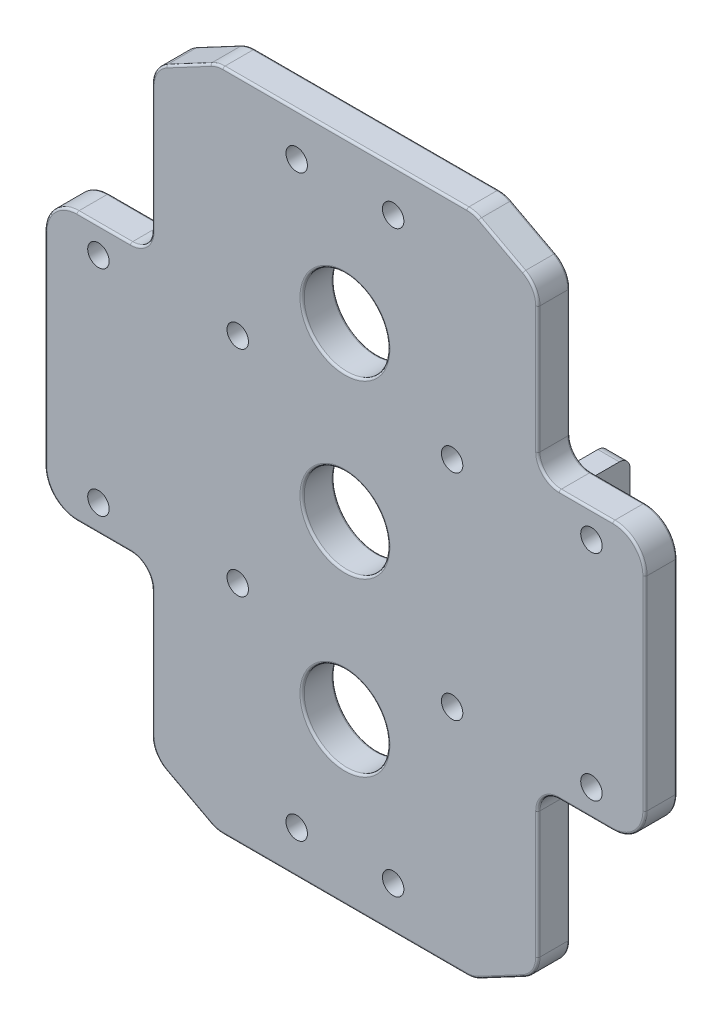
ISO-10303-21;
HEADER;
FILE_DESCRIPTION(('STEP AP214'),'2;1');
FILE_NAME('part.step','',(''),(''),'','','');
FILE_SCHEMA(('AUTOMOTIVE_DESIGN { 1 0 10303 214 1 1 1 1 }'));
ENDSEC;
DATA;
#1=APPLICATION_CONTEXT('core data for automotive mechanical design processes');
#2=APPLICATION_PROTOCOL_DEFINITION('international standard','automotive_design',2000,#1);
#3=PRODUCT_CONTEXT('',#1,'mechanical');
#4=PRODUCT('Part','Part','',(#3));
#5=PRODUCT_RELATED_PRODUCT_CATEGORY('part','',(#4));
#6=PRODUCT_DEFINITION_FORMATION('','',#4);
#7=PRODUCT_DEFINITION_CONTEXT('part definition',#1,'design');
#8=PRODUCT_DEFINITION('design','',#6,#7);
#9=PRODUCT_DEFINITION_SHAPE('','',#8);
#10=(LENGTH_UNIT() NAMED_UNIT(*) SI_UNIT(.MILLI.,.METRE.));
#11=(NAMED_UNIT(*) PLANE_ANGLE_UNIT() SI_UNIT($,.RADIAN.));
#12=(NAMED_UNIT(*) SI_UNIT($,.STERADIAN.) SOLID_ANGLE_UNIT());
#13=UNCERTAINTY_MEASURE_WITH_UNIT(LENGTH_MEASURE(1.E-05),#10,'distance_accuracy_value','');
#14=(GEOMETRIC_REPRESENTATION_CONTEXT(3) GLOBAL_UNCERTAINTY_ASSIGNED_CONTEXT((#13)) GLOBAL_UNIT_ASSIGNED_CONTEXT((#10,
#11,#12)) REPRESENTATION_CONTEXT('',''));
#15=CARTESIAN_POINT('',(0.,0.,0.));
#16=DIRECTION('',(0.,0.,1.));
#17=DIRECTION('',(1.,0.,0.));
#18=AXIS2_PLACEMENT_3D('',#15,#16,#17);
#19=CARTESIAN_POINT('',(0.,0.,0.));
#20=DIRECTION('',(0.,0.,1.));
#21=DIRECTION('',(1.,0.,0.));
#22=AXIS2_PLACEMENT_3D('',#19,#20,#21);
#23=PLANE('',#22);
#24=CARTESIAN_POINT('',(0.,16.,0.));
#25=DIRECTION('',(0.,0.,1.));
#26=DIRECTION('',(1.,0.,0.));
#27=AXIS2_PLACEMENT_3D('',#24,#25,#26);
#28=CIRCLE('',#27,4.2);
#29=CARTESIAN_POINT('',(4.2,16.,0.));
#30=VERTEX_POINT('',#29);
#31=EDGE_CURVE('E1458',#30,#30,#28,.T.);
#32=ORIENTED_EDGE('',*,*,#31,.T.);
#33=EDGE_LOOP('',(#32));
#34=FACE_BOUND('',#33,.T.);
#35=CARTESIAN_POINT('',(0.,0.,0.));
#36=DIRECTION('',(0.,0.,1.));
#37=DIRECTION('',(1.,0.,0.));
#38=AXIS2_PLACEMENT_3D('',#35,#36,#37);
#39=CIRCLE('',#38,4.2);
#40=CARTESIAN_POINT('',(4.20000000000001,0.,0.));
#41=VERTEX_POINT('',#40);
#42=EDGE_CURVE('E1455',#41,#41,#39,.T.);
#43=ORIENTED_EDGE('',*,*,#42,.T.);
#44=EDGE_LOOP('',(#43));
#45=FACE_BOUND('',#44,.T.);
#46=CARTESIAN_POINT('',(0.,-16.,0.));
#47=DIRECTION('',(0.,0.,1.));
#48=DIRECTION('',(1.,0.,0.));
#49=AXIS2_PLACEMENT_3D('',#46,#47,#48);
#50=CIRCLE('',#49,4.2);
#51=CARTESIAN_POINT('',(4.2,-16.,0.));
#52=VERTEX_POINT('',#51);
#53=EDGE_CURVE('E1452',#52,#52,#50,.T.);
#54=ORIENTED_EDGE('',*,*,#53,.T.);
#55=EDGE_LOOP('',(#54));
#56=FACE_BOUND('',#55,.T.);
#57=DIRECTION('',(-1.,0.,0.));
#58=VECTOR('',#57,1.);
#59=CARTESIAN_POINT('',(0.,30.8,0.));
#60=LINE('',#59,#58);
#61=CARTESIAN_POINT('',(-11.376679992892,30.8,0.));
#62=VERTEX_POINT('',#61);
#63=CARTESIAN_POINT('',(11.376679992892,30.8,0.));
#64=VERTEX_POINT('',#63);
#65=EDGE_CURVE('E1389',#62,#64,#60,.F.);
#66=ORIENTED_EDGE('',*,*,#65,.T.);
#67=CARTESIAN_POINT('',(11.376679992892,28.5,0.));
#68=DIRECTION('',(0.,0.,1.));
#69=DIRECTION('',(1.,0.,0.));
#70=AXIS2_PLACEMENT_3D('',#67,#68,#69);
#71=CIRCLE('',#70,2.3);
#72=CARTESIAN_POINT('',(12.4564645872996,30.5307794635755,0.));
#73=VERTEX_POINT('',#72);
#74=EDGE_CURVE('E1450',#64,#73,#71,.F.);
#75=ORIENTED_EDGE('',*,*,#74,.T.);
#76=DIRECTION('',(-0.882947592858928,0.469471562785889,0.));
#77=VECTOR('',#76,1.);
#78=CARTESIAN_POINT('',(16.5797845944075,28.3383713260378,0.));
#79=LINE('',#78,#77);
#80=CARTESIAN_POINT('',(16.5797845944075,28.3383713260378,0.));
#81=VERTEX_POINT('',#80);
#82=EDGE_CURVE('E61',#73,#81,#79,.F.);
#83=ORIENTED_EDGE('',*,*,#82,.T.);
#84=CARTESIAN_POINT('',(15.5,26.3075918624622,0.));
#85=DIRECTION('',(0.,0.,1.));
#86=DIRECTION('',(1.,0.,0.));
#87=AXIS2_PLACEMENT_3D('',#84,#85,#86);
#88=CIRCLE('',#87,2.3);
#89=CARTESIAN_POINT('',(17.8,26.3075918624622,0.));
#90=VERTEX_POINT('',#89);
#91=EDGE_CURVE('E1447',#81,#90,#88,.F.);
#92=ORIENTED_EDGE('',*,*,#91,.T.);
#93=DIRECTION('',(0.,-1.,0.));
#94=VECTOR('',#93,1.);
#95=CARTESIAN_POINT('',(17.8,0.,0.));
#96=LINE('',#95,#94);
#97=CARTESIAN_POINT('',(17.8,14.5,0.));
#98=VERTEX_POINT('',#97);
#99=EDGE_CURVE('E1445',#90,#98,#96,.T.);
#100=ORIENTED_EDGE('',*,*,#99,.T.);
#101=CARTESIAN_POINT('',(20.,14.5,0.));
#102=DIRECTION('',(0.,0.,1.));
#103=DIRECTION('',(1.,0.,0.));
#104=AXIS2_PLACEMENT_3D('',#101,#102,#103);
#105=CIRCLE('',#104,2.2);
#106=CARTESIAN_POINT('',(20.,12.3,0.));
#107=VERTEX_POINT('',#106);
#108=EDGE_CURVE('E1443',#98,#107,#105,.T.);
#109=ORIENTED_EDGE('',*,*,#108,.T.);
#110=DIRECTION('',(1.,0.,0.));
#111=VECTOR('',#110,1.);
#112=CARTESIAN_POINT('',(0.,12.3,0.));
#113=LINE('',#112,#111);
#114=CARTESIAN_POINT('',(25.,12.3,0.));
#115=VERTEX_POINT('',#114);
#116=EDGE_CURVE('E1441',#107,#115,#113,.T.);
#117=ORIENTED_EDGE('',*,*,#116,.T.);
#118=CARTESIAN_POINT('',(25.,9.5,0.));
#119=DIRECTION('',(0.,0.,1.));
#120=DIRECTION('',(1.,0.,0.));
#121=AXIS2_PLACEMENT_3D('',#118,#119,#120);
#122=CIRCLE('',#121,2.8);
#123=CARTESIAN_POINT('',(27.8,9.5,0.));
#124=VERTEX_POINT('',#123);
#125=EDGE_CURVE('E1439',#115,#124,#122,.F.);
#126=ORIENTED_EDGE('',*,*,#125,.T.);
#127=DIRECTION('',(0.,1.,0.));
#128=VECTOR('',#127,1.);
#129=CARTESIAN_POINT('',(27.8,0.,0.));
#130=LINE('',#129,#128);
#131=CARTESIAN_POINT('',(27.8,-9.50000000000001,0.));
#132=VERTEX_POINT('',#131);
#133=EDGE_CURVE('E1437',#124,#132,#130,.F.);
#134=ORIENTED_EDGE('',*,*,#133,.T.);
#135=CARTESIAN_POINT('',(25.,-9.50000000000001,0.));
#136=DIRECTION('',(0.,0.,1.));
#137=DIRECTION('',(1.,0.,0.));
#138=AXIS2_PLACEMENT_3D('',#135,#136,#137);
#139=CIRCLE('',#138,2.8);
#140=CARTESIAN_POINT('',(25.,-12.3,0.));
#141=VERTEX_POINT('',#140);
#142=EDGE_CURVE('E1435',#132,#141,#139,.F.);
#143=ORIENTED_EDGE('',*,*,#142,.T.);
#144=DIRECTION('',(-1.,0.,0.));
#145=VECTOR('',#144,1.);
#146=CARTESIAN_POINT('',(0.,-12.3,0.));
#147=LINE('',#146,#145);
#148=CARTESIAN_POINT('',(20.,-12.3,0.));
#149=VERTEX_POINT('',#148);
#150=EDGE_CURVE('E1433',#141,#149,#147,.T.);
#151=ORIENTED_EDGE('',*,*,#150,.T.);
#152=CARTESIAN_POINT('',(20.,-14.5,0.));
#153=DIRECTION('',(0.,0.,1.));
#154=DIRECTION('',(1.,0.,0.));
#155=AXIS2_PLACEMENT_3D('',#152,#153,#154);
#156=CIRCLE('',#155,2.2);
#157=CARTESIAN_POINT('',(17.8,-14.5,0.));
#158=VERTEX_POINT('',#157);
#159=EDGE_CURVE('E1431',#149,#158,#156,.T.);
#160=ORIENTED_EDGE('',*,*,#159,.T.);
#161=DIRECTION('',(0.,-1.,0.));
#162=VECTOR('',#161,1.);
#163=CARTESIAN_POINT('',(17.8,0.,0.));
#164=LINE('',#163,#162);
#165=CARTESIAN_POINT('',(17.8,-26.3075918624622,0.));
#166=VERTEX_POINT('',#165);
#167=EDGE_CURVE('E1429',#158,#166,#164,.T.);
#168=ORIENTED_EDGE('',*,*,#167,.T.);
#169=CARTESIAN_POINT('',(15.5,-26.3075918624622,0.));
#170=DIRECTION('',(0.,0.,1.));
#171=DIRECTION('',(1.,0.,0.));
#172=AXIS2_PLACEMENT_3D('',#169,#170,#171);
#173=CIRCLE('',#172,2.3);
#174=CARTESIAN_POINT('',(16.5797845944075,-28.3383713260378,0.));
#175=VERTEX_POINT('',#174);
#176=EDGE_CURVE('E1427',#166,#175,#173,.F.);
#177=ORIENTED_EDGE('',*,*,#176,.T.);
#178=DIRECTION('',(0.882947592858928,0.469471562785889,0.));
#179=VECTOR('',#178,1.);
#180=CARTESIAN_POINT('',(12.4564645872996,-30.5307794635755,0.));
#181=LINE('',#180,#179);
#182=CARTESIAN_POINT('',(12.4564645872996,-30.5307794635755,0.));
#183=VERTEX_POINT('',#182);
#184=EDGE_CURVE('E1425',#175,#183,#181,.F.);
#185=ORIENTED_EDGE('',*,*,#184,.T.);
#186=CARTESIAN_POINT('',(11.376679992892,-28.5,0.));
#187=DIRECTION('',(0.,0.,1.));
#188=DIRECTION('',(1.,0.,0.));
#189=AXIS2_PLACEMENT_3D('',#186,#187,#188);
#190=CIRCLE('',#189,2.3);
#191=CARTESIAN_POINT('',(11.376679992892,-30.8,0.));
#192=VERTEX_POINT('',#191);
#193=EDGE_CURVE('E1423',#183,#192,#190,.F.);
#194=ORIENTED_EDGE('',*,*,#193,.T.);
#195=DIRECTION('',(1.,0.,0.));
#196=VECTOR('',#195,1.);
#197=CARTESIAN_POINT('',(0.,-30.8,0.));
#198=LINE('',#197,#196);
#199=CARTESIAN_POINT('',(-11.376679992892,-30.8,0.));
#200=VERTEX_POINT('',#199);
#201=EDGE_CURVE('E1421',#192,#200,#198,.F.);
#202=ORIENTED_EDGE('',*,*,#201,.T.);
#203=CARTESIAN_POINT('',(-11.376679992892,-28.5,0.));
#204=DIRECTION('',(0.,0.,1.));
#205=DIRECTION('',(1.,0.,0.));
#206=AXIS2_PLACEMENT_3D('',#203,#204,#205);
#207=CIRCLE('',#206,2.3);
#208=CARTESIAN_POINT('',(-12.4564645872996,-30.5307794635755,0.));
#209=VERTEX_POINT('',#208);
#210=EDGE_CURVE('E1419',#200,#209,#207,.F.);
#211=ORIENTED_EDGE('',*,*,#210,.T.);
#212=DIRECTION('',(0.882947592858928,-0.469471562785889,0.));
#213=VECTOR('',#212,1.);
#214=CARTESIAN_POINT('',(-16.5797845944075,-28.3383713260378,0.));
#215=LINE('',#214,#213);
#216=CARTESIAN_POINT('',(-16.5797845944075,-28.3383713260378,0.));
#217=VERTEX_POINT('',#216);
#218=EDGE_CURVE('E1417',#209,#217,#215,.F.);
#219=ORIENTED_EDGE('',*,*,#218,.T.);
#220=CARTESIAN_POINT('',(-15.5,-26.3075918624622,0.));
#221=DIRECTION('',(0.,0.,1.));
#222=DIRECTION('',(1.,0.,0.));
#223=AXIS2_PLACEMENT_3D('',#220,#221,#222);
#224=CIRCLE('',#223,2.3);
#225=CARTESIAN_POINT('',(-17.8,-26.3075918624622,0.));
#226=VERTEX_POINT('',#225);
#227=EDGE_CURVE('E1415',#217,#226,#224,.F.);
#228=ORIENTED_EDGE('',*,*,#227,.T.);
#229=DIRECTION('',(0.,1.,0.));
#230=VECTOR('',#229,1.);
#231=CARTESIAN_POINT('',(-17.8,0.,0.));
#232=LINE('',#231,#230);
#233=CARTESIAN_POINT('',(-17.8,-14.5,0.));
#234=VERTEX_POINT('',#233);
#235=EDGE_CURVE('E1413',#226,#234,#232,.T.);
#236=ORIENTED_EDGE('',*,*,#235,.T.);
#237=CARTESIAN_POINT('',(-20.,-14.5,0.));
#238=DIRECTION('',(0.,0.,1.));
#239=DIRECTION('',(1.,0.,0.));
#240=AXIS2_PLACEMENT_3D('',#237,#238,#239);
#241=CIRCLE('',#240,2.2);
#242=CARTESIAN_POINT('',(-20.,-12.3,0.));
#243=VERTEX_POINT('',#242);
#244=EDGE_CURVE('E1411',#234,#243,#241,.T.);
#245=ORIENTED_EDGE('',*,*,#244,.T.);
#246=DIRECTION('',(-1.,0.,0.));
#247=VECTOR('',#246,1.);
#248=CARTESIAN_POINT('',(0.,-12.3,0.));
#249=LINE('',#248,#247);
#250=CARTESIAN_POINT('',(-25.,-12.3,0.));
#251=VERTEX_POINT('',#250);
#252=EDGE_CURVE('E1409',#243,#251,#249,.T.);
#253=ORIENTED_EDGE('',*,*,#252,.T.);
#254=CARTESIAN_POINT('',(-25.,-9.50000000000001,0.));
#255=DIRECTION('',(0.,0.,1.));
#256=DIRECTION('',(1.,0.,0.));
#257=AXIS2_PLACEMENT_3D('',#254,#255,#256);
#258=CIRCLE('',#257,2.8);
#259=CARTESIAN_POINT('',(-27.8,-9.50000000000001,0.));
#260=VERTEX_POINT('',#259);
#261=EDGE_CURVE('E1407',#251,#260,#258,.F.);
#262=ORIENTED_EDGE('',*,*,#261,.T.);
#263=DIRECTION('',(0.,-1.,0.));
#264=VECTOR('',#263,1.);
#265=CARTESIAN_POINT('',(-27.8,0.,0.));
#266=LINE('',#265,#264);
#267=CARTESIAN_POINT('',(-27.8,9.5,0.));
#268=VERTEX_POINT('',#267);
#269=EDGE_CURVE('E1405',#260,#268,#266,.F.);
#270=ORIENTED_EDGE('',*,*,#269,.T.);
#271=CARTESIAN_POINT('',(-25.,9.5,0.));
#272=DIRECTION('',(0.,0.,1.));
#273=DIRECTION('',(1.,0.,0.));
#274=AXIS2_PLACEMENT_3D('',#271,#272,#273);
#275=CIRCLE('',#274,2.8);
#276=CARTESIAN_POINT('',(-25.,12.3,0.));
#277=VERTEX_POINT('',#276);
#278=EDGE_CURVE('E1403',#268,#277,#275,.F.);
#279=ORIENTED_EDGE('',*,*,#278,.T.);
#280=DIRECTION('',(1.,0.,0.));
#281=VECTOR('',#280,1.);
#282=CARTESIAN_POINT('',(0.,12.3,0.));
#283=LINE('',#282,#281);
#284=CARTESIAN_POINT('',(-20.,12.3,0.));
#285=VERTEX_POINT('',#284);
#286=EDGE_CURVE('E1401',#277,#285,#283,.T.);
#287=ORIENTED_EDGE('',*,*,#286,.T.);
#288=CARTESIAN_POINT('',(-20.,14.5,0.));
#289=DIRECTION('',(0.,0.,1.));
#290=DIRECTION('',(1.,0.,0.));
#291=AXIS2_PLACEMENT_3D('',#288,#289,#290);
#292=CIRCLE('',#291,2.2);
#293=CARTESIAN_POINT('',(-17.8,14.5,0.));
#294=VERTEX_POINT('',#293);
#295=EDGE_CURVE('E1399',#285,#294,#292,.T.);
#296=ORIENTED_EDGE('',*,*,#295,.T.);
#297=DIRECTION('',(0.,1.,0.));
#298=VECTOR('',#297,1.);
#299=CARTESIAN_POINT('',(-17.8,0.,0.));
#300=LINE('',#299,#298);
#301=CARTESIAN_POINT('',(-17.8,26.3075918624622,0.));
#302=VERTEX_POINT('',#301);
#303=EDGE_CURVE('E1397',#294,#302,#300,.T.);
#304=ORIENTED_EDGE('',*,*,#303,.T.);
#305=CARTESIAN_POINT('',(-15.5,26.3075918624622,0.));
#306=DIRECTION('',(0.,0.,1.));
#307=DIRECTION('',(1.,0.,0.));
#308=AXIS2_PLACEMENT_3D('',#305,#306,#307);
#309=CIRCLE('',#308,2.3);
#310=CARTESIAN_POINT('',(-16.5797845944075,28.3383713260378,0.));
#311=VERTEX_POINT('',#310);
#312=EDGE_CURVE('E1395',#302,#311,#309,.F.);
#313=ORIENTED_EDGE('',*,*,#312,.T.);
#314=DIRECTION('',(-0.882947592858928,-0.469471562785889,0.));
#315=VECTOR('',#314,1.);
#316=CARTESIAN_POINT('',(-12.4564645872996,30.5307794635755,0.));
#317=LINE('',#316,#315);
#318=CARTESIAN_POINT('',(-12.4564645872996,30.5307794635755,0.));
#319=VERTEX_POINT('',#318);
#320=EDGE_CURVE('E1393',#311,#319,#317,.F.);
#321=ORIENTED_EDGE('',*,*,#320,.T.);
#322=CARTESIAN_POINT('',(-11.376679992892,28.5,0.));
#323=DIRECTION('',(0.,0.,1.));
#324=DIRECTION('',(1.,0.,0.));
#325=AXIS2_PLACEMENT_3D('',#322,#323,#324);
#326=CIRCLE('',#325,2.3);
#327=EDGE_CURVE('E1391',#319,#62,#326,.F.);
#328=ORIENTED_EDGE('',*,*,#327,.T.);
#329=EDGE_LOOP('',(#66,#75,#83,#92,#100,#109,#117,#126,#134,#143,#151,#160,#168,#177,#185,#194,
#202,#211,#219,#228,#236,#245,#253,#262,#270,#279,#287,#296,#304,#313,#321,#328));
#330=FACE_BOUND('',#329,.T.);
#331=DIRECTION('',(0.,1.,0.));
#332=VECTOR('',#331,1.);
#333=CARTESIAN_POINT('',(-19.2,-11.,0.));
#334=LINE('',#333,#332);
#335=CARTESIAN_POINT('',(-19.2,11.2,0.));
#336=VERTEX_POINT('',#335);
#337=CARTESIAN_POINT('',(-19.2,-11.2,0.));
#338=VERTEX_POINT('',#337);
#339=EDGE_CURVE('E951',#336,#338,#334,.F.);
#340=ORIENTED_EDGE('',*,*,#339,.T.);
#341=DIRECTION('',(-1.,0.,0.));
#342=VECTOR('',#341,1.);
#343=CARTESIAN_POINT('',(-17.,-11.2,0.));
#344=LINE('',#343,#342);
#345=CARTESIAN_POINT('',(-16.8,-11.2,0.));
#346=VERTEX_POINT('',#345);
#347=EDGE_CURVE('E957',#338,#346,#344,.F.);
#348=ORIENTED_EDGE('',*,*,#347,.T.);
#349=DIRECTION('',(0.,-1.,0.));
#350=VECTOR('',#349,1.);
#351=CARTESIAN_POINT('',(-16.8,11.,0.));
#352=LINE('',#351,#350);
#353=CARTESIAN_POINT('',(-16.8,11.2,0.));
#354=VERTEX_POINT('',#353);
#355=EDGE_CURVE('E955',#346,#354,#352,.F.);
#356=ORIENTED_EDGE('',*,*,#355,.T.);
#357=DIRECTION('',(1.,0.,0.));
#358=VECTOR('',#357,1.);
#359=CARTESIAN_POINT('',(-19.,11.2,0.));
#360=LINE('',#359,#358);
#361=EDGE_CURVE('E953',#354,#336,#360,.F.);
#362=ORIENTED_EDGE('',*,*,#361,.T.);
#363=EDGE_LOOP('',(#340,#348,#356,#362));
#364=FACE_BOUND('',#363,.T.);
#365=DIRECTION('',(1.,0.,0.));
#366=VECTOR('',#365,1.);
#367=CARTESIAN_POINT('',(17.,11.2,0.));
#368=LINE('',#367,#366);
#369=CARTESIAN_POINT('',(19.2,11.2,0.));
#370=VERTEX_POINT('',#369);
#371=CARTESIAN_POINT('',(16.8,11.2,0.));
#372=VERTEX_POINT('',#371);
#373=EDGE_CURVE('E942',#370,#372,#368,.F.);
#374=ORIENTED_EDGE('',*,*,#373,.T.);
#375=DIRECTION('',(0.,1.,0.));
#376=VECTOR('',#375,1.);
#377=CARTESIAN_POINT('',(16.8,-11.,0.));
#378=LINE('',#377,#376);
#379=CARTESIAN_POINT('',(16.8,-11.2,0.));
#380=VERTEX_POINT('',#379);
#381=EDGE_CURVE('E948',#372,#380,#378,.F.);
#382=ORIENTED_EDGE('',*,*,#381,.T.);
#383=DIRECTION('',(-1.,0.,0.));
#384=VECTOR('',#383,1.);
#385=CARTESIAN_POINT('',(19.,-11.2,0.));
#386=LINE('',#385,#384);
#387=CARTESIAN_POINT('',(19.2,-11.2,0.));
#388=VERTEX_POINT('',#387);
#389=EDGE_CURVE('E946',#380,#388,#386,.F.);
#390=ORIENTED_EDGE('',*,*,#389,.T.);
#391=DIRECTION('',(0.,-1.,0.));
#392=VECTOR('',#391,1.);
#393=CARTESIAN_POINT('',(19.2,11.,0.));
#394=LINE('',#393,#392);
#395=EDGE_CURVE('E944',#388,#370,#394,.F.);
#396=ORIENTED_EDGE('',*,*,#395,.T.);
#397=EDGE_LOOP('',(#374,#382,#390,#396));
#398=FACE_BOUND('',#397,.T.);
#399=CARTESIAN_POINT('',(-23.,-10.,0.));
#400=DIRECTION('',(0.,0.,1.));
#401=DIRECTION('',(-1.,0.,0.));
#402=AXIS2_PLACEMENT_3D('',#399,#400,#401);
#403=CIRCLE('',#402,1.);
#404=CARTESIAN_POINT('',(-24.,-10.,0.));
#405=VERTEX_POINT('',#404);
#406=EDGE_CURVE('E862',#405,#405,#403,.T.);
#407=ORIENTED_EDGE('',*,*,#406,.T.);
#408=EDGE_LOOP('',(#407));
#409=FACE_BOUND('',#408,.T.);
#410=CARTESIAN_POINT('',(-23.,10.,0.));
#411=DIRECTION('',(0.,0.,1.));
#412=DIRECTION('',(1.,0.,0.));
#413=AXIS2_PLACEMENT_3D('',#410,#411,#412);
#414=CIRCLE('',#413,1.);
#415=CARTESIAN_POINT('',(-22.,10.,0.));
#416=VERTEX_POINT('',#415);
#417=EDGE_CURVE('E856',#416,#416,#414,.T.);
#418=ORIENTED_EDGE('',*,*,#417,.T.);
#419=EDGE_LOOP('',(#418));
#420=FACE_BOUND('',#419,.T.);
#421=CARTESIAN_POINT('',(23.,10.,0.));
#422=DIRECTION('',(0.,0.,1.));
#423=DIRECTION('',(-1.,0.,0.));
#424=AXIS2_PLACEMENT_3D('',#421,#422,#423);
#425=CIRCLE('',#424,1.);
#426=CARTESIAN_POINT('',(22.,10.,0.));
#427=VERTEX_POINT('',#426);
#428=EDGE_CURVE('E850',#427,#427,#425,.T.);
#429=ORIENTED_EDGE('',*,*,#428,.T.);
#430=EDGE_LOOP('',(#429));
#431=FACE_BOUND('',#430,.T.);
#432=CARTESIAN_POINT('',(23.,-10.,0.));
#433=DIRECTION('',(0.,0.,1.));
#434=DIRECTION('',(1.,0.,0.));
#435=AXIS2_PLACEMENT_3D('',#432,#433,#434);
#436=CIRCLE('',#435,1.);
#437=CARTESIAN_POINT('',(24.,-10.,0.));
#438=VERTEX_POINT('',#437);
#439=EDGE_CURVE('E843',#438,#438,#436,.T.);
#440=ORIENTED_EDGE('',*,*,#439,.T.);
#441=EDGE_LOOP('',(#440));
#442=FACE_BOUND('',#441,.T.);
#443=CARTESIAN_POINT('',(-4.49999999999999,-27.,0.));
#444=DIRECTION('',(0.,0.,1.));
#445=DIRECTION('',(-1.,0.,0.));
#446=AXIS2_PLACEMENT_3D('',#443,#444,#445);
#447=CIRCLE('',#446,1.);
#448=CARTESIAN_POINT('',(-5.49999999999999,-27.,0.));
#449=VERTEX_POINT('',#448);
#450=EDGE_CURVE('E814',#449,#449,#447,.T.);
#451=ORIENTED_EDGE('',*,*,#450,.T.);
#452=EDGE_LOOP('',(#451));
#453=FACE_BOUND('',#452,.T.);
#454=CARTESIAN_POINT('',(4.50000000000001,-27.,0.));
#455=DIRECTION('',(0.,0.,1.));
#456=DIRECTION('',(-1.,0.,0.));
#457=AXIS2_PLACEMENT_3D('',#454,#455,#456);
#458=CIRCLE('',#457,1.);
#459=CARTESIAN_POINT('',(3.50000000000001,-27.,0.));
#460=VERTEX_POINT('',#459);
#461=EDGE_CURVE('E808',#460,#460,#458,.T.);
#462=ORIENTED_EDGE('',*,*,#461,.T.);
#463=EDGE_LOOP('',(#462));
#464=FACE_BOUND('',#463,.T.);
#465=CARTESIAN_POINT('',(4.5,27.,0.));
#466=DIRECTION('',(0.,0.,1.));
#467=DIRECTION('',(1.,0.,0.));
#468=AXIS2_PLACEMENT_3D('',#465,#466,#467);
#469=CIRCLE('',#468,1.);
#470=CARTESIAN_POINT('',(5.5,27.,0.));
#471=VERTEX_POINT('',#470);
#472=EDGE_CURVE('E802',#471,#471,#469,.T.);
#473=ORIENTED_EDGE('',*,*,#472,.T.);
#474=EDGE_LOOP('',(#473));
#475=FACE_BOUND('',#474,.T.);
#476=CARTESIAN_POINT('',(-4.5,27.,0.));
#477=DIRECTION('',(0.,0.,1.));
#478=DIRECTION('',(1.,0.,0.));
#479=AXIS2_PLACEMENT_3D('',#476,#477,#478);
#480=CIRCLE('',#479,1.);
#481=CARTESIAN_POINT('',(-3.5,27.,0.));
#482=VERTEX_POINT('',#481);
#483=EDGE_CURVE('E795',#482,#482,#480,.T.);
#484=ORIENTED_EDGE('',*,*,#483,.T.);
#485=EDGE_LOOP('',(#484));
#486=FACE_BOUND('',#485,.T.);
#487=CARTESIAN_POINT('',(-10.,-10.,0.));
#488=DIRECTION('',(0.,0.,1.));
#489=DIRECTION('',(-1.,0.,0.));
#490=AXIS2_PLACEMENT_3D('',#487,#488,#489);
#491=CIRCLE('',#490,1.);
#492=CARTESIAN_POINT('',(-11.,-10.,0.));
#493=VERTEX_POINT('',#492);
#494=EDGE_CURVE('E838',#493,#493,#491,.T.);
#495=ORIENTED_EDGE('',*,*,#494,.T.);
#496=EDGE_LOOP('',(#495));
#497=FACE_BOUND('',#496,.T.);
#498=CARTESIAN_POINT('',(-10.,10.,0.));
#499=DIRECTION('',(0.,0.,1.));
#500=DIRECTION('',(1.,0.,0.));
#501=AXIS2_PLACEMENT_3D('',#498,#499,#500);
#502=CIRCLE('',#501,1.);
#503=CARTESIAN_POINT('',(-9.00000000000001,10.,0.));
#504=VERTEX_POINT('',#503);
#505=EDGE_CURVE('E832',#504,#504,#502,.T.);
#506=ORIENTED_EDGE('',*,*,#505,.T.);
#507=EDGE_LOOP('',(#506));
#508=FACE_BOUND('',#507,.T.);
#509=CARTESIAN_POINT('',(10.,10.,0.));
#510=DIRECTION('',(0.,0.,1.));
#511=DIRECTION('',(-1.,0.,0.));
#512=AXIS2_PLACEMENT_3D('',#509,#510,#511);
#513=CIRCLE('',#512,1.);
#514=CARTESIAN_POINT('',(9.00000000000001,10.,0.));
#515=VERTEX_POINT('',#514);
#516=EDGE_CURVE('E826',#515,#515,#513,.T.);
#517=ORIENTED_EDGE('',*,*,#516,.T.);
#518=EDGE_LOOP('',(#517));
#519=FACE_BOUND('',#518,.T.);
#520=CARTESIAN_POINT('',(10.,-10.,0.));
#521=DIRECTION('',(0.,0.,1.));
#522=DIRECTION('',(1.,0.,0.));
#523=AXIS2_PLACEMENT_3D('',#520,#521,#522);
#524=CIRCLE('',#523,1.);
#525=CARTESIAN_POINT('',(11.,-10.,0.));
#526=VERTEX_POINT('',#525);
#527=EDGE_CURVE('E819',#526,#526,#524,.T.);
#528=ORIENTED_EDGE('',*,*,#527,.T.);
#529=EDGE_LOOP('',(#528));
#530=FACE_BOUND('',#529,.T.);
#531=ADVANCED_FACE('F37',(#34,#45,#56,#330,#364,#398,#409,#420,#431,#442,#453,#464,#475,#486,
#497,#508,#519,#530),#23,.F.);
#532=CARTESIAN_POINT('',(0.,0.,3.));
#533=DIRECTION('',(0.,0.,1.));
#534=DIRECTION('',(1.,0.,0.));
#535=AXIS2_PLACEMENT_3D('',#532,#533,#534);
#536=PLANE('',#535);
#537=CARTESIAN_POINT('',(0.,16.,3.));
#538=DIRECTION('',(0.,0.,1.));
#539=DIRECTION('',(1.,0.,0.));
#540=AXIS2_PLACEMENT_3D('',#537,#538,#539);
#541=CIRCLE('',#540,4.2);
#542=CARTESIAN_POINT('',(4.2,16.,3.));
#543=VERTEX_POINT('',#542);
#544=EDGE_CURVE('E1260',#543,#543,#541,.F.);
#545=ORIENTED_EDGE('',*,*,#544,.T.);
#546=EDGE_LOOP('',(#545));
#547=FACE_BOUND('',#546,.T.);
#548=CARTESIAN_POINT('',(0.,0.,3.));
#549=DIRECTION('',(0.,0.,1.));
#550=DIRECTION('',(1.,0.,0.));
#551=AXIS2_PLACEMENT_3D('',#548,#549,#550);
#552=CIRCLE('',#551,4.2);
#553=CARTESIAN_POINT('',(4.20000000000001,0.,3.));
#554=VERTEX_POINT('',#553);
#555=EDGE_CURVE('E1257',#554,#554,#552,.F.);
#556=ORIENTED_EDGE('',*,*,#555,.T.);
#557=EDGE_LOOP('',(#556));
#558=FACE_BOUND('',#557,.T.);
#559=CARTESIAN_POINT('',(0.,-16.,3.));
#560=DIRECTION('',(0.,0.,1.));
#561=DIRECTION('',(1.,0.,0.));
#562=AXIS2_PLACEMENT_3D('',#559,#560,#561);
#563=CIRCLE('',#562,4.2);
#564=CARTESIAN_POINT('',(4.2,-16.,3.));
#565=VERTEX_POINT('',#564);
#566=EDGE_CURVE('E1254',#565,#565,#563,.F.);
#567=ORIENTED_EDGE('',*,*,#566,.T.);
#568=EDGE_LOOP('',(#567));
#569=FACE_BOUND('',#568,.T.);
#570=DIRECTION('',(0.882947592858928,-0.469471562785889,0.));
#571=VECTOR('',#570,1.);
#572=CARTESIAN_POINT('',(15.4010306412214,28.9651259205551,3.));
#573=LINE('',#572,#571);
#574=CARTESIAN_POINT('',(16.5797845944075,28.3383713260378,3.));
#575=VERTEX_POINT('',#574);
#576=CARTESIAN_POINT('',(12.4564645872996,30.5307794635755,3.));
#577=VERTEX_POINT('',#576);
#578=EDGE_CURVE('E1249',#575,#577,#573,.F.);
#579=ORIENTED_EDGE('',*,*,#578,.T.);
#580=CARTESIAN_POINT('',(11.376679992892,28.5,3.));
#581=DIRECTION('',(0.,0.,1.));
#582=DIRECTION('',(1.,0.,0.));
#583=AXIS2_PLACEMENT_3D('',#580,#581,#582);
#584=CIRCLE('',#583,2.3);
#585=CARTESIAN_POINT('',(11.376679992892,30.8,3.));
#586=VERTEX_POINT('',#585);
#587=EDGE_CURVE('E1251',#577,#586,#584,.T.);
#588=ORIENTED_EDGE('',*,*,#587,.T.);
#589=DIRECTION('',(-1.,0.,0.));
#590=VECTOR('',#589,1.);
#591=CARTESIAN_POINT('',(-11.376679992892,30.8,3.));
#592=LINE('',#591,#590);
#593=CARTESIAN_POINT('',(-11.376679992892,30.8,3.));
#594=VERTEX_POINT('',#593);
#595=EDGE_CURVE('E1189',#586,#594,#592,.T.);
#596=ORIENTED_EDGE('',*,*,#595,.T.);
#597=CARTESIAN_POINT('',(-11.376679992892,28.5,3.));
#598=DIRECTION('',(0.,0.,1.));
#599=DIRECTION('',(1.,0.,0.));
#600=AXIS2_PLACEMENT_3D('',#597,#598,#599);
#601=CIRCLE('',#600,2.3);
#602=CARTESIAN_POINT('',(-12.4564645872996,30.5307794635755,3.));
#603=VERTEX_POINT('',#602);
#604=EDGE_CURVE('E1191',#594,#603,#601,.T.);
#605=ORIENTED_EDGE('',*,*,#604,.T.);
#606=DIRECTION('',(0.882947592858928,0.469471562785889,0.));
#607=VECTOR('',#606,1.);
#608=CARTESIAN_POINT('',(-15.4010306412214,28.9651259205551,3.));
#609=LINE('',#608,#607);
#610=CARTESIAN_POINT('',(-16.5797845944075,28.3383713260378,3.));
#611=VERTEX_POINT('',#610);
#612=EDGE_CURVE('E1193',#603,#611,#609,.F.);
#613=ORIENTED_EDGE('',*,*,#612,.T.);
#614=CARTESIAN_POINT('',(-15.5,26.3075918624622,3.));
#615=DIRECTION('',(0.,0.,1.));
#616=DIRECTION('',(1.,0.,0.));
#617=AXIS2_PLACEMENT_3D('',#614,#615,#616);
#618=CIRCLE('',#617,2.3);
#619=CARTESIAN_POINT('',(-17.8,26.3075918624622,3.));
#620=VERTEX_POINT('',#619);
#621=EDGE_CURVE('E1195',#611,#620,#618,.T.);
#622=ORIENTED_EDGE('',*,*,#621,.T.);
#623=DIRECTION('',(0.,1.,0.));
#624=VECTOR('',#623,1.);
#625=CARTESIAN_POINT('',(-17.8,14.5,3.));
#626=LINE('',#625,#624);
#627=CARTESIAN_POINT('',(-17.8,14.5,3.));
#628=VERTEX_POINT('',#627);
#629=EDGE_CURVE('E1197',#620,#628,#626,.F.);
#630=ORIENTED_EDGE('',*,*,#629,.T.);
#631=CARTESIAN_POINT('',(-20.,14.5,3.));
#632=DIRECTION('',(0.,0.,1.));
#633=DIRECTION('',(1.,0.,0.));
#634=AXIS2_PLACEMENT_3D('',#631,#632,#633);
#635=CIRCLE('',#634,2.2);
#636=CARTESIAN_POINT('',(-20.,12.3,3.));
#637=VERTEX_POINT('',#636);
#638=EDGE_CURVE('E1199',#628,#637,#635,.F.);
#639=ORIENTED_EDGE('',*,*,#638,.T.);
#640=DIRECTION('',(1.,0.,0.));
#641=VECTOR('',#640,1.);
#642=CARTESIAN_POINT('',(-25.,12.3,3.));
#643=LINE('',#642,#641);
#644=CARTESIAN_POINT('',(-25.,12.3,3.));
#645=VERTEX_POINT('',#644);
#646=EDGE_CURVE('E1201',#637,#645,#643,.F.);
#647=ORIENTED_EDGE('',*,*,#646,.T.);
#648=CARTESIAN_POINT('',(-25.,9.5,3.));
#649=DIRECTION('',(0.,0.,1.));
#650=DIRECTION('',(1.,0.,0.));
#651=AXIS2_PLACEMENT_3D('',#648,#649,#650);
#652=CIRCLE('',#651,2.8);
#653=CARTESIAN_POINT('',(-27.8,9.5,3.));
#654=VERTEX_POINT('',#653);
#655=EDGE_CURVE('E1203',#645,#654,#652,.T.);
#656=ORIENTED_EDGE('',*,*,#655,.T.);
#657=DIRECTION('',(0.,-1.,0.));
#658=VECTOR('',#657,1.);
#659=CARTESIAN_POINT('',(-27.8,-9.50000000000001,3.));
#660=LINE('',#659,#658);
#661=CARTESIAN_POINT('',(-27.8,-9.50000000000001,3.));
#662=VERTEX_POINT('',#661);
#663=EDGE_CURVE('E1205',#654,#662,#660,.T.);
#664=ORIENTED_EDGE('',*,*,#663,.T.);
#665=CARTESIAN_POINT('',(-25.,-9.50000000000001,3.));
#666=DIRECTION('',(0.,0.,1.));
#667=DIRECTION('',(1.,0.,0.));
#668=AXIS2_PLACEMENT_3D('',#665,#666,#667);
#669=CIRCLE('',#668,2.8);
#670=CARTESIAN_POINT('',(-25.,-12.3,3.));
#671=VERTEX_POINT('',#670);
#672=EDGE_CURVE('E1207',#662,#671,#669,.T.);
#673=ORIENTED_EDGE('',*,*,#672,.T.);
#674=DIRECTION('',(-1.,0.,0.));
#675=VECTOR('',#674,1.);
#676=CARTESIAN_POINT('',(-20.,-12.3,3.));
#677=LINE('',#676,#675);
#678=CARTESIAN_POINT('',(-20.,-12.3,3.));
#679=VERTEX_POINT('',#678);
#680=EDGE_CURVE('E1209',#671,#679,#677,.F.);
#681=ORIENTED_EDGE('',*,*,#680,.T.);
#682=CARTESIAN_POINT('',(-20.,-14.5,3.));
#683=DIRECTION('',(0.,0.,1.));
#684=DIRECTION('',(1.,0.,0.));
#685=AXIS2_PLACEMENT_3D('',#682,#683,#684);
#686=CIRCLE('',#685,2.2);
#687=CARTESIAN_POINT('',(-17.8,-14.5,3.));
#688=VERTEX_POINT('',#687);
#689=EDGE_CURVE('E1211',#679,#688,#686,.F.);
#690=ORIENTED_EDGE('',*,*,#689,.T.);
#691=DIRECTION('',(0.,1.,0.));
#692=VECTOR('',#691,1.);
#693=CARTESIAN_POINT('',(-17.8,-26.3075918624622,3.));
#694=LINE('',#693,#692);
#695=CARTESIAN_POINT('',(-17.8,-26.3075918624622,3.));
#696=VERTEX_POINT('',#695);
#697=EDGE_CURVE('E1213',#688,#696,#694,.F.);
#698=ORIENTED_EDGE('',*,*,#697,.T.);
#699=CARTESIAN_POINT('',(-15.5,-26.3075918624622,3.));
#700=DIRECTION('',(0.,0.,1.));
#701=DIRECTION('',(1.,0.,0.));
#702=AXIS2_PLACEMENT_3D('',#699,#700,#701);
#703=CIRCLE('',#702,2.3);
#704=CARTESIAN_POINT('',(-16.5797845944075,-28.3383713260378,3.));
#705=VERTEX_POINT('',#704);
#706=EDGE_CURVE('E1215',#696,#705,#703,.T.);
#707=ORIENTED_EDGE('',*,*,#706,.T.);
#708=DIRECTION('',(-0.882947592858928,0.469471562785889,0.));
#709=VECTOR('',#708,1.);
#710=CARTESIAN_POINT('',(-15.4010306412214,-28.9651259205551,3.));
#711=LINE('',#710,#709);
#712=CARTESIAN_POINT('',(-12.4564645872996,-30.5307794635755,3.));
#713=VERTEX_POINT('',#712);
#714=EDGE_CURVE('E1217',#705,#713,#711,.F.);
#715=ORIENTED_EDGE('',*,*,#714,.T.);
#716=CARTESIAN_POINT('',(-11.376679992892,-28.5,3.));
#717=DIRECTION('',(0.,0.,1.));
#718=DIRECTION('',(1.,0.,0.));
#719=AXIS2_PLACEMENT_3D('',#716,#717,#718);
#720=CIRCLE('',#719,2.3);
#721=CARTESIAN_POINT('',(-11.376679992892,-30.8,3.));
#722=VERTEX_POINT('',#721);
#723=EDGE_CURVE('E1219',#713,#722,#720,.T.);
#724=ORIENTED_EDGE('',*,*,#723,.T.);
#725=DIRECTION('',(1.,0.,0.));
#726=VECTOR('',#725,1.);
#727=CARTESIAN_POINT('',(11.376679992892,-30.8,3.));
#728=LINE('',#727,#726);
#729=CARTESIAN_POINT('',(11.376679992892,-30.8,3.));
#730=VERTEX_POINT('',#729);
#731=EDGE_CURVE('E1221',#722,#730,#728,.T.);
#732=ORIENTED_EDGE('',*,*,#731,.T.);
#733=CARTESIAN_POINT('',(11.376679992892,-28.5,3.));
#734=DIRECTION('',(0.,0.,1.));
#735=DIRECTION('',(1.,0.,0.));
#736=AXIS2_PLACEMENT_3D('',#733,#734,#735);
#737=CIRCLE('',#736,2.3);
#738=CARTESIAN_POINT('',(12.4564645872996,-30.5307794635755,3.));
#739=VERTEX_POINT('',#738);
#740=EDGE_CURVE('E1223',#730,#739,#737,.T.);
#741=ORIENTED_EDGE('',*,*,#740,.T.);
#742=DIRECTION('',(-0.882947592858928,-0.469471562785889,0.));
#743=VECTOR('',#742,1.);
#744=CARTESIAN_POINT('',(15.4010306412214,-28.9651259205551,3.));
#745=LINE('',#744,#743);
#746=CARTESIAN_POINT('',(16.5797845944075,-28.3383713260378,3.));
#747=VERTEX_POINT('',#746);
#748=EDGE_CURVE('E1225',#739,#747,#745,.F.);
#749=ORIENTED_EDGE('',*,*,#748,.T.);
#750=CARTESIAN_POINT('',(15.5,-26.3075918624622,3.));
#751=DIRECTION('',(0.,0.,1.));
#752=DIRECTION('',(1.,0.,0.));
#753=AXIS2_PLACEMENT_3D('',#750,#751,#752);
#754=CIRCLE('',#753,2.3);
#755=CARTESIAN_POINT('',(17.8,-26.3075918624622,3.));
#756=VERTEX_POINT('',#755);
#757=EDGE_CURVE('E1227',#747,#756,#754,.T.);
#758=ORIENTED_EDGE('',*,*,#757,.T.);
#759=DIRECTION('',(0.,-1.,0.));
#760=VECTOR('',#759,1.);
#761=CARTESIAN_POINT('',(17.8,-14.5,3.));
#762=LINE('',#761,#760);
#763=CARTESIAN_POINT('',(17.8,-14.5,3.));
#764=VERTEX_POINT('',#763);
#765=EDGE_CURVE('E1229',#756,#764,#762,.F.);
#766=ORIENTED_EDGE('',*,*,#765,.T.);
#767=CARTESIAN_POINT('',(20.,-14.5,3.));
#768=DIRECTION('',(0.,0.,1.));
#769=DIRECTION('',(1.,0.,0.));
#770=AXIS2_PLACEMENT_3D('',#767,#768,#769);
#771=CIRCLE('',#770,2.2);
#772=CARTESIAN_POINT('',(20.,-12.3,3.));
#773=VERTEX_POINT('',#772);
#774=EDGE_CURVE('E1231',#764,#773,#771,.F.);
#775=ORIENTED_EDGE('',*,*,#774,.T.);
#776=DIRECTION('',(-1.,0.,0.));
#777=VECTOR('',#776,1.);
#778=CARTESIAN_POINT('',(25.,-12.3,3.));
#779=LINE('',#778,#777);
#780=CARTESIAN_POINT('',(25.,-12.3,3.));
#781=VERTEX_POINT('',#780);
#782=EDGE_CURVE('E1233',#773,#781,#779,.F.);
#783=ORIENTED_EDGE('',*,*,#782,.T.);
#784=CARTESIAN_POINT('',(25.,-9.50000000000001,3.));
#785=DIRECTION('',(0.,0.,1.));
#786=DIRECTION('',(1.,0.,0.));
#787=AXIS2_PLACEMENT_3D('',#784,#785,#786);
#788=CIRCLE('',#787,2.8);
#789=CARTESIAN_POINT('',(27.8,-9.50000000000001,3.));
#790=VERTEX_POINT('',#789);
#791=EDGE_CURVE('E1235',#781,#790,#788,.T.);
#792=ORIENTED_EDGE('',*,*,#791,.T.);
#793=DIRECTION('',(0.,1.,0.));
#794=VECTOR('',#793,1.);
#795=CARTESIAN_POINT('',(27.8,9.5,3.));
#796=LINE('',#795,#794);
#797=CARTESIAN_POINT('',(27.8,9.5,3.));
#798=VERTEX_POINT('',#797);
#799=EDGE_CURVE('E1237',#790,#798,#796,.T.);
#800=ORIENTED_EDGE('',*,*,#799,.T.);
#801=CARTESIAN_POINT('',(25.,9.5,3.));
#802=DIRECTION('',(0.,0.,1.));
#803=DIRECTION('',(1.,0.,0.));
#804=AXIS2_PLACEMENT_3D('',#801,#802,#803);
#805=CIRCLE('',#804,2.8);
#806=CARTESIAN_POINT('',(25.,12.3,3.));
#807=VERTEX_POINT('',#806);
#808=EDGE_CURVE('E1239',#798,#807,#805,.T.);
#809=ORIENTED_EDGE('',*,*,#808,.T.);
#810=DIRECTION('',(1.,0.,0.));
#811=VECTOR('',#810,1.);
#812=CARTESIAN_POINT('',(20.,12.3,3.));
#813=LINE('',#812,#811);
#814=CARTESIAN_POINT('',(20.,12.3,3.));
#815=VERTEX_POINT('',#814);
#816=EDGE_CURVE('E1241',#807,#815,#813,.F.);
#817=ORIENTED_EDGE('',*,*,#816,.T.);
#818=CARTESIAN_POINT('',(20.,14.5,3.));
#819=DIRECTION('',(0.,0.,1.));
#820=DIRECTION('',(1.,0.,0.));
#821=AXIS2_PLACEMENT_3D('',#818,#819,#820);
#822=CIRCLE('',#821,2.2);
#823=CARTESIAN_POINT('',(17.8,14.5,3.));
#824=VERTEX_POINT('',#823);
#825=EDGE_CURVE('E1243',#815,#824,#822,.F.);
#826=ORIENTED_EDGE('',*,*,#825,.T.);
#827=DIRECTION('',(0.,-1.,0.));
#828=VECTOR('',#827,1.);
#829=CARTESIAN_POINT('',(17.8,26.3075918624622,3.));
#830=LINE('',#829,#828);
#831=CARTESIAN_POINT('',(17.8,26.3075918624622,3.));
#832=VERTEX_POINT('',#831);
#833=EDGE_CURVE('E1245',#824,#832,#830,.F.);
#834=ORIENTED_EDGE('',*,*,#833,.T.);
#835=CARTESIAN_POINT('',(15.5,26.3075918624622,3.));
#836=DIRECTION('',(0.,0.,1.));
#837=DIRECTION('',(1.,0.,0.));
#838=AXIS2_PLACEMENT_3D('',#835,#836,#837);
#839=CIRCLE('',#838,2.3);
#840=EDGE_CURVE('E1247',#832,#575,#839,.T.);
#841=ORIENTED_EDGE('',*,*,#840,.T.);
#842=EDGE_LOOP('',(#579,#588,#596,#605,#613,#622,#630,#639,#647,#656,#664,#673,#681,#690,#698,
#707,#715,#724,#732,#741,#749,#758,#766,#775,#783,#792,#800,#809,#817,#826,#834,#841));
#843=FACE_BOUND('',#842,.T.);
#844=CARTESIAN_POINT('',(10.,-10.,3.));
#845=DIRECTION('',(0.,0.,1.));
#846=DIRECTION('',(1.,0.,0.));
#847=AXIS2_PLACEMENT_3D('',#844,#845,#846);
#848=CIRCLE('',#847,1.);
#849=CARTESIAN_POINT('',(11.,-10.,3.));
#850=VERTEX_POINT('',#849);
#851=EDGE_CURVE('E823',#850,#850,#848,.T.);
#852=ORIENTED_EDGE('',*,*,#851,.F.);
#853=EDGE_LOOP('',(#852));
#854=FACE_BOUND('',#853,.T.);
#855=CARTESIAN_POINT('',(10.,10.,3.));
#856=DIRECTION('',(0.,0.,1.));
#857=DIRECTION('',(-1.,0.,0.));
#858=AXIS2_PLACEMENT_3D('',#855,#856,#857);
#859=CIRCLE('',#858,1.);
#860=CARTESIAN_POINT('',(9.00000000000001,10.,3.));
#861=VERTEX_POINT('',#860);
#862=EDGE_CURVE('E829',#861,#861,#859,.T.);
#863=ORIENTED_EDGE('',*,*,#862,.F.);
#864=EDGE_LOOP('',(#863));
#865=FACE_BOUND('',#864,.T.);
#866=CARTESIAN_POINT('',(-10.,10.,3.));
#867=DIRECTION('',(0.,0.,1.));
#868=DIRECTION('',(1.,0.,0.));
#869=AXIS2_PLACEMENT_3D('',#866,#867,#868);
#870=CIRCLE('',#869,1.);
#871=CARTESIAN_POINT('',(-9.00000000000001,10.,3.));
#872=VERTEX_POINT('',#871);
#873=EDGE_CURVE('E835',#872,#872,#870,.T.);
#874=ORIENTED_EDGE('',*,*,#873,.F.);
#875=EDGE_LOOP('',(#874));
#876=FACE_BOUND('',#875,.T.);
#877=CARTESIAN_POINT('',(-10.,-10.,3.));
#878=DIRECTION('',(0.,0.,1.));
#879=DIRECTION('',(-1.,0.,0.));
#880=AXIS2_PLACEMENT_3D('',#877,#878,#879);
#881=CIRCLE('',#880,1.);
#882=CARTESIAN_POINT('',(-11.,-10.,3.));
#883=VERTEX_POINT('',#882);
#884=EDGE_CURVE('E798',#883,#883,#881,.T.);
#885=ORIENTED_EDGE('',*,*,#884,.F.);
#886=EDGE_LOOP('',(#885));
#887=FACE_BOUND('',#886,.T.);
#888=CARTESIAN_POINT('',(-4.5,27.,3.));
#889=DIRECTION('',(0.,0.,1.));
#890=DIRECTION('',(1.,0.,0.));
#891=AXIS2_PLACEMENT_3D('',#888,#889,#890);
#892=CIRCLE('',#891,1.);
#893=CARTESIAN_POINT('',(-3.5,27.,3.));
#894=VERTEX_POINT('',#893);
#895=EDGE_CURVE('E799',#894,#894,#892,.T.);
#896=ORIENTED_EDGE('',*,*,#895,.F.);
#897=EDGE_LOOP('',(#896));
#898=FACE_BOUND('',#897,.T.);
#899=CARTESIAN_POINT('',(4.5,27.,3.));
#900=DIRECTION('',(0.,0.,1.));
#901=DIRECTION('',(1.,0.,0.));
#902=AXIS2_PLACEMENT_3D('',#899,#900,#901);
#903=CIRCLE('',#902,1.);
#904=CARTESIAN_POINT('',(5.5,27.,3.));
#905=VERTEX_POINT('',#904);
#906=EDGE_CURVE('E805',#905,#905,#903,.T.);
#907=ORIENTED_EDGE('',*,*,#906,.F.);
#908=EDGE_LOOP('',(#907));
#909=FACE_BOUND('',#908,.T.);
#910=CARTESIAN_POINT('',(4.50000000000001,-27.,3.));
#911=DIRECTION('',(0.,0.,1.));
#912=DIRECTION('',(-1.,0.,0.));
#913=AXIS2_PLACEMENT_3D('',#910,#911,#912);
#914=CIRCLE('',#913,1.);
#915=CARTESIAN_POINT('',(3.50000000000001,-27.,3.));
#916=VERTEX_POINT('',#915);
#917=EDGE_CURVE('E811',#916,#916,#914,.T.);
#918=ORIENTED_EDGE('',*,*,#917,.F.);
#919=EDGE_LOOP('',(#918));
#920=FACE_BOUND('',#919,.T.);
#921=CARTESIAN_POINT('',(-4.49999999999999,-27.,3.));
#922=DIRECTION('',(0.,0.,1.));
#923=DIRECTION('',(-1.,0.,0.));
#924=AXIS2_PLACEMENT_3D('',#921,#922,#923);
#925=CIRCLE('',#924,1.);
#926=CARTESIAN_POINT('',(-5.49999999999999,-27.,3.));
#927=VERTEX_POINT('',#926);
#928=EDGE_CURVE('E794',#927,#927,#925,.T.);
#929=ORIENTED_EDGE('',*,*,#928,.F.);
#930=EDGE_LOOP('',(#929));
#931=FACE_BOUND('',#930,.T.);
#932=CARTESIAN_POINT('',(23.,-10.,3.));
#933=DIRECTION('',(0.,0.,1.));
#934=DIRECTION('',(1.,0.,0.));
#935=AXIS2_PLACEMENT_3D('',#932,#933,#934);
#936=CIRCLE('',#935,1.);
#937=CARTESIAN_POINT('',(24.,-10.,3.));
#938=VERTEX_POINT('',#937);
#939=EDGE_CURVE('E847',#938,#938,#936,.T.);
#940=ORIENTED_EDGE('',*,*,#939,.F.);
#941=EDGE_LOOP('',(#940));
#942=FACE_BOUND('',#941,.T.);
#943=CARTESIAN_POINT('',(23.,10.,3.));
#944=DIRECTION('',(0.,0.,1.));
#945=DIRECTION('',(-1.,0.,0.));
#946=AXIS2_PLACEMENT_3D('',#943,#944,#945);
#947=CIRCLE('',#946,1.);
#948=CARTESIAN_POINT('',(22.,10.,3.));
#949=VERTEX_POINT('',#948);
#950=EDGE_CURVE('E853',#949,#949,#947,.T.);
#951=ORIENTED_EDGE('',*,*,#950,.F.);
#952=EDGE_LOOP('',(#951));
#953=FACE_BOUND('',#952,.T.);
#954=CARTESIAN_POINT('',(-23.,10.,3.));
#955=DIRECTION('',(0.,0.,1.));
#956=DIRECTION('',(1.,0.,0.));
#957=AXIS2_PLACEMENT_3D('',#954,#955,#956);
#958=CIRCLE('',#957,1.);
#959=CARTESIAN_POINT('',(-22.,10.,3.));
#960=VERTEX_POINT('',#959);
#961=EDGE_CURVE('E859',#960,#960,#958,.T.);
#962=ORIENTED_EDGE('',*,*,#961,.F.);
#963=EDGE_LOOP('',(#962));
#964=FACE_BOUND('',#963,.T.);
#965=CARTESIAN_POINT('',(-23.,-10.,3.));
#966=DIRECTION('',(0.,0.,1.));
#967=DIRECTION('',(-1.,0.,0.));
#968=AXIS2_PLACEMENT_3D('',#965,#966,#967);
#969=CIRCLE('',#968,1.);
#970=CARTESIAN_POINT('',(-24.,-10.,3.));
#971=VERTEX_POINT('',#970);
#972=EDGE_CURVE('E822',#971,#971,#969,.T.);
#973=ORIENTED_EDGE('',*,*,#972,.F.);
#974=EDGE_LOOP('',(#973));
#975=FACE_BOUND('',#974,.T.);
#976=ADVANCED_FACE('F1697',(#547,#558,#569,#843,#854,#865,#876,#887,#898,#909,#920,#931,#942,
#953,#964,#975),#536,.T.);
#977=CARTESIAN_POINT('',(-28.,-31.,3.));
#978=DIRECTION('',(1.,0.,0.));
#979=DIRECTION('',(0.,0.,-1.));
#980=AXIS2_PLACEMENT_3D('',#977,#978,#979);
#981=PLANE('',#980);
#982=DIRECTION('',(0.,0.,1.));
#983=VECTOR('',#982,1.);
#984=CARTESIAN_POINT('',(-28.,-9.50000000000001,3.));
#985=LINE('',#984,#983);
#986=CARTESIAN_POINT('',(-28.,-9.50000000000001,0.2));
#987=VERTEX_POINT('',#986);
#988=CARTESIAN_POINT('',(-28.,-9.50000000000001,2.8));
#989=VERTEX_POINT('',#988);
#990=EDGE_CURVE('E878',#987,#989,#985,.T.);
#991=ORIENTED_EDGE('',*,*,#990,.T.);
#992=DIRECTION('',(0.,-1.,0.));
#993=VECTOR('',#992,1.);
#994=CARTESIAN_POINT('',(-28.,9.5,2.8));
#995=LINE('',#994,#993);
#996=CARTESIAN_POINT('',(-28.,9.5,2.8));
#997=VERTEX_POINT('',#996);
#998=EDGE_CURVE('E1359',#989,#997,#995,.F.);
#999=ORIENTED_EDGE('',*,*,#998,.T.);
#1000=DIRECTION('',(0.,0.,1.));
#1001=VECTOR('',#1000,1.);
#1002=CARTESIAN_POINT('',(-28.,9.5,3.));
#1003=LINE('',#1002,#1001);
#1004=CARTESIAN_POINT('',(-28.,9.5,0.2));
#1005=VERTEX_POINT('',#1004);
#1006=EDGE_CURVE('E875',#997,#1005,#1003,.F.);
#1007=ORIENTED_EDGE('',*,*,#1006,.T.);
#1008=DIRECTION('',(0.,-1.,0.));
#1009=VECTOR('',#1008,1.);
#1010=CARTESIAN_POINT('',(-28.,-31.,0.2));
#1011=LINE('',#1010,#1009);
#1012=EDGE_CURVE('E1357',#1005,#987,#1011,.T.);
#1013=ORIENTED_EDGE('',*,*,#1012,.T.);
#1014=EDGE_LOOP('',(#991,#999,#1007,#1013));
#1015=FACE_BOUND('',#1014,.T.);
#1016=ADVANCED_FACE('F1772',(#1015),#981,.F.);
#1017=CARTESIAN_POINT('',(28.,-31.,3.));
#1018=DIRECTION('',(0.,1.,0.));
#1019=DIRECTION('',(-1.,0.,0.));
#1020=AXIS2_PLACEMENT_3D('',#1017,#1018,#1019);
#1021=PLANE('',#1020);
#1022=DIRECTION('',(0.,0.,-1.));
#1023=VECTOR('',#1022,1.);
#1024=CARTESIAN_POINT('',(11.376679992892,-31.,3.));
#1025=LINE('',#1024,#1023);
#1026=CARTESIAN_POINT('',(11.376679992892,-31.,0.2));
#1027=VERTEX_POINT('',#1026);
#1028=CARTESIAN_POINT('',(11.376679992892,-31.,2.8));
#1029=VERTEX_POINT('',#1028);
#1030=EDGE_CURVE('E1153',#1027,#1029,#1025,.F.);
#1031=ORIENTED_EDGE('',*,*,#1030,.T.);
#1032=DIRECTION('',(1.,0.,0.));
#1033=VECTOR('',#1032,1.);
#1034=CARTESIAN_POINT('',(-11.376679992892,-31.,2.8));
#1035=LINE('',#1034,#1033);
#1036=CARTESIAN_POINT('',(-11.376679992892,-31.,2.8));
#1037=VERTEX_POINT('',#1036);
#1038=EDGE_CURVE('E1327',#1029,#1037,#1035,.F.);
#1039=ORIENTED_EDGE('',*,*,#1038,.T.);
#1040=DIRECTION('',(0.,0.,1.));
#1041=VECTOR('',#1040,1.);
#1042=CARTESIAN_POINT('',(-11.376679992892,-31.,0.));
#1043=LINE('',#1042,#1041);
#1044=CARTESIAN_POINT('',(-11.376679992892,-31.,0.2));
#1045=VERTEX_POINT('',#1044);
#1046=EDGE_CURVE('E1150',#1037,#1045,#1043,.F.);
#1047=ORIENTED_EDGE('',*,*,#1046,.T.);
#1048=DIRECTION('',(1.,0.,0.));
#1049=VECTOR('',#1048,1.);
#1050=CARTESIAN_POINT('',(28.,-31.,0.2));
#1051=LINE('',#1050,#1049);
#1052=EDGE_CURVE('E1325',#1045,#1027,#1051,.T.);
#1053=ORIENTED_EDGE('',*,*,#1052,.T.);
#1054=EDGE_LOOP('',(#1031,#1039,#1047,#1053));
#1055=FACE_BOUND('',#1054,.T.);
#1056=ADVANCED_FACE('F1682',(#1055),#1021,.F.);
#1057=CARTESIAN_POINT('',(28.,-31.,3.));
#1058=DIRECTION('',(-1.,0.,0.));
#1059=DIRECTION('',(0.,0.,1.));
#1060=AXIS2_PLACEMENT_3D('',#1057,#1058,#1059);
#1061=PLANE('',#1060);
#1062=DIRECTION('',(0.,0.,1.));
#1063=VECTOR('',#1062,1.);
#1064=CARTESIAN_POINT('',(28.,9.5,3.));
#1065=LINE('',#1064,#1063);
#1066=CARTESIAN_POINT('',(28.,9.5,0.2));
#1067=VERTEX_POINT('',#1066);
#1068=CARTESIAN_POINT('',(28.,9.5,2.8));
#1069=VERTEX_POINT('',#1068);
#1070=EDGE_CURVE('E869',#1067,#1069,#1065,.T.);
#1071=ORIENTED_EDGE('',*,*,#1070,.T.);
#1072=DIRECTION('',(0.,1.,0.));
#1073=VECTOR('',#1072,1.);
#1074=CARTESIAN_POINT('',(28.,-9.50000000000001,2.8));
#1075=LINE('',#1074,#1073);
#1076=CARTESIAN_POINT('',(28.,-9.50000000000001,2.8));
#1077=VERTEX_POINT('',#1076);
#1078=EDGE_CURVE('E1295',#1069,#1077,#1075,.F.);
#1079=ORIENTED_EDGE('',*,*,#1078,.T.);
#1080=DIRECTION('',(0.,0.,1.));
#1081=VECTOR('',#1080,1.);
#1082=CARTESIAN_POINT('',(28.,-9.50000000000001,3.));
#1083=LINE('',#1082,#1081);
#1084=CARTESIAN_POINT('',(28.,-9.50000000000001,0.2));
#1085=VERTEX_POINT('',#1084);
#1086=EDGE_CURVE('E872',#1077,#1085,#1083,.F.);
#1087=ORIENTED_EDGE('',*,*,#1086,.T.);
#1088=DIRECTION('',(0.,1.,0.));
#1089=VECTOR('',#1088,1.);
#1090=CARTESIAN_POINT('',(28.,-31.,0.2));
#1091=LINE('',#1090,#1089);
#1092=EDGE_CURVE('E1293',#1085,#1067,#1091,.T.);
#1093=ORIENTED_EDGE('',*,*,#1092,.T.);
#1094=EDGE_LOOP('',(#1071,#1079,#1087,#1093));
#1095=FACE_BOUND('',#1094,.T.);
#1096=ADVANCED_FACE('F1782',(#1095),#1061,.F.);
#1097=CARTESIAN_POINT('',(28.,31.,3.));
#1098=DIRECTION('',(0.,-1.,0.));
#1099=DIRECTION('',(1.,0.,0.));
#1100=AXIS2_PLACEMENT_3D('',#1097,#1098,#1099);
#1101=PLANE('',#1100);
#1102=DIRECTION('',(0.,0.,-1.));
#1103=VECTOR('',#1102,1.);
#1104=CARTESIAN_POINT('',(-11.376679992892,31.,3.));
#1105=LINE('',#1104,#1103);
#1106=CARTESIAN_POINT('',(-11.376679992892,31.,0.2));
#1107=VERTEX_POINT('',#1106);
#1108=CARTESIAN_POINT('',(-11.376679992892,31.,2.8));
#1109=VERTEX_POINT('',#1108);
#1110=EDGE_CURVE('E1177',#1107,#1109,#1105,.F.);
#1111=ORIENTED_EDGE('',*,*,#1110,.T.);
#1112=DIRECTION('',(-1.,0.,0.));
#1113=VECTOR('',#1112,1.);
#1114=CARTESIAN_POINT('',(11.376679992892,31.,2.8));
#1115=LINE('',#1114,#1113);
#1116=CARTESIAN_POINT('',(11.376679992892,31.,2.8));
#1117=VERTEX_POINT('',#1116);
#1118=EDGE_CURVE('E11',#1109,#1117,#1115,.F.);
#1119=ORIENTED_EDGE('',*,*,#1118,.T.);
#1120=DIRECTION('',(0.,0.,1.));
#1121=VECTOR('',#1120,1.);
#1122=CARTESIAN_POINT('',(11.376679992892,31.,0.));
#1123=LINE('',#1122,#1121);
#1124=CARTESIAN_POINT('',(11.376679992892,31.,0.2));
#1125=VERTEX_POINT('',#1124);
#1126=EDGE_CURVE('E1174',#1117,#1125,#1123,.F.);
#1127=ORIENTED_EDGE('',*,*,#1126,.T.);
#1128=DIRECTION('',(-1.,0.,0.));
#1129=VECTOR('',#1128,1.);
#1130=CARTESIAN_POINT('',(28.,31.,0.2));
#1131=LINE('',#1130,#1129);
#1132=EDGE_CURVE('E46',#1125,#1107,#1131,.T.);
#1133=ORIENTED_EDGE('',*,*,#1132,.T.);
#1134=EDGE_LOOP('',(#1111,#1119,#1127,#1133));
#1135=FACE_BOUND('',#1134,.T.);
#1136=ADVANCED_FACE('F1778',(#1135),#1101,.F.);
#1137=CARTESIAN_POINT('',(18.,-31.,0.));
#1138=DIRECTION('',(-1.,0.,0.));
#1139=DIRECTION('',(0.,0.,1.));
#1140=AXIS2_PLACEMENT_3D('',#1137,#1138,#1139);
#1141=PLANE('',#1140);
#1142=DIRECTION('',(0.,0.,1.));
#1143=VECTOR('',#1142,1.);
#1144=CARTESIAN_POINT('',(18.,-14.5,3.));
#1145=LINE('',#1144,#1143);
#1146=CARTESIAN_POINT('',(18.,-14.5,0.2));
#1147=VERTEX_POINT('',#1146);
#1148=CARTESIAN_POINT('',(18.,-14.5,2.8));
#1149=VERTEX_POINT('',#1148);
#1150=EDGE_CURVE('E890',#1147,#1149,#1145,.T.);
#1151=ORIENTED_EDGE('',*,*,#1150,.T.);
#1152=DIRECTION('',(0.,-1.,0.));
#1153=VECTOR('',#1152,1.);
#1154=CARTESIAN_POINT('',(18.,-26.3075918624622,2.8));
#1155=LINE('',#1154,#1153);
#1156=CARTESIAN_POINT('',(18.,-26.3075918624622,2.8));
#1157=VERTEX_POINT('',#1156);
#1158=EDGE_CURVE('E1311',#1149,#1157,#1155,.T.);
#1159=ORIENTED_EDGE('',*,*,#1158,.T.);
#1160=DIRECTION('',(0.,0.,1.));
#1161=VECTOR('',#1160,1.);
#1162=CARTESIAN_POINT('',(18.,-26.3075918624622,0.));
#1163=LINE('',#1162,#1161);
#1164=CARTESIAN_POINT('',(18.,-26.3075918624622,0.2));
#1165=VERTEX_POINT('',#1164);
#1166=EDGE_CURVE('E1119',#1157,#1165,#1163,.F.);
#1167=ORIENTED_EDGE('',*,*,#1166,.T.);
#1168=DIRECTION('',(0.,-1.,0.));
#1169=VECTOR('',#1168,1.);
#1170=CARTESIAN_POINT('',(18.,-31.,0.2));
#1171=LINE('',#1170,#1169);
#1172=EDGE_CURVE('E1309',#1165,#1147,#1171,.F.);
#1173=ORIENTED_EDGE('',*,*,#1172,.T.);
#1174=EDGE_LOOP('',(#1151,#1159,#1167,#1173));
#1175=FACE_BOUND('',#1174,.T.);
#1176=ADVANCED_FACE('F1781',(#1175),#1141,.F.);
#1177=CARTESIAN_POINT('',(28.,-12.5,0.));
#1178=DIRECTION('',(0.,1.,0.));
#1179=DIRECTION('',(0.,0.,1.));
#1180=AXIS2_PLACEMENT_3D('',#1177,#1178,#1179);
#1181=PLANE('',#1180);
#1182=DIRECTION('',(0.,0.,1.));
#1183=VECTOR('',#1182,1.);
#1184=CARTESIAN_POINT('',(25.,-12.5,0.));
#1185=LINE('',#1184,#1183);
#1186=CARTESIAN_POINT('',(25.,-12.5,0.2));
#1187=VERTEX_POINT('',#1186);
#1188=CARTESIAN_POINT('',(25.,-12.5,2.8));
#1189=VERTEX_POINT('',#1188);
#1190=EDGE_CURVE('E846',#1187,#1189,#1185,.T.);
#1191=ORIENTED_EDGE('',*,*,#1190,.T.);
#1192=DIRECTION('',(-1.,0.,0.));
#1193=VECTOR('',#1192,1.);
#1194=CARTESIAN_POINT('',(20.,-12.5,2.8));
#1195=LINE('',#1194,#1193);
#1196=CARTESIAN_POINT('',(20.,-12.5,2.8));
#1197=VERTEX_POINT('',#1196);
#1198=EDGE_CURVE('E1303',#1189,#1197,#1195,.T.);
#1199=ORIENTED_EDGE('',*,*,#1198,.T.);
#1200=DIRECTION('',(0.,0.,1.));
#1201=VECTOR('',#1200,1.);
#1202=CARTESIAN_POINT('',(20.,-12.5,0.));
#1203=LINE('',#1202,#1201);
#1204=CARTESIAN_POINT('',(20.,-12.5,0.2));
#1205=VERTEX_POINT('',#1204);
#1206=EDGE_CURVE('E893',#1197,#1205,#1203,.F.);
#1207=ORIENTED_EDGE('',*,*,#1206,.T.);
#1208=DIRECTION('',(-1.,0.,0.));
#1209=VECTOR('',#1208,1.);
#1210=CARTESIAN_POINT('',(28.,-12.5,0.2));
#1211=LINE('',#1210,#1209);
#1212=EDGE_CURVE('E1301',#1205,#1187,#1211,.F.);
#1213=ORIENTED_EDGE('',*,*,#1212,.T.);
#1214=EDGE_LOOP('',(#1191,#1199,#1207,#1213));
#1215=FACE_BOUND('',#1214,.T.);
#1216=ADVANCED_FACE('F3257',(#1215),#1181,.F.);
#1217=CARTESIAN_POINT('',(-23.,-10.,0.));
#1218=DIRECTION('',(0.,0.,1.));
#1219=DIRECTION('',(1.,0.,0.));
#1220=AXIS2_PLACEMENT_3D('',#1217,#1218,#1219);
#1221=CYLINDRICAL_SURFACE('',#1220,1.);
#1222=ORIENTED_EDGE('',*,*,#406,.F.);
#1223=EDGE_LOOP('',(#1222));
#1224=FACE_BOUND('',#1223,.T.);
#1225=ORIENTED_EDGE('',*,*,#972,.T.);
#1226=EDGE_LOOP('',(#1225));
#1227=FACE_BOUND('',#1226,.T.);
#1228=ADVANCED_FACE('F3248',(#1224,#1227),#1221,.F.);
#1229=CARTESIAN_POINT('',(-23.,10.,0.));
#1230=DIRECTION('',(0.,0.,1.));
#1231=DIRECTION('',(1.,0.,0.));
#1232=AXIS2_PLACEMENT_3D('',#1229,#1230,#1231);
#1233=CYLINDRICAL_SURFACE('',#1232,1.);
#1234=ORIENTED_EDGE('',*,*,#417,.F.);
#1235=EDGE_LOOP('',(#1234));
#1236=FACE_BOUND('',#1235,.T.);
#1237=ORIENTED_EDGE('',*,*,#961,.T.);
#1238=EDGE_LOOP('',(#1237));
#1239=FACE_BOUND('',#1238,.T.);
#1240=ADVANCED_FACE('F3239',(#1236,#1239),#1233,.F.);
#1241=CARTESIAN_POINT('',(23.,10.,0.));
#1242=DIRECTION('',(0.,0.,1.));
#1243=DIRECTION('',(1.,0.,0.));
#1244=AXIS2_PLACEMENT_3D('',#1241,#1242,#1243);
#1245=CYLINDRICAL_SURFACE('',#1244,1.);
#1246=ORIENTED_EDGE('',*,*,#428,.F.);
#1247=EDGE_LOOP('',(#1246));
#1248=FACE_BOUND('',#1247,.T.);
#1249=ORIENTED_EDGE('',*,*,#950,.T.);
#1250=EDGE_LOOP('',(#1249));
#1251=FACE_BOUND('',#1250,.T.);
#1252=ADVANCED_FACE('F3230',(#1248,#1251),#1245,.F.);
#1253=CARTESIAN_POINT('',(23.,-10.,0.));
#1254=DIRECTION('',(0.,0.,1.));
#1255=DIRECTION('',(1.,0.,0.));
#1256=AXIS2_PLACEMENT_3D('',#1253,#1254,#1255);
#1257=CYLINDRICAL_SURFACE('',#1256,1.);
#1258=ORIENTED_EDGE('',*,*,#439,.F.);
#1259=EDGE_LOOP('',(#1258));
#1260=FACE_BOUND('',#1259,.T.);
#1261=ORIENTED_EDGE('',*,*,#939,.T.);
#1262=EDGE_LOOP('',(#1261));
#1263=FACE_BOUND('',#1262,.T.);
#1264=ADVANCED_FACE('F3221',(#1260,#1263),#1257,.F.);
#1265=CARTESIAN_POINT('',(-18.,31.,0.));
#1266=DIRECTION('',(1.,0.,0.));
#1267=DIRECTION('',(0.,1.,0.));
#1268=AXIS2_PLACEMENT_3D('',#1265,#1266,#1267);
#1269=PLANE('',#1268);
#1270=DIRECTION('',(0.,0.,1.));
#1271=VECTOR('',#1270,1.);
#1272=CARTESIAN_POINT('',(-18.,14.5,3.));
#1273=LINE('',#1272,#1271);
#1274=CARTESIAN_POINT('',(-18.,14.5,0.2));
#1275=VERTEX_POINT('',#1274);
#1276=CARTESIAN_POINT('',(-18.,14.5,2.8));
#1277=VERTEX_POINT('',#1276);
#1278=EDGE_CURVE('E902',#1275,#1277,#1273,.T.);
#1279=ORIENTED_EDGE('',*,*,#1278,.T.);
#1280=DIRECTION('',(0.,1.,0.));
#1281=VECTOR('',#1280,1.);
#1282=CARTESIAN_POINT('',(-18.,26.3075918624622,2.8));
#1283=LINE('',#1282,#1281);
#1284=CARTESIAN_POINT('',(-18.,26.3075918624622,2.8));
#1285=VERTEX_POINT('',#1284);
#1286=EDGE_CURVE('E1375',#1277,#1285,#1283,.T.);
#1287=ORIENTED_EDGE('',*,*,#1286,.T.);
#1288=DIRECTION('',(0.,0.,1.));
#1289=VECTOR('',#1288,1.);
#1290=CARTESIAN_POINT('',(-18.,26.3075918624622,0.));
#1291=LINE('',#1290,#1289);
#1292=CARTESIAN_POINT('',(-18.,26.3075918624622,0.2));
#1293=VERTEX_POINT('',#1292);
#1294=EDGE_CURVE('E1165',#1285,#1293,#1291,.F.);
#1295=ORIENTED_EDGE('',*,*,#1294,.T.);
#1296=DIRECTION('',(0.,1.,0.));
#1297=VECTOR('',#1296,1.);
#1298=CARTESIAN_POINT('',(-18.,31.,0.2));
#1299=LINE('',#1298,#1297);
#1300=EDGE_CURVE('E1373',#1293,#1275,#1299,.F.);
#1301=ORIENTED_EDGE('',*,*,#1300,.T.);
#1302=EDGE_LOOP('',(#1279,#1287,#1295,#1301));
#1303=FACE_BOUND('',#1302,.T.);
#1304=ADVANCED_FACE('F3212',(#1303),#1269,.F.);
#1305=CARTESIAN_POINT('',(-28.,12.5,0.));
#1306=DIRECTION('',(0.,-1.,0.));
#1307=DIRECTION('',(0.,0.,-1.));
#1308=AXIS2_PLACEMENT_3D('',#1305,#1306,#1307);
#1309=PLANE('',#1308);
#1310=DIRECTION('',(0.,0.,1.));
#1311=VECTOR('',#1310,1.);
#1312=CARTESIAN_POINT('',(-25.,12.5,0.));
#1313=LINE('',#1312,#1311);
#1314=CARTESIAN_POINT('',(-25.,12.5,0.2));
#1315=VERTEX_POINT('',#1314);
#1316=CARTESIAN_POINT('',(-25.,12.5,2.8));
#1317=VERTEX_POINT('',#1316);
#1318=EDGE_CURVE('E884',#1315,#1317,#1313,.T.);
#1319=ORIENTED_EDGE('',*,*,#1318,.T.);
#1320=DIRECTION('',(1.,0.,0.));
#1321=VECTOR('',#1320,1.);
#1322=CARTESIAN_POINT('',(-20.,12.5,2.8));
#1323=LINE('',#1322,#1321);
#1324=CARTESIAN_POINT('',(-20.,12.5,2.8));
#1325=VERTEX_POINT('',#1324);
#1326=EDGE_CURVE('E1367',#1317,#1325,#1323,.T.);
#1327=ORIENTED_EDGE('',*,*,#1326,.T.);
#1328=DIRECTION('',(0.,0.,1.));
#1329=VECTOR('',#1328,1.);
#1330=CARTESIAN_POINT('',(-20.,12.5,0.));
#1331=LINE('',#1330,#1329);
#1332=CARTESIAN_POINT('',(-20.,12.5,0.2));
#1333=VERTEX_POINT('',#1332);
#1334=EDGE_CURVE('E905',#1325,#1333,#1331,.F.);
#1335=ORIENTED_EDGE('',*,*,#1334,.T.);
#1336=DIRECTION('',(1.,0.,0.));
#1337=VECTOR('',#1336,1.);
#1338=CARTESIAN_POINT('',(-28.,12.5,0.2));
#1339=LINE('',#1338,#1337);
#1340=EDGE_CURVE('E1365',#1333,#1315,#1339,.F.);
#1341=ORIENTED_EDGE('',*,*,#1340,.T.);
#1342=EDGE_LOOP('',(#1319,#1327,#1335,#1341));
#1343=FACE_BOUND('',#1342,.T.);
#1344=ADVANCED_FACE('F3203',(#1343),#1309,.F.);
#1345=CARTESIAN_POINT('',(-28.,-12.5,0.));
#1346=DIRECTION('',(0.,1.,0.));
#1347=DIRECTION('',(0.,0.,1.));
#1348=AXIS2_PLACEMENT_3D('',#1345,#1346,#1347);
#1349=PLANE('',#1348);
#1350=DIRECTION('',(0.,0.,1.));
#1351=VECTOR('',#1350,1.);
#1352=CARTESIAN_POINT('',(-20.,-12.5,3.));
#1353=LINE('',#1352,#1351);
#1354=CARTESIAN_POINT('',(-20.,-12.5,0.2));
#1355=VERTEX_POINT('',#1354);
#1356=CARTESIAN_POINT('',(-20.,-12.5,2.8));
#1357=VERTEX_POINT('',#1356);
#1358=EDGE_CURVE('E896',#1355,#1357,#1353,.T.);
#1359=ORIENTED_EDGE('',*,*,#1358,.T.);
#1360=DIRECTION('',(-1.,0.,0.));
#1361=VECTOR('',#1360,1.);
#1362=CARTESIAN_POINT('',(-25.,-12.5,2.8));
#1363=LINE('',#1362,#1361);
#1364=CARTESIAN_POINT('',(-25.,-12.5,2.8));
#1365=VERTEX_POINT('',#1364);
#1366=EDGE_CURVE('E1351',#1357,#1365,#1363,.T.);
#1367=ORIENTED_EDGE('',*,*,#1366,.T.);
#1368=DIRECTION('',(0.,0.,1.));
#1369=VECTOR('',#1368,1.);
#1370=CARTESIAN_POINT('',(-25.,-12.5,0.));
#1371=LINE('',#1370,#1369);
#1372=CARTESIAN_POINT('',(-25.,-12.5,0.2));
#1373=VERTEX_POINT('',#1372);
#1374=EDGE_CURVE('E881',#1365,#1373,#1371,.F.);
#1375=ORIENTED_EDGE('',*,*,#1374,.T.);
#1376=DIRECTION('',(-1.,0.,0.));
#1377=VECTOR('',#1376,1.);
#1378=CARTESIAN_POINT('',(-28.,-12.5,0.2));
#1379=LINE('',#1378,#1377);
#1380=EDGE_CURVE('E1349',#1373,#1355,#1379,.F.);
#1381=ORIENTED_EDGE('',*,*,#1380,.T.);
#1382=EDGE_LOOP('',(#1359,#1367,#1375,#1381));
#1383=FACE_BOUND('',#1382,.T.);
#1384=ADVANCED_FACE('F3195',(#1383),#1349,.F.);
#1385=CARTESIAN_POINT('',(-18.,-31.,0.));
#1386=DIRECTION('',(1.,0.,0.));
#1387=DIRECTION('',(0.,0.,-1.));
#1388=AXIS2_PLACEMENT_3D('',#1385,#1386,#1387);
#1389=PLANE('',#1388);
#1390=DIRECTION('',(0.,0.,-1.));
#1391=VECTOR('',#1390,1.);
#1392=CARTESIAN_POINT('',(-18.,-26.3075918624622,3.));
#1393=LINE('',#1392,#1391);
#1394=CARTESIAN_POINT('',(-18.,-26.3075918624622,0.2));
#1395=VERTEX_POINT('',#1394);
#1396=CARTESIAN_POINT('',(-18.,-26.3075918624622,2.8));
#1397=VERTEX_POINT('',#1396);
#1398=EDGE_CURVE('E1162',#1395,#1397,#1393,.F.);
#1399=ORIENTED_EDGE('',*,*,#1398,.T.);
#1400=DIRECTION('',(0.,1.,0.));
#1401=VECTOR('',#1400,1.);
#1402=CARTESIAN_POINT('',(-18.,-14.5,2.8));
#1403=LINE('',#1402,#1401);
#1404=CARTESIAN_POINT('',(-18.,-14.5,2.8));
#1405=VERTEX_POINT('',#1404);
#1406=EDGE_CURVE('E1343',#1397,#1405,#1403,.T.);
#1407=ORIENTED_EDGE('',*,*,#1406,.T.);
#1408=DIRECTION('',(0.,0.,1.));
#1409=VECTOR('',#1408,1.);
#1410=CARTESIAN_POINT('',(-18.,-14.5,0.));
#1411=LINE('',#1410,#1409);
#1412=CARTESIAN_POINT('',(-18.,-14.5,0.2));
#1413=VERTEX_POINT('',#1412);
#1414=EDGE_CURVE('E899',#1405,#1413,#1411,.F.);
#1415=ORIENTED_EDGE('',*,*,#1414,.T.);
#1416=DIRECTION('',(0.,1.,0.));
#1417=VECTOR('',#1416,1.);
#1418=CARTESIAN_POINT('',(-18.,-31.,0.2));
#1419=LINE('',#1418,#1417);
#1420=EDGE_CURVE('E1341',#1413,#1395,#1419,.F.);
#1421=ORIENTED_EDGE('',*,*,#1420,.T.);
#1422=EDGE_LOOP('',(#1399,#1407,#1415,#1421));
#1423=FACE_BOUND('',#1422,.T.);
#1424=ADVANCED_FACE('F1729',(#1423),#1389,.F.);
#1425=CARTESIAN_POINT('',(28.,12.5,0.));
#1426=DIRECTION('',(0.,-1.,0.));
#1427=DIRECTION('',(0.,0.,-1.));
#1428=AXIS2_PLACEMENT_3D('',#1425,#1426,#1427);
#1429=PLANE('',#1428);
#1430=DIRECTION('',(0.,0.,1.));
#1431=VECTOR('',#1430,1.);
#1432=CARTESIAN_POINT('',(20.,12.5,3.));
#1433=LINE('',#1432,#1431);
#1434=CARTESIAN_POINT('',(20.,12.5,0.2));
#1435=VERTEX_POINT('',#1434);
#1436=CARTESIAN_POINT('',(20.,12.5,2.8));
#1437=VERTEX_POINT('',#1436);
#1438=EDGE_CURVE('E908',#1435,#1437,#1433,.T.);
#1439=ORIENTED_EDGE('',*,*,#1438,.T.);
#1440=DIRECTION('',(1.,0.,0.));
#1441=VECTOR('',#1440,1.);
#1442=CARTESIAN_POINT('',(25.,12.5,2.8));
#1443=LINE('',#1442,#1441);
#1444=CARTESIAN_POINT('',(25.,12.5,2.8));
#1445=VERTEX_POINT('',#1444);
#1446=EDGE_CURVE('E1287',#1437,#1445,#1443,.T.);
#1447=ORIENTED_EDGE('',*,*,#1446,.T.);
#1448=DIRECTION('',(0.,0.,1.));
#1449=VECTOR('',#1448,1.);
#1450=CARTESIAN_POINT('',(25.,12.5,0.));
#1451=LINE('',#1450,#1449);
#1452=CARTESIAN_POINT('',(25.,12.5,0.2));
#1453=VERTEX_POINT('',#1452);
#1454=EDGE_CURVE('E887',#1445,#1453,#1451,.F.);
#1455=ORIENTED_EDGE('',*,*,#1454,.T.);
#1456=DIRECTION('',(1.,0.,0.));
#1457=VECTOR('',#1456,1.);
#1458=CARTESIAN_POINT('',(28.,12.5,0.2));
#1459=LINE('',#1458,#1457);
#1460=EDGE_CURVE('E1285',#1453,#1435,#1459,.F.);
#1461=ORIENTED_EDGE('',*,*,#1460,.T.);
#1462=EDGE_LOOP('',(#1439,#1447,#1455,#1461));
#1463=FACE_BOUND('',#1462,.T.);
#1464=ADVANCED_FACE('F3178',(#1463),#1429,.F.);
#1465=CARTESIAN_POINT('',(18.,31.,0.));
#1466=DIRECTION('',(-1.,0.,0.));
#1467=DIRECTION('',(0.,-1.,0.));
#1468=AXIS2_PLACEMENT_3D('',#1465,#1466,#1467);
#1469=PLANE('',#1468);
#1470=DIRECTION('',(0.,0.,-1.));
#1471=VECTOR('',#1470,1.);
#1472=CARTESIAN_POINT('',(18.,26.3075918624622,3.));
#1473=LINE('',#1472,#1471);
#1474=CARTESIAN_POINT('',(18.,26.3075918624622,0.2));
#1475=VERTEX_POINT('',#1474);
#1476=CARTESIAN_POINT('',(18.,26.3075918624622,2.8));
#1477=VERTEX_POINT('',#1476);
#1478=EDGE_CURVE('E1186',#1475,#1477,#1473,.F.);
#1479=ORIENTED_EDGE('',*,*,#1478,.T.);
#1480=DIRECTION('',(0.,-1.,0.));
#1481=VECTOR('',#1480,1.);
#1482=CARTESIAN_POINT('',(18.,14.5,2.8));
#1483=LINE('',#1482,#1481);
#1484=CARTESIAN_POINT('',(18.,14.5,2.8));
#1485=VERTEX_POINT('',#1484);
#1486=EDGE_CURVE('E1279',#1477,#1485,#1483,.T.);
#1487=ORIENTED_EDGE('',*,*,#1486,.T.);
#1488=DIRECTION('',(0.,0.,1.));
#1489=VECTOR('',#1488,1.);
#1490=CARTESIAN_POINT('',(18.,14.5,0.));
#1491=LINE('',#1490,#1489);
#1492=CARTESIAN_POINT('',(18.,14.5,0.2));
#1493=VERTEX_POINT('',#1492);
#1494=EDGE_CURVE('E752',#1485,#1493,#1491,.F.);
#1495=ORIENTED_EDGE('',*,*,#1494,.T.);
#1496=DIRECTION('',(0.,-1.,0.));
#1497=VECTOR('',#1496,1.);
#1498=CARTESIAN_POINT('',(18.,31.,0.2));
#1499=LINE('',#1498,#1497);
#1500=EDGE_CURVE('E1277',#1493,#1475,#1499,.F.);
#1501=ORIENTED_EDGE('',*,*,#1500,.T.);
#1502=EDGE_LOOP('',(#1479,#1487,#1495,#1501));
#1503=FACE_BOUND('',#1502,.T.);
#1504=ADVANCED_FACE('F3169',(#1503),#1469,.F.);
#1505=CARTESIAN_POINT('',(-4.49999999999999,-27.,0.));
#1506=DIRECTION('',(0.,0.,1.));
#1507=DIRECTION('',(1.,0.,0.));
#1508=AXIS2_PLACEMENT_3D('',#1505,#1506,#1507);
#1509=CYLINDRICAL_SURFACE('',#1508,1.);
#1510=ORIENTED_EDGE('',*,*,#450,.F.);
#1511=EDGE_LOOP('',(#1510));
#1512=FACE_BOUND('',#1511,.T.);
#1513=ORIENTED_EDGE('',*,*,#928,.T.);
#1514=EDGE_LOOP('',(#1513));
#1515=FACE_BOUND('',#1514,.T.);
#1516=ADVANCED_FACE('F3160',(#1512,#1515),#1509,.F.);
#1517=CARTESIAN_POINT('',(4.50000000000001,-27.,0.));
#1518=DIRECTION('',(0.,0.,1.));
#1519=DIRECTION('',(1.,0.,0.));
#1520=AXIS2_PLACEMENT_3D('',#1517,#1518,#1519);
#1521=CYLINDRICAL_SURFACE('',#1520,1.);
#1522=ORIENTED_EDGE('',*,*,#461,.F.);
#1523=EDGE_LOOP('',(#1522));
#1524=FACE_BOUND('',#1523,.T.);
#1525=ORIENTED_EDGE('',*,*,#917,.T.);
#1526=EDGE_LOOP('',(#1525));
#1527=FACE_BOUND('',#1526,.T.);
#1528=ADVANCED_FACE('F3151',(#1524,#1527),#1521,.F.);
#1529=CARTESIAN_POINT('',(4.5,27.,0.));
#1530=DIRECTION('',(0.,0.,1.));
#1531=DIRECTION('',(1.,0.,0.));
#1532=AXIS2_PLACEMENT_3D('',#1529,#1530,#1531);
#1533=CYLINDRICAL_SURFACE('',#1532,1.);
#1534=ORIENTED_EDGE('',*,*,#472,.F.);
#1535=EDGE_LOOP('',(#1534));
#1536=FACE_BOUND('',#1535,.T.);
#1537=ORIENTED_EDGE('',*,*,#906,.T.);
#1538=EDGE_LOOP('',(#1537));
#1539=FACE_BOUND('',#1538,.T.);
#1540=ADVANCED_FACE('F3142',(#1536,#1539),#1533,.F.);
#1541=CARTESIAN_POINT('',(-4.5,27.,0.));
#1542=DIRECTION('',(0.,0.,1.));
#1543=DIRECTION('',(1.,0.,0.));
#1544=AXIS2_PLACEMENT_3D('',#1541,#1542,#1543);
#1545=CYLINDRICAL_SURFACE('',#1544,1.);
#1546=ORIENTED_EDGE('',*,*,#483,.F.);
#1547=EDGE_LOOP('',(#1546));
#1548=FACE_BOUND('',#1547,.T.);
#1549=ORIENTED_EDGE('',*,*,#895,.T.);
#1550=EDGE_LOOP('',(#1549));
#1551=FACE_BOUND('',#1550,.T.);
#1552=ADVANCED_FACE('F3133',(#1548,#1551),#1545,.F.);
#1553=CARTESIAN_POINT('',(-10.,-10.,0.));
#1554=DIRECTION('',(0.,0.,1.));
#1555=DIRECTION('',(1.,0.,0.));
#1556=AXIS2_PLACEMENT_3D('',#1553,#1554,#1555);
#1557=CYLINDRICAL_SURFACE('',#1556,1.);
#1558=ORIENTED_EDGE('',*,*,#494,.F.);
#1559=EDGE_LOOP('',(#1558));
#1560=FACE_BOUND('',#1559,.T.);
#1561=ORIENTED_EDGE('',*,*,#884,.T.);
#1562=EDGE_LOOP('',(#1561));
#1563=FACE_BOUND('',#1562,.T.);
#1564=ADVANCED_FACE('F3124',(#1560,#1563),#1557,.F.);
#1565=CARTESIAN_POINT('',(-10.,10.,0.));
#1566=DIRECTION('',(0.,0.,1.));
#1567=DIRECTION('',(1.,0.,0.));
#1568=AXIS2_PLACEMENT_3D('',#1565,#1566,#1567);
#1569=CYLINDRICAL_SURFACE('',#1568,1.);
#1570=ORIENTED_EDGE('',*,*,#505,.F.);
#1571=EDGE_LOOP('',(#1570));
#1572=FACE_BOUND('',#1571,.T.);
#1573=ORIENTED_EDGE('',*,*,#873,.T.);
#1574=EDGE_LOOP('',(#1573));
#1575=FACE_BOUND('',#1574,.T.);
#1576=ADVANCED_FACE('F3115',(#1572,#1575),#1569,.F.);
#1577=CARTESIAN_POINT('',(10.,10.,0.));
#1578=DIRECTION('',(0.,0.,1.));
#1579=DIRECTION('',(1.,0.,0.));
#1580=AXIS2_PLACEMENT_3D('',#1577,#1578,#1579);
#1581=CYLINDRICAL_SURFACE('',#1580,1.);
#1582=ORIENTED_EDGE('',*,*,#516,.F.);
#1583=EDGE_LOOP('',(#1582));
#1584=FACE_BOUND('',#1583,.T.);
#1585=ORIENTED_EDGE('',*,*,#862,.T.);
#1586=EDGE_LOOP('',(#1585));
#1587=FACE_BOUND('',#1586,.T.);
#1588=ADVANCED_FACE('F3106',(#1584,#1587),#1581,.F.);
#1589=CARTESIAN_POINT('',(10.,-10.,0.));
#1590=DIRECTION('',(0.,0.,1.));
#1591=DIRECTION('',(1.,0.,0.));
#1592=AXIS2_PLACEMENT_3D('',#1589,#1590,#1591);
#1593=CYLINDRICAL_SURFACE('',#1592,1.);
#1594=ORIENTED_EDGE('',*,*,#527,.F.);
#1595=EDGE_LOOP('',(#1594));
#1596=FACE_BOUND('',#1595,.T.);
#1597=ORIENTED_EDGE('',*,*,#851,.T.);
#1598=EDGE_LOOP('',(#1597));
#1599=FACE_BOUND('',#1598,.T.);
#1600=ADVANCED_FACE('F1796',(#1596,#1599),#1593,.F.);
#1601=CARTESIAN_POINT('',(25.,-9.50000000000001,0.));
#1602=DIRECTION('',(0.,0.,1.));
#1603=DIRECTION('',(1.,0.,0.));
#1604=AXIS2_PLACEMENT_3D('',#1601,#1602,#1603);
#1605=CYLINDRICAL_SURFACE('',#1604,3.);
#1606=ORIENTED_EDGE('',*,*,#1086,.F.);
#1607=CARTESIAN_POINT('',(25.,-9.50000000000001,2.8));
#1608=DIRECTION('',(0.,0.,1.));
#1609=DIRECTION('',(1.,0.,0.));
#1610=AXIS2_PLACEMENT_3D('',#1607,#1608,#1609);
#1611=CIRCLE('',#1610,3.);
#1612=EDGE_CURVE('E1299',#1077,#1189,#1611,.F.);
#1613=ORIENTED_EDGE('',*,*,#1612,.T.);
#1614=ORIENTED_EDGE('',*,*,#1190,.F.);
#1615=CARTESIAN_POINT('',(25.,-9.50000000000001,0.2));
#1616=DIRECTION('',(0.,0.,1.));
#1617=DIRECTION('',(1.,0.,0.));
#1618=AXIS2_PLACEMENT_3D('',#1615,#1616,#1617);
#1619=CIRCLE('',#1618,3.);
#1620=EDGE_CURVE('E1297',#1187,#1085,#1619,.T.);
#1621=ORIENTED_EDGE('',*,*,#1620,.T.);
#1622=EDGE_LOOP('',(#1606,#1613,#1614,#1621));
#1623=FACE_BOUND('',#1622,.T.);
#1624=ADVANCED_FACE('F1792',(#1623),#1605,.T.);
#1625=CARTESIAN_POINT('',(-25.,-9.50000000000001,3.));
#1626=DIRECTION('',(0.,0.,1.));
#1627=DIRECTION('',(1.,0.,0.));
#1628=AXIS2_PLACEMENT_3D('',#1625,#1626,#1627);
#1629=CYLINDRICAL_SURFACE('',#1628,3.);
#1630=ORIENTED_EDGE('',*,*,#1374,.F.);
#1631=CARTESIAN_POINT('',(-25.,-9.50000000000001,2.8));
#1632=DIRECTION('',(0.,0.,1.));
#1633=DIRECTION('',(1.,0.,0.));
#1634=AXIS2_PLACEMENT_3D('',#1631,#1632,#1633);
#1635=CIRCLE('',#1634,3.);
#1636=EDGE_CURVE('E1355',#1365,#989,#1635,.F.);
#1637=ORIENTED_EDGE('',*,*,#1636,.T.);
#1638=ORIENTED_EDGE('',*,*,#990,.F.);
#1639=CARTESIAN_POINT('',(-25.,-9.50000000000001,0.2));
#1640=DIRECTION('',(0.,0.,1.));
#1641=DIRECTION('',(1.,0.,0.));
#1642=AXIS2_PLACEMENT_3D('',#1639,#1640,#1641);
#1643=CIRCLE('',#1642,3.);
#1644=EDGE_CURVE('E1353',#987,#1373,#1643,.T.);
#1645=ORIENTED_EDGE('',*,*,#1644,.T.);
#1646=EDGE_LOOP('',(#1630,#1637,#1638,#1645));
#1647=FACE_BOUND('',#1646,.T.);
#1648=ADVANCED_FACE('F1795',(#1647),#1629,.T.);
#1649=CARTESIAN_POINT('',(-25.,9.5,0.));
#1650=DIRECTION('',(0.,0.,1.));
#1651=DIRECTION('',(1.,0.,0.));
#1652=AXIS2_PLACEMENT_3D('',#1649,#1650,#1651);
#1653=CYLINDRICAL_SURFACE('',#1652,3.);
#1654=ORIENTED_EDGE('',*,*,#1006,.F.);
#1655=CARTESIAN_POINT('',(-25.,9.5,2.8));
#1656=DIRECTION('',(0.,0.,1.));
#1657=DIRECTION('',(1.,0.,0.));
#1658=AXIS2_PLACEMENT_3D('',#1655,#1656,#1657);
#1659=CIRCLE('',#1658,3.);
#1660=EDGE_CURVE('E1363',#997,#1317,#1659,.F.);
#1661=ORIENTED_EDGE('',*,*,#1660,.T.);
#1662=ORIENTED_EDGE('',*,*,#1318,.F.);
#1663=CARTESIAN_POINT('',(-25.,9.5,0.2));
#1664=DIRECTION('',(0.,0.,1.));
#1665=DIRECTION('',(1.,0.,0.));
#1666=AXIS2_PLACEMENT_3D('',#1663,#1664,#1665);
#1667=CIRCLE('',#1666,3.);
#1668=EDGE_CURVE('E1361',#1315,#1005,#1667,.T.);
#1669=ORIENTED_EDGE('',*,*,#1668,.T.);
#1670=EDGE_LOOP('',(#1654,#1661,#1662,#1669));
#1671=FACE_BOUND('',#1670,.T.);
#1672=ADVANCED_FACE('F1800',(#1671),#1653,.T.);
#1673=CARTESIAN_POINT('',(25.,9.5,3.));
#1674=DIRECTION('',(0.,0.,1.));
#1675=DIRECTION('',(1.,0.,0.));
#1676=AXIS2_PLACEMENT_3D('',#1673,#1674,#1675);
#1677=CYLINDRICAL_SURFACE('',#1676,3.);
#1678=ORIENTED_EDGE('',*,*,#1454,.F.);
#1679=CARTESIAN_POINT('',(25.,9.5,2.8));
#1680=DIRECTION('',(0.,0.,1.));
#1681=DIRECTION('',(1.,0.,0.));
#1682=AXIS2_PLACEMENT_3D('',#1679,#1680,#1681);
#1683=CIRCLE('',#1682,3.);
#1684=EDGE_CURVE('E1291',#1445,#1069,#1683,.F.);
#1685=ORIENTED_EDGE('',*,*,#1684,.T.);
#1686=ORIENTED_EDGE('',*,*,#1070,.F.);
#1687=CARTESIAN_POINT('',(25.,9.5,0.2));
#1688=DIRECTION('',(0.,0.,1.));
#1689=DIRECTION('',(1.,0.,0.));
#1690=AXIS2_PLACEMENT_3D('',#1687,#1688,#1689);
#1691=CIRCLE('',#1690,3.);
#1692=EDGE_CURVE('E1289',#1067,#1453,#1691,.T.);
#1693=ORIENTED_EDGE('',*,*,#1692,.T.);
#1694=EDGE_LOOP('',(#1678,#1685,#1686,#1693));
#1695=FACE_BOUND('',#1694,.T.);
#1696=ADVANCED_FACE('F1804',(#1695),#1677,.T.);
#1697=CARTESIAN_POINT('',(20.,-14.5,0.));
#1698=DIRECTION('',(0.,0.,-1.));
#1699=DIRECTION('',(-1.,0.,0.));
#1700=AXIS2_PLACEMENT_3D('',#1697,#1698,#1699);
#1701=CYLINDRICAL_SURFACE('',#1700,2.);
#1702=ORIENTED_EDGE('',*,*,#1206,.F.);
#1703=CARTESIAN_POINT('',(20.,-14.5,2.8));
#1704=DIRECTION('',(0.,0.,1.));
#1705=DIRECTION('',(1.,0.,0.));
#1706=AXIS2_PLACEMENT_3D('',#1703,#1704,#1705);
#1707=CIRCLE('',#1706,2.);
#1708=EDGE_CURVE('E1307',#1197,#1149,#1707,.T.);
#1709=ORIENTED_EDGE('',*,*,#1708,.T.);
#1710=ORIENTED_EDGE('',*,*,#1150,.F.);
#1711=CARTESIAN_POINT('',(20.,-14.5,0.2));
#1712=DIRECTION('',(0.,0.,1.));
#1713=DIRECTION('',(1.,0.,0.));
#1714=AXIS2_PLACEMENT_3D('',#1711,#1712,#1713);
#1715=CIRCLE('',#1714,2.);
#1716=EDGE_CURVE('E1305',#1147,#1205,#1715,.F.);
#1717=ORIENTED_EDGE('',*,*,#1716,.T.);
#1718=EDGE_LOOP('',(#1702,#1709,#1710,#1717));
#1719=FACE_BOUND('',#1718,.T.);
#1720=ADVANCED_FACE('F1808',(#1719),#1701,.F.);
#1721=CARTESIAN_POINT('',(-20.,-14.5,0.));
#1722=DIRECTION('',(0.,0.,-1.));
#1723=DIRECTION('',(-1.,0.,0.));
#1724=AXIS2_PLACEMENT_3D('',#1721,#1722,#1723);
#1725=CYLINDRICAL_SURFACE('',#1724,2.);
#1726=ORIENTED_EDGE('',*,*,#1414,.F.);
#1727=CARTESIAN_POINT('',(-20.,-14.5,2.8));
#1728=DIRECTION('',(0.,0.,1.));
#1729=DIRECTION('',(1.,0.,0.));
#1730=AXIS2_PLACEMENT_3D('',#1727,#1728,#1729);
#1731=CIRCLE('',#1730,2.);
#1732=EDGE_CURVE('E1347',#1405,#1357,#1731,.T.);
#1733=ORIENTED_EDGE('',*,*,#1732,.T.);
#1734=ORIENTED_EDGE('',*,*,#1358,.F.);
#1735=CARTESIAN_POINT('',(-20.,-14.5,0.2));
#1736=DIRECTION('',(0.,0.,1.));
#1737=DIRECTION('',(1.,0.,0.));
#1738=AXIS2_PLACEMENT_3D('',#1735,#1736,#1737);
#1739=CIRCLE('',#1738,2.);
#1740=EDGE_CURVE('E1345',#1355,#1413,#1739,.F.);
#1741=ORIENTED_EDGE('',*,*,#1740,.T.);
#1742=EDGE_LOOP('',(#1726,#1733,#1734,#1741));
#1743=FACE_BOUND('',#1742,.T.);
#1744=ADVANCED_FACE('F1732',(#1743),#1725,.F.);
#1745=CARTESIAN_POINT('',(-20.,14.5,0.));
#1746=DIRECTION('',(0.,0.,-1.));
#1747=DIRECTION('',(-1.,0.,0.));
#1748=AXIS2_PLACEMENT_3D('',#1745,#1746,#1747);
#1749=CYLINDRICAL_SURFACE('',#1748,2.);
#1750=ORIENTED_EDGE('',*,*,#1334,.F.);
#1751=CARTESIAN_POINT('',(-20.,14.5,2.8));
#1752=DIRECTION('',(0.,0.,1.));
#1753=DIRECTION('',(1.,0.,0.));
#1754=AXIS2_PLACEMENT_3D('',#1751,#1752,#1753);
#1755=CIRCLE('',#1754,2.);
#1756=EDGE_CURVE('E1371',#1325,#1277,#1755,.T.);
#1757=ORIENTED_EDGE('',*,*,#1756,.T.);
#1758=ORIENTED_EDGE('',*,*,#1278,.F.);
#1759=CARTESIAN_POINT('',(-20.,14.5,0.2));
#1760=DIRECTION('',(0.,0.,1.));
#1761=DIRECTION('',(1.,0.,0.));
#1762=AXIS2_PLACEMENT_3D('',#1759,#1760,#1761);
#1763=CIRCLE('',#1762,2.);
#1764=EDGE_CURVE('E1369',#1275,#1333,#1763,.F.);
#1765=ORIENTED_EDGE('',*,*,#1764,.T.);
#1766=EDGE_LOOP('',(#1750,#1757,#1758,#1765));
#1767=FACE_BOUND('',#1766,.T.);
#1768=ADVANCED_FACE('F1815',(#1767),#1749,.F.);
#1769=CARTESIAN_POINT('',(20.,14.5,0.));
#1770=DIRECTION('',(0.,0.,-1.));
#1771=DIRECTION('',(-1.,0.,0.));
#1772=AXIS2_PLACEMENT_3D('',#1769,#1770,#1771);
#1773=CYLINDRICAL_SURFACE('',#1772,2.);
#1774=ORIENTED_EDGE('',*,*,#1494,.F.);
#1775=CARTESIAN_POINT('',(20.,14.5,2.8));
#1776=DIRECTION('',(0.,0.,1.));
#1777=DIRECTION('',(1.,0.,0.));
#1778=AXIS2_PLACEMENT_3D('',#1775,#1776,#1777);
#1779=CIRCLE('',#1778,2.);
#1780=EDGE_CURVE('E1283',#1485,#1437,#1779,.T.);
#1781=ORIENTED_EDGE('',*,*,#1780,.T.);
#1782=ORIENTED_EDGE('',*,*,#1438,.F.);
#1783=CARTESIAN_POINT('',(20.,14.5,0.2));
#1784=DIRECTION('',(0.,0.,1.));
#1785=DIRECTION('',(1.,0.,0.));
#1786=AXIS2_PLACEMENT_3D('',#1783,#1784,#1785);
#1787=CIRCLE('',#1786,2.);
#1788=EDGE_CURVE('E1281',#1435,#1493,#1787,.F.);
#1789=ORIENTED_EDGE('',*,*,#1788,.T.);
#1790=EDGE_LOOP('',(#1774,#1781,#1782,#1789));
#1791=FACE_BOUND('',#1790,.T.);
#1792=ADVANCED_FACE('F1818',(#1791),#1773,.F.);
#1793=CARTESIAN_POINT('',(0.,0.,-7.));
#1794=DIRECTION('',(0.,0.,1.));
#1795=DIRECTION('',(1.,0.,0.));
#1796=AXIS2_PLACEMENT_3D('',#1793,#1794,#1795);
#1797=CYLINDRICAL_SURFACE('',#1796,4.);
#1798=CARTESIAN_POINT('',(0.,0.,0.2));
#1799=DIRECTION('',(0.,0.,1.));
#1800=DIRECTION('',(1.,0.,0.));
#1801=AXIS2_PLACEMENT_3D('',#1798,#1799,#1800);
#1802=CIRCLE('',#1801,4.);
#1803=CARTESIAN_POINT('',(4.00000000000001,0.,0.2));
#1804=VERTEX_POINT('',#1803);
#1805=EDGE_CURVE('E1470',#1804,#1804,#1802,.F.);
#1806=ORIENTED_EDGE('',*,*,#1805,.T.);
#1807=EDGE_LOOP('',(#1806));
#1808=FACE_BOUND('',#1807,.T.);
#1809=CARTESIAN_POINT('',(0.,0.,2.8));
#1810=DIRECTION('',(0.,0.,1.));
#1811=DIRECTION('',(1.,0.,0.));
#1812=AXIS2_PLACEMENT_3D('',#1809,#1810,#1811);
#1813=CIRCLE('',#1812,4.);
#1814=CARTESIAN_POINT('',(4.00000000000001,0.,2.8));
#1815=VERTEX_POINT('',#1814);
#1816=EDGE_CURVE('E1467',#1815,#1815,#1813,.T.);
#1817=ORIENTED_EDGE('',*,*,#1816,.T.);
#1818=EDGE_LOOP('',(#1817));
#1819=FACE_BOUND('',#1818,.T.);
#1820=ADVANCED_FACE('F1822',(#1808,#1819),#1797,.F.);
#1821=CARTESIAN_POINT('',(0.,16.,-7.));
#1822=DIRECTION('',(0.,0.,1.));
#1823=DIRECTION('',(1.,0.,0.));
#1824=AXIS2_PLACEMENT_3D('',#1821,#1822,#1823);
#1825=CYLINDRICAL_SURFACE('',#1824,4.);
#1826=CARTESIAN_POINT('',(0.,16.,0.2));
#1827=DIRECTION('',(0.,0.,1.));
#1828=DIRECTION('',(1.,0.,0.));
#1829=AXIS2_PLACEMENT_3D('',#1826,#1827,#1828);
#1830=CIRCLE('',#1829,4.);
#1831=CARTESIAN_POINT('',(4.,16.,0.2));
#1832=VERTEX_POINT('',#1831);
#1833=EDGE_CURVE('E1464',#1832,#1832,#1830,.F.);
#1834=ORIENTED_EDGE('',*,*,#1833,.T.);
#1835=EDGE_LOOP('',(#1834));
#1836=FACE_BOUND('',#1835,.T.);
#1837=CARTESIAN_POINT('',(0.,16.,2.8));
#1838=DIRECTION('',(0.,0.,1.));
#1839=DIRECTION('',(1.,0.,0.));
#1840=AXIS2_PLACEMENT_3D('',#1837,#1838,#1839);
#1841=CIRCLE('',#1840,4.);
#1842=CARTESIAN_POINT('',(4.,16.,2.8));
#1843=VERTEX_POINT('',#1842);
#1844=EDGE_CURVE('E1461',#1843,#1843,#1841,.T.);
#1845=ORIENTED_EDGE('',*,*,#1844,.T.);
#1846=EDGE_LOOP('',(#1845));
#1847=FACE_BOUND('',#1846,.T.);
#1848=ADVANCED_FACE('F3036',(#1836,#1847),#1825,.F.);
#1849=CARTESIAN_POINT('',(0.,-16.,-7.));
#1850=DIRECTION('',(0.,0.,1.));
#1851=DIRECTION('',(1.,0.,0.));
#1852=AXIS2_PLACEMENT_3D('',#1849,#1850,#1851);
#1853=CYLINDRICAL_SURFACE('',#1852,4.);
#1854=CARTESIAN_POINT('',(0.,-16.,0.2));
#1855=DIRECTION('',(0.,0.,1.));
#1856=DIRECTION('',(1.,0.,0.));
#1857=AXIS2_PLACEMENT_3D('',#1854,#1855,#1856);
#1858=CIRCLE('',#1857,4.);
#1859=CARTESIAN_POINT('',(4.,-16.,0.2));
#1860=VERTEX_POINT('',#1859);
#1861=EDGE_CURVE('E1476',#1860,#1860,#1858,.F.);
#1862=ORIENTED_EDGE('',*,*,#1861,.T.);
#1863=EDGE_LOOP('',(#1862));
#1864=FACE_BOUND('',#1863,.T.);
#1865=CARTESIAN_POINT('',(0.,-16.,2.8));
#1866=DIRECTION('',(0.,0.,1.));
#1867=DIRECTION('',(1.,0.,0.));
#1868=AXIS2_PLACEMENT_3D('',#1865,#1866,#1867);
#1869=CIRCLE('',#1868,4.);
#1870=CARTESIAN_POINT('',(4.,-16.,2.8));
#1871=VERTEX_POINT('',#1870);
#1872=EDGE_CURVE('E1473',#1871,#1871,#1869,.T.);
#1873=ORIENTED_EDGE('',*,*,#1872,.T.);
#1874=EDGE_LOOP('',(#1873));
#1875=FACE_BOUND('',#1874,.T.);
#1876=ADVANCED_FACE('F3023',(#1864,#1875),#1853,.F.);
#1877=CARTESIAN_POINT('',(19.,-11.,-4.6));
#1878=DIRECTION('',(-1.,0.,0.));
#1879=DIRECTION('',(0.,0.,1.));
#1880=AXIS2_PLACEMENT_3D('',#1877,#1878,#1879);
#1881=PLANE('',#1880);
#1882=DIRECTION('',(0.,-1.,0.));
#1883=VECTOR('',#1882,1.);
#1884=CARTESIAN_POINT('',(19.,-11.,-3.5));
#1885=LINE('',#1884,#1883);
#1886=CARTESIAN_POINT('',(19.,-6.05,-3.5));
#1887=VERTEX_POINT('',#1886);
#1888=CARTESIAN_POINT('',(19.,-8.75,-3.5));
#1889=VERTEX_POINT('',#1888);
#1890=EDGE_CURVE('E3682',#1887,#1889,#1885,.T.);
#1891=ORIENTED_EDGE('',*,*,#1890,.T.);
#1892=CARTESIAN_POINT('',(19.,-8.75,-3.3));
#1893=DIRECTION('',(-1.,0.,0.));
#1894=DIRECTION('',(0.,0.,1.));
#1895=AXIS2_PLACEMENT_3D('',#1892,#1893,#1894);
#1896=CIRCLE('',#1895,0.2);
#1897=CARTESIAN_POINT('',(19.,-8.95,-3.3));
#1898=VERTEX_POINT('',#1897);
#1899=EDGE_CURVE('E1081',#1889,#1898,#1896,.T.);
#1900=ORIENTED_EDGE('',*,*,#1899,.T.);
#1901=DIRECTION('',(0.,0.,1.));
#1902=VECTOR('',#1901,1.);
#1903=CARTESIAN_POINT('',(19.,-8.95,-4.6));
#1904=LINE('',#1903,#1902);
#1905=CARTESIAN_POINT('',(19.,-8.95,-2.7));
#1906=VERTEX_POINT('',#1905);
#1907=EDGE_CURVE('E3784',#1898,#1906,#1904,.T.);
#1908=ORIENTED_EDGE('',*,*,#1907,.T.);
#1909=CARTESIAN_POINT('',(19.,-8.75,-2.7));
#1910=DIRECTION('',(-1.,0.,0.));
#1911=DIRECTION('',(0.,0.,1.));
#1912=AXIS2_PLACEMENT_3D('',#1909,#1910,#1911);
#1913=CIRCLE('',#1912,0.2);
#1914=CARTESIAN_POINT('',(19.,-8.75,-2.5));
#1915=VERTEX_POINT('',#1914);
#1916=EDGE_CURVE('E1085',#1906,#1915,#1913,.T.);
#1917=ORIENTED_EDGE('',*,*,#1916,.T.);
#1918=DIRECTION('',(0.,1.,0.));
#1919=VECTOR('',#1918,1.);
#1920=CARTESIAN_POINT('',(19.,-11.,-2.5));
#1921=LINE('',#1920,#1919);
#1922=CARTESIAN_POINT('',(19.,-6.05,-2.5));
#1923=VERTEX_POINT('',#1922);
#1924=EDGE_CURVE('E3775',#1915,#1923,#1921,.T.);
#1925=ORIENTED_EDGE('',*,*,#1924,.T.);
#1926=CARTESIAN_POINT('',(19.,-6.05,-2.7));
#1927=DIRECTION('',(-1.,0.,0.));
#1928=DIRECTION('',(0.,0.,1.));
#1929=AXIS2_PLACEMENT_3D('',#1926,#1927,#1928);
#1930=CIRCLE('',#1929,0.2);
#1931=CARTESIAN_POINT('',(19.,-5.85,-2.7));
#1932=VERTEX_POINT('',#1931);
#1933=EDGE_CURVE('E1073',#1923,#1932,#1930,.T.);
#1934=ORIENTED_EDGE('',*,*,#1933,.T.);
#1935=DIRECTION('',(0.,0.,-1.));
#1936=VECTOR('',#1935,1.);
#1937=CARTESIAN_POINT('',(19.,-5.85,-4.6));
#1938=LINE('',#1937,#1936);
#1939=CARTESIAN_POINT('',(19.,-5.85,-3.3));
#1940=VERTEX_POINT('',#1939);
#1941=EDGE_CURVE('E3800',#1932,#1940,#1938,.T.);
#1942=ORIENTED_EDGE('',*,*,#1941,.T.);
#1943=CARTESIAN_POINT('',(19.,-6.05,-3.3));
#1944=DIRECTION('',(-1.,0.,0.));
#1945=DIRECTION('',(0.,0.,1.));
#1946=AXIS2_PLACEMENT_3D('',#1943,#1944,#1945);
#1947=CIRCLE('',#1946,0.2);
#1948=EDGE_CURVE('E1077',#1940,#1887,#1947,.T.);
#1949=ORIENTED_EDGE('',*,*,#1948,.T.);
#1950=EDGE_LOOP('',(#1891,#1900,#1908,#1917,#1925,#1934,#1942,#1949));
#1951=FACE_BOUND('',#1950,.T.);
#1952=DIRECTION('',(0.,1.,0.));
#1953=VECTOR('',#1952,1.);
#1954=CARTESIAN_POINT('',(19.,-11.,-2.5));
#1955=LINE('',#1954,#1953);
#1956=CARTESIAN_POINT('',(19.,6.05,-2.5));
#1957=VERTEX_POINT('',#1956);
#1958=CARTESIAN_POINT('',(19.,8.75,-2.5));
#1959=VERTEX_POINT('',#1958);
#1960=EDGE_CURVE('E3687',#1957,#1959,#1955,.T.);
#1961=ORIENTED_EDGE('',*,*,#1960,.T.);
#1962=CARTESIAN_POINT('',(19.,8.75,-2.7));
#1963=DIRECTION('',(-1.,0.,0.));
#1964=DIRECTION('',(0.,0.,1.));
#1965=AXIS2_PLACEMENT_3D('',#1962,#1963,#1964);
#1966=CIRCLE('',#1965,0.2);
#1967=CARTESIAN_POINT('',(19.,8.95,-2.7));
#1968=VERTEX_POINT('',#1967);
#1969=EDGE_CURVE('E1057',#1959,#1968,#1966,.T.);
#1970=ORIENTED_EDGE('',*,*,#1969,.T.);
#1971=DIRECTION('',(0.,0.,-1.));
#1972=VECTOR('',#1971,1.);
#1973=CARTESIAN_POINT('',(19.,8.95,-4.6));
#1974=LINE('',#1973,#1972);
#1975=CARTESIAN_POINT('',(19.,8.95,-3.3));
#1976=VERTEX_POINT('',#1975);
#1977=EDGE_CURVE('E3729',#1968,#1976,#1974,.T.);
#1978=ORIENTED_EDGE('',*,*,#1977,.T.);
#1979=CARTESIAN_POINT('',(19.,8.75,-3.3));
#1980=DIRECTION('',(-1.,0.,0.));
#1981=DIRECTION('',(0.,0.,1.));
#1982=AXIS2_PLACEMENT_3D('',#1979,#1980,#1981);
#1983=CIRCLE('',#1982,0.2);
#1984=CARTESIAN_POINT('',(19.,8.75,-3.5));
#1985=VERTEX_POINT('',#1984);
#1986=EDGE_CURVE('E1069',#1976,#1985,#1983,.T.);
#1987=ORIENTED_EDGE('',*,*,#1986,.T.);
#1988=DIRECTION('',(0.,-1.,0.));
#1989=VECTOR('',#1988,1.);
#1990=CARTESIAN_POINT('',(19.,-11.,-3.5));
#1991=LINE('',#1990,#1989);
#1992=CARTESIAN_POINT('',(19.,6.05,-3.5));
#1993=VERTEX_POINT('',#1992);
#1994=EDGE_CURVE('E757',#1985,#1993,#1991,.T.);
#1995=ORIENTED_EDGE('',*,*,#1994,.T.);
#1996=CARTESIAN_POINT('',(19.,6.05,-3.3));
#1997=DIRECTION('',(-1.,0.,0.));
#1998=DIRECTION('',(0.,0.,1.));
#1999=AXIS2_PLACEMENT_3D('',#1996,#1997,#1998);
#2000=CIRCLE('',#1999,0.2);
#2001=CARTESIAN_POINT('',(19.,5.85,-3.3));
#2002=VERTEX_POINT('',#2001);
#2003=EDGE_CURVE('E1065',#1993,#2002,#2000,.T.);
#2004=ORIENTED_EDGE('',*,*,#2003,.T.);
#2005=DIRECTION('',(0.,0.,1.));
#2006=VECTOR('',#2005,1.);
#2007=CARTESIAN_POINT('',(19.,5.85,-4.6));
#2008=LINE('',#2007,#2006);
#2009=CARTESIAN_POINT('',(19.,5.85,-2.7));
#2010=VERTEX_POINT('',#2009);
#2011=EDGE_CURVE('E3749',#2002,#2010,#2008,.T.);
#2012=ORIENTED_EDGE('',*,*,#2011,.T.);
#2013=CARTESIAN_POINT('',(19.,6.05,-2.7));
#2014=DIRECTION('',(-1.,0.,0.));
#2015=DIRECTION('',(0.,0.,1.));
#2016=AXIS2_PLACEMENT_3D('',#2013,#2014,#2015);
#2017=CIRCLE('',#2016,0.2);
#2018=EDGE_CURVE('E1061',#2010,#1957,#2017,.T.);
#2019=ORIENTED_EDGE('',*,*,#2018,.T.);
#2020=EDGE_LOOP('',(#1961,#1970,#1978,#1987,#1995,#2004,#2012,#2019));
#2021=FACE_BOUND('',#2020,.T.);
#2022=DIRECTION('',(0.,0.,1.));
#2023=VECTOR('',#2022,1.);
#2024=CARTESIAN_POINT('',(19.,11.,-4.6));
#2025=LINE('',#2024,#2023);
#2026=CARTESIAN_POINT('',(19.,11.,-3.6));
#2027=VERTEX_POINT('',#2026);
#2028=CARTESIAN_POINT('',(19.,11.,-0.2));
#2029=VERTEX_POINT('',#2028);
#2030=EDGE_CURVE('E782',#2027,#2029,#2025,.T.);
#2031=ORIENTED_EDGE('',*,*,#2030,.T.);
#2032=DIRECTION('',(0.,-1.,0.));
#2033=VECTOR('',#2032,1.);
#2034=CARTESIAN_POINT('',(19.,-11.,-0.2));
#2035=LINE('',#2034,#2033);
#2036=CARTESIAN_POINT('',(19.,-11.,-0.2));
#2037=VERTEX_POINT('',#2036);
#2038=EDGE_CURVE('E971',#2029,#2037,#2035,.T.);
#2039=ORIENTED_EDGE('',*,*,#2038,.T.);
#2040=DIRECTION('',(0.,0.,1.));
#2041=VECTOR('',#2040,1.);
#2042=CARTESIAN_POINT('',(19.,-11.,-4.6));
#2043=LINE('',#2042,#2041);
#2044=CARTESIAN_POINT('',(19.,-11.,-3.6));
#2045=VERTEX_POINT('',#2044);
#2046=EDGE_CURVE('E791',#2045,#2037,#2043,.T.);
#2047=ORIENTED_EDGE('',*,*,#2046,.F.);
#2048=CARTESIAN_POINT('',(19.,-9.99999999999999,-3.6));
#2049=DIRECTION('',(-1.,0.,0.));
#2050=DIRECTION('',(0.,0.,1.));
#2051=AXIS2_PLACEMENT_3D('',#2048,#2049,#2050);
#2052=CIRCLE('',#2051,1.);
#2053=CARTESIAN_POINT('',(19.,-9.99999999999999,-4.6));
#2054=VERTEX_POINT('',#2053);
#2055=EDGE_CURVE('E927',#2045,#2054,#2052,.F.);
#2056=ORIENTED_EDGE('',*,*,#2055,.T.);
#2057=DIRECTION('',(0.,-1.,0.));
#2058=VECTOR('',#2057,1.);
#2059=CARTESIAN_POINT('',(19.,-11.,-4.6));
#2060=LINE('',#2059,#2058);
#2061=CARTESIAN_POINT('',(19.,10.,-4.6));
#2062=VERTEX_POINT('',#2061);
#2063=EDGE_CURVE('E776',#2062,#2054,#2060,.T.);
#2064=ORIENTED_EDGE('',*,*,#2063,.F.);
#2065=CARTESIAN_POINT('',(19.,10.,-3.6));
#2066=DIRECTION('',(-1.,0.,0.));
#2067=DIRECTION('',(0.,0.,1.));
#2068=AXIS2_PLACEMENT_3D('',#2065,#2066,#2067);
#2069=CIRCLE('',#2068,1.);
#2070=EDGE_CURVE('E929',#2062,#2027,#2069,.F.);
#2071=ORIENTED_EDGE('',*,*,#2070,.T.);
#2072=EDGE_LOOP('',(#2031,#2039,#2047,#2056,#2064,#2071));
#2073=FACE_BOUND('',#2072,.T.);
#2074=ADVANCED_FACE('F3015',(#1951,#2021,#2073),#1881,.F.);
#2075=CARTESIAN_POINT('',(19.,-11.,-4.6));
#2076=DIRECTION('',(0.,1.,0.));
#2077=DIRECTION('',(0.,0.,1.));
#2078=AXIS2_PLACEMENT_3D('',#2075,#2076,#2077);
#2079=PLANE('',#2078);
#2080=ORIENTED_EDGE('',*,*,#2046,.T.);
#2081=DIRECTION('',(-1.,0.,0.));
#2082=VECTOR('',#2081,1.);
#2083=CARTESIAN_POINT('',(17.,-11.,-0.2));
#2084=LINE('',#2083,#2082);
#2085=CARTESIAN_POINT('',(17.,-11.,-0.2));
#2086=VERTEX_POINT('',#2085);
#2087=EDGE_CURVE('E969',#2037,#2086,#2084,.T.);
#2088=ORIENTED_EDGE('',*,*,#2087,.T.);
#2089=DIRECTION('',(0.,0.,1.));
#2090=VECTOR('',#2089,1.);
#2091=CARTESIAN_POINT('',(17.,-11.,-4.6));
#2092=LINE('',#2091,#2090);
#2093=CARTESIAN_POINT('',(17.,-11.,-3.6));
#2094=VERTEX_POINT('',#2093);
#2095=EDGE_CURVE('E788',#2094,#2086,#2092,.T.);
#2096=ORIENTED_EDGE('',*,*,#2095,.F.);
#2097=DIRECTION('',(-1.,0.,0.));
#2098=VECTOR('',#2097,1.);
#2099=CARTESIAN_POINT('',(19.,-11.,-3.6));
#2100=LINE('',#2099,#2098);
#2101=EDGE_CURVE('E937',#2094,#2045,#2100,.F.);
#2102=ORIENTED_EDGE('',*,*,#2101,.T.);
#2103=EDGE_LOOP('',(#2080,#2088,#2096,#2102));
#2104=FACE_BOUND('',#2103,.T.);
#2105=ADVANCED_FACE('F3006',(#2104),#2079,.F.);
#2106=CARTESIAN_POINT('',(17.,-11.,-4.6));
#2107=DIRECTION('',(1.,0.,0.));
#2108=DIRECTION('',(0.,0.,-1.));
#2109=AXIS2_PLACEMENT_3D('',#2106,#2107,#2108);
#2110=PLANE('',#2109);
#2111=DIRECTION('',(0.,1.,0.));
#2112=VECTOR('',#2111,1.);
#2113=CARTESIAN_POINT('',(17.,-11.,-3.5));
#2114=LINE('',#2113,#2112);
#2115=CARTESIAN_POINT('',(17.,-8.75,-3.5));
#2116=VERTEX_POINT('',#2115);
#2117=CARTESIAN_POINT('',(17.,-6.05,-3.5));
#2118=VERTEX_POINT('',#2117);
#2119=EDGE_CURVE('E3794',#2116,#2118,#2114,.T.);
#2120=ORIENTED_EDGE('',*,*,#2119,.T.);
#2121=CARTESIAN_POINT('',(17.,-6.05,-3.3));
#2122=DIRECTION('',(1.,0.,0.));
#2123=DIRECTION('',(0.,0.,-1.));
#2124=AXIS2_PLACEMENT_3D('',#2121,#2122,#2123);
#2125=CIRCLE('',#2124,0.2);
#2126=CARTESIAN_POINT('',(17.,-5.85,-3.3));
#2127=VERTEX_POINT('',#2126);
#2128=EDGE_CURVE('E1075',#2118,#2127,#2125,.T.);
#2129=ORIENTED_EDGE('',*,*,#2128,.T.);
#2130=DIRECTION('',(0.,0.,1.));
#2131=VECTOR('',#2130,1.);
#2132=CARTESIAN_POINT('',(17.,-5.85,-4.6));
#2133=LINE('',#2132,#2131);
#2134=CARTESIAN_POINT('',(17.,-5.85,-2.7));
#2135=VERTEX_POINT('',#2134);
#2136=EDGE_CURVE('E3803',#2127,#2135,#2133,.T.);
#2137=ORIENTED_EDGE('',*,*,#2136,.T.);
#2138=CARTESIAN_POINT('',(17.,-6.05,-2.7));
#2139=DIRECTION('',(1.,0.,0.));
#2140=DIRECTION('',(0.,0.,-1.));
#2141=AXIS2_PLACEMENT_3D('',#2138,#2139,#2140);
#2142=CIRCLE('',#2141,0.2);
#2143=CARTESIAN_POINT('',(17.,-6.05,-2.5));
#2144=VERTEX_POINT('',#2143);
#2145=EDGE_CURVE('E1071',#2135,#2144,#2142,.T.);
#2146=ORIENTED_EDGE('',*,*,#2145,.T.);
#2147=DIRECTION('',(0.,-1.,0.));
#2148=VECTOR('',#2147,1.);
#2149=CARTESIAN_POINT('',(17.,-11.,-2.5));
#2150=LINE('',#2149,#2148);
#2151=CARTESIAN_POINT('',(17.,-8.75,-2.5));
#2152=VERTEX_POINT('',#2151);
#2153=EDGE_CURVE('E3778',#2144,#2152,#2150,.T.);
#2154=ORIENTED_EDGE('',*,*,#2153,.T.);
#2155=CARTESIAN_POINT('',(17.,-8.75,-2.7));
#2156=DIRECTION('',(1.,0.,0.));
#2157=DIRECTION('',(0.,0.,-1.));
#2158=AXIS2_PLACEMENT_3D('',#2155,#2156,#2157);
#2159=CIRCLE('',#2158,0.2);
#2160=CARTESIAN_POINT('',(17.,-8.95,-2.7));
#2161=VERTEX_POINT('',#2160);
#2162=EDGE_CURVE('E1083',#2152,#2161,#2159,.T.);
#2163=ORIENTED_EDGE('',*,*,#2162,.T.);
#2164=DIRECTION('',(0.,0.,-1.));
#2165=VECTOR('',#2164,1.);
#2166=CARTESIAN_POINT('',(17.,-8.95,-4.6));
#2167=LINE('',#2166,#2165);
#2168=CARTESIAN_POINT('',(17.,-8.95,-3.3));
#2169=VERTEX_POINT('',#2168);
#2170=EDGE_CURVE('E3787',#2161,#2169,#2167,.T.);
#2171=ORIENTED_EDGE('',*,*,#2170,.T.);
#2172=CARTESIAN_POINT('',(17.,-8.75,-3.3));
#2173=DIRECTION('',(1.,0.,0.));
#2174=DIRECTION('',(0.,0.,-1.));
#2175=AXIS2_PLACEMENT_3D('',#2172,#2173,#2174);
#2176=CIRCLE('',#2175,0.2);
#2177=EDGE_CURVE('E1079',#2169,#2116,#2176,.T.);
#2178=ORIENTED_EDGE('',*,*,#2177,.T.);
#2179=EDGE_LOOP('',(#2120,#2129,#2137,#2146,#2154,#2163,#2171,#2178));
#2180=FACE_BOUND('',#2179,.T.);
#2181=DIRECTION('',(0.,-1.,0.));
#2182=VECTOR('',#2181,1.);
#2183=CARTESIAN_POINT('',(17.,-11.,-2.5));
#2184=LINE('',#2183,#2182);
#2185=CARTESIAN_POINT('',(17.,8.75,-2.5));
#2186=VERTEX_POINT('',#2185);
#2187=CARTESIAN_POINT('',(17.,6.05,-2.5));
#2188=VERTEX_POINT('',#2187);
#2189=EDGE_CURVE('E3721',#2186,#2188,#2184,.T.);
#2190=ORIENTED_EDGE('',*,*,#2189,.T.);
#2191=CARTESIAN_POINT('',(17.,6.05,-2.7));
#2192=DIRECTION('',(1.,0.,0.));
#2193=DIRECTION('',(0.,0.,-1.));
#2194=AXIS2_PLACEMENT_3D('',#2191,#2192,#2193);
#2195=CIRCLE('',#2194,0.2);
#2196=CARTESIAN_POINT('',(17.,5.85,-2.7));
#2197=VERTEX_POINT('',#2196);
#2198=EDGE_CURVE('E1059',#2188,#2197,#2195,.T.);
#2199=ORIENTED_EDGE('',*,*,#2198,.T.);
#2200=DIRECTION('',(0.,0.,-1.));
#2201=VECTOR('',#2200,1.);
#2202=CARTESIAN_POINT('',(17.,5.85,-4.6));
#2203=LINE('',#2202,#2201);
#2204=CARTESIAN_POINT('',(17.,5.85,-3.3));
#2205=VERTEX_POINT('',#2204);
#2206=EDGE_CURVE('E3753',#2197,#2205,#2203,.T.);
#2207=ORIENTED_EDGE('',*,*,#2206,.T.);
#2208=CARTESIAN_POINT('',(17.,6.05,-3.3));
#2209=DIRECTION('',(1.,0.,0.));
#2210=DIRECTION('',(0.,0.,-1.));
#2211=AXIS2_PLACEMENT_3D('',#2208,#2209,#2210);
#2212=CIRCLE('',#2211,0.2);
#2213=CARTESIAN_POINT('',(17.,6.05,-3.5));
#2214=VERTEX_POINT('',#2213);
#2215=EDGE_CURVE('E1063',#2205,#2214,#2212,.T.);
#2216=ORIENTED_EDGE('',*,*,#2215,.T.);
#2217=DIRECTION('',(0.,1.,0.));
#2218=VECTOR('',#2217,1.);
#2219=CARTESIAN_POINT('',(17.,-11.,-3.5));
#2220=LINE('',#2219,#2218);
#2221=CARTESIAN_POINT('',(17.,8.75,-3.5));
#2222=VERTEX_POINT('',#2221);
#2223=EDGE_CURVE('E762',#2214,#2222,#2220,.T.);
#2224=ORIENTED_EDGE('',*,*,#2223,.T.);
#2225=CARTESIAN_POINT('',(17.,8.75,-3.3));
#2226=DIRECTION('',(1.,0.,0.));
#2227=DIRECTION('',(0.,0.,-1.));
#2228=AXIS2_PLACEMENT_3D('',#2225,#2226,#2227);
#2229=CIRCLE('',#2228,0.2);
#2230=CARTESIAN_POINT('',(17.,8.95,-3.3));
#2231=VERTEX_POINT('',#2230);
#2232=EDGE_CURVE('E1067',#2222,#2231,#2229,.T.);
#2233=ORIENTED_EDGE('',*,*,#2232,.T.);
#2234=DIRECTION('',(0.,0.,1.));
#2235=VECTOR('',#2234,1.);
#2236=CARTESIAN_POINT('',(17.,8.95,-4.6));
#2237=LINE('',#2236,#2235);
#2238=CARTESIAN_POINT('',(17.,8.95,-2.7));
#2239=VERTEX_POINT('',#2238);
#2240=EDGE_CURVE('E3727',#2231,#2239,#2237,.T.);
#2241=ORIENTED_EDGE('',*,*,#2240,.T.);
#2242=CARTESIAN_POINT('',(17.,8.75,-2.7));
#2243=DIRECTION('',(1.,0.,0.));
#2244=DIRECTION('',(0.,0.,-1.));
#2245=AXIS2_PLACEMENT_3D('',#2242,#2243,#2244);
#2246=CIRCLE('',#2245,0.2);
#2247=EDGE_CURVE('E1055',#2239,#2186,#2246,.T.);
#2248=ORIENTED_EDGE('',*,*,#2247,.T.);
#2249=EDGE_LOOP('',(#2190,#2199,#2207,#2216,#2224,#2233,#2241,#2248));
#2250=FACE_BOUND('',#2249,.T.);
#2251=ORIENTED_EDGE('',*,*,#2095,.T.);
#2252=DIRECTION('',(0.,1.,0.));
#2253=VECTOR('',#2252,1.);
#2254=CARTESIAN_POINT('',(17.,11.,-0.2));
#2255=LINE('',#2254,#2253);
#2256=CARTESIAN_POINT('',(17.,11.,-0.2));
#2257=VERTEX_POINT('',#2256);
#2258=EDGE_CURVE('E966',#2086,#2257,#2255,.T.);
#2259=ORIENTED_EDGE('',*,*,#2258,.T.);
#2260=DIRECTION('',(0.,0.,1.));
#2261=VECTOR('',#2260,1.);
#2262=CARTESIAN_POINT('',(17.,11.,-4.6));
#2263=LINE('',#2262,#2261);
#2264=CARTESIAN_POINT('',(17.,11.,-3.6));
#2265=VERTEX_POINT('',#2264);
#2266=EDGE_CURVE('E785',#2265,#2257,#2263,.T.);
#2267=ORIENTED_EDGE('',*,*,#2266,.F.);
#2268=CARTESIAN_POINT('',(17.,10.,-3.6));
#2269=DIRECTION('',(1.,0.,0.));
#2270=DIRECTION('',(0.,0.,-1.));
#2271=AXIS2_PLACEMENT_3D('',#2268,#2269,#2270);
#2272=CIRCLE('',#2271,1.);
#2273=CARTESIAN_POINT('',(17.,10.,-4.6));
#2274=VERTEX_POINT('',#2273);
#2275=EDGE_CURVE('E935',#2265,#2274,#2272,.F.);
#2276=ORIENTED_EDGE('',*,*,#2275,.T.);
#2277=DIRECTION('',(0.,1.,0.));
#2278=VECTOR('',#2277,1.);
#2279=CARTESIAN_POINT('',(17.,-11.,-4.6));
#2280=LINE('',#2279,#2278);
#2281=CARTESIAN_POINT('',(17.,-9.99999999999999,-4.6));
#2282=VERTEX_POINT('',#2281);
#2283=EDGE_CURVE('E779',#2282,#2274,#2280,.T.);
#2284=ORIENTED_EDGE('',*,*,#2283,.F.);
#2285=CARTESIAN_POINT('',(17.,-9.99999999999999,-3.6));
#2286=DIRECTION('',(1.,0.,0.));
#2287=DIRECTION('',(0.,0.,-1.));
#2288=AXIS2_PLACEMENT_3D('',#2285,#2286,#2287);
#2289=CIRCLE('',#2288,1.);
#2290=EDGE_CURVE('E933',#2282,#2094,#2289,.F.);
#2291=ORIENTED_EDGE('',*,*,#2290,.T.);
#2292=EDGE_LOOP('',(#2251,#2259,#2267,#2276,#2284,#2291));
#2293=FACE_BOUND('',#2292,.T.);
#2294=ADVANCED_FACE('F2997',(#2180,#2250,#2293),#2110,.F.);
#2295=CARTESIAN_POINT('',(19.,11.,-4.6));
#2296=DIRECTION('',(0.,-1.,0.));
#2297=DIRECTION('',(0.,0.,-1.));
#2298=AXIS2_PLACEMENT_3D('',#2295,#2296,#2297);
#2299=PLANE('',#2298);
#2300=ORIENTED_EDGE('',*,*,#2266,.T.);
#2301=DIRECTION('',(1.,0.,0.));
#2302=VECTOR('',#2301,1.);
#2303=CARTESIAN_POINT('',(19.,11.,-0.2));
#2304=LINE('',#2303,#2302);
#2305=EDGE_CURVE('E973',#2257,#2029,#2304,.T.);
#2306=ORIENTED_EDGE('',*,*,#2305,.T.);
#2307=ORIENTED_EDGE('',*,*,#2030,.F.);
#2308=DIRECTION('',(1.,0.,0.));
#2309=VECTOR('',#2308,1.);
#2310=CARTESIAN_POINT('',(19.,11.,-3.6));
#2311=LINE('',#2310,#2309);
#2312=EDGE_CURVE('E931',#2027,#2265,#2311,.F.);
#2313=ORIENTED_EDGE('',*,*,#2312,.T.);
#2314=EDGE_LOOP('',(#2300,#2306,#2307,#2313));
#2315=FACE_BOUND('',#2314,.T.);
#2316=ADVANCED_FACE('F2988',(#2315),#2299,.F.);
#2317=CARTESIAN_POINT('',(0.,0.,-4.6));
#2318=DIRECTION('',(0.,0.,1.));
#2319=DIRECTION('',(1.,0.,0.));
#2320=AXIS2_PLACEMENT_3D('',#2317,#2318,#2319);
#2321=PLANE('',#2320);
#2322=ORIENTED_EDGE('',*,*,#2283,.T.);
#2323=DIRECTION('',(1.,0.,0.));
#2324=VECTOR('',#2323,1.);
#2325=CARTESIAN_POINT('',(0.,10.,-4.6));
#2326=LINE('',#2325,#2324);
#2327=EDGE_CURVE('E924',#2274,#2062,#2326,.T.);
#2328=ORIENTED_EDGE('',*,*,#2327,.T.);
#2329=ORIENTED_EDGE('',*,*,#2063,.T.);
#2330=DIRECTION('',(-1.,0.,0.));
#2331=VECTOR('',#2330,1.);
#2332=CARTESIAN_POINT('',(0.,-9.99999999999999,-4.6));
#2333=LINE('',#2332,#2331);
#2334=EDGE_CURVE('E921',#2054,#2282,#2333,.T.);
#2335=ORIENTED_EDGE('',*,*,#2334,.T.);
#2336=EDGE_LOOP('',(#2322,#2328,#2329,#2335));
#2337=FACE_BOUND('',#2336,.T.);
#2338=ADVANCED_FACE('F2979',(#2337),#2321,.F.);
#2339=CARTESIAN_POINT('',(-17.,-11.,-4.6));
#2340=DIRECTION('',(-1.,0.,0.));
#2341=DIRECTION('',(0.,0.,1.));
#2342=AXIS2_PLACEMENT_3D('',#2339,#2340,#2341);
#2343=PLANE('',#2342);
#2344=DIRECTION('',(0.,-1.,0.));
#2345=VECTOR('',#2344,1.);
#2346=CARTESIAN_POINT('',(-17.,-11.,-3.5));
#2347=LINE('',#2346,#2345);
#2348=CARTESIAN_POINT('',(-17.,-6.05,-3.5));
#2349=VERTEX_POINT('',#2348);
#2350=CARTESIAN_POINT('',(-17.,-8.75,-3.5));
#2351=VERTEX_POINT('',#2350);
#2352=EDGE_CURVE('E3797',#2349,#2351,#2347,.T.);
#2353=ORIENTED_EDGE('',*,*,#2352,.T.);
#2354=CARTESIAN_POINT('',(-17.,-8.75,-3.3));
#2355=DIRECTION('',(-1.,0.,0.));
#2356=DIRECTION('',(0.,0.,1.));
#2357=AXIS2_PLACEMENT_3D('',#2354,#2355,#2356);
#2358=CIRCLE('',#2357,0.2);
#2359=CARTESIAN_POINT('',(-17.,-8.95,-3.3));
#2360=VERTEX_POINT('',#2359);
#2361=EDGE_CURVE('E1117',#2351,#2360,#2358,.T.);
#2362=ORIENTED_EDGE('',*,*,#2361,.T.);
#2363=DIRECTION('',(0.,0.,1.));
#2364=VECTOR('',#2363,1.);
#2365=CARTESIAN_POINT('',(-17.,-8.95,-4.6));
#2366=LINE('',#2365,#2364);
#2367=CARTESIAN_POINT('',(-17.,-8.95,-2.7));
#2368=VERTEX_POINT('',#2367);
#2369=EDGE_CURVE('E3790',#2360,#2368,#2366,.T.);
#2370=ORIENTED_EDGE('',*,*,#2369,.T.);
#2371=CARTESIAN_POINT('',(-17.,-8.75,-2.7));
#2372=DIRECTION('',(-1.,0.,0.));
#2373=DIRECTION('',(0.,0.,1.));
#2374=AXIS2_PLACEMENT_3D('',#2371,#2372,#2373);
#2375=CIRCLE('',#2374,0.2);
#2376=CARTESIAN_POINT('',(-17.,-8.75,-2.5));
#2377=VERTEX_POINT('',#2376);
#2378=EDGE_CURVE('E1109',#2368,#2377,#2375,.T.);
#2379=ORIENTED_EDGE('',*,*,#2378,.T.);
#2380=DIRECTION('',(0.,1.,0.));
#2381=VECTOR('',#2380,1.);
#2382=CARTESIAN_POINT('',(-17.,-11.,-2.5));
#2383=LINE('',#2382,#2381);
#2384=CARTESIAN_POINT('',(-17.,-6.05,-2.5));
#2385=VERTEX_POINT('',#2384);
#2386=EDGE_CURVE('E3781',#2377,#2385,#2383,.T.);
#2387=ORIENTED_EDGE('',*,*,#2386,.T.);
#2388=CARTESIAN_POINT('',(-17.,-6.05,-2.7));
#2389=DIRECTION('',(-1.,0.,0.));
#2390=DIRECTION('',(0.,0.,1.));
#2391=AXIS2_PLACEMENT_3D('',#2388,#2389,#2390);
#2392=CIRCLE('',#2391,0.2);
#2393=CARTESIAN_POINT('',(-17.,-5.85,-2.7));
#2394=VERTEX_POINT('',#2393);
#2395=EDGE_CURVE('E1105',#2385,#2394,#2392,.T.);
#2396=ORIENTED_EDGE('',*,*,#2395,.T.);
#2397=DIRECTION('',(0.,0.,-1.));
#2398=VECTOR('',#2397,1.);
#2399=CARTESIAN_POINT('',(-17.,-5.85,-4.6));
#2400=LINE('',#2399,#2398);
#2401=CARTESIAN_POINT('',(-17.,-5.85,-3.3));
#2402=VERTEX_POINT('',#2401);
#2403=EDGE_CURVE('E3806',#2394,#2402,#2400,.T.);
#2404=ORIENTED_EDGE('',*,*,#2403,.T.);
#2405=CARTESIAN_POINT('',(-17.,-6.05,-3.3));
#2406=DIRECTION('',(-1.,0.,0.));
#2407=DIRECTION('',(0.,0.,1.));
#2408=AXIS2_PLACEMENT_3D('',#2405,#2406,#2407);
#2409=CIRCLE('',#2408,0.2);
#2410=EDGE_CURVE('E1113',#2402,#2349,#2409,.T.);
#2411=ORIENTED_EDGE('',*,*,#2410,.T.);
#2412=EDGE_LOOP('',(#2353,#2362,#2370,#2379,#2387,#2396,#2404,#2411));
#2413=FACE_BOUND('',#2412,.T.);
#2414=DIRECTION('',(0.,1.,0.));
#2415=VECTOR('',#2414,1.);
#2416=CARTESIAN_POINT('',(-17.,-11.,-2.5));
#2417=LINE('',#2416,#2415);
#2418=CARTESIAN_POINT('',(-17.,6.05,-2.5));
#2419=VERTEX_POINT('',#2418);
#2420=CARTESIAN_POINT('',(-17.,8.75,-2.5));
#2421=VERTEX_POINT('',#2420);
#2422=EDGE_CURVE('E3752',#2419,#2421,#2417,.T.);
#2423=ORIENTED_EDGE('',*,*,#2422,.T.);
#2424=CARTESIAN_POINT('',(-17.,8.75,-2.7));
#2425=DIRECTION('',(-1.,0.,0.));
#2426=DIRECTION('',(0.,0.,1.));
#2427=AXIS2_PLACEMENT_3D('',#2424,#2425,#2426);
#2428=CIRCLE('',#2427,0.2);
#2429=CARTESIAN_POINT('',(-17.,8.95,-2.7));
#2430=VERTEX_POINT('',#2429);
#2431=EDGE_CURVE('E1093',#2421,#2430,#2428,.T.);
#2432=ORIENTED_EDGE('',*,*,#2431,.T.);
#2433=DIRECTION('',(0.,0.,-1.));
#2434=VECTOR('',#2433,1.);
#2435=CARTESIAN_POINT('',(-17.,8.95,-4.6));
#2436=LINE('',#2435,#2434);
#2437=CARTESIAN_POINT('',(-17.,8.95,-3.3));
#2438=VERTEX_POINT('',#2437);
#2439=EDGE_CURVE('E3720',#2430,#2438,#2436,.T.);
#2440=ORIENTED_EDGE('',*,*,#2439,.T.);
#2441=CARTESIAN_POINT('',(-17.,8.75,-3.3));
#2442=DIRECTION('',(-1.,0.,0.));
#2443=DIRECTION('',(0.,0.,1.));
#2444=AXIS2_PLACEMENT_3D('',#2441,#2442,#2443);
#2445=CIRCLE('',#2444,0.2);
#2446=CARTESIAN_POINT('',(-17.,8.75,-3.5));
#2447=VERTEX_POINT('',#2446);
#2448=EDGE_CURVE('E1097',#2438,#2447,#2445,.T.);
#2449=ORIENTED_EDGE('',*,*,#2448,.T.);
#2450=DIRECTION('',(0.,-1.,0.));
#2451=VECTOR('',#2450,1.);
#2452=CARTESIAN_POINT('',(-17.,-11.,-3.5));
#2453=LINE('',#2452,#2451);
#2454=CARTESIAN_POINT('',(-17.,6.05,-3.5));
#2455=VERTEX_POINT('',#2454);
#2456=EDGE_CURVE('E3735',#2447,#2455,#2453,.T.);
#2457=ORIENTED_EDGE('',*,*,#2456,.T.);
#2458=CARTESIAN_POINT('',(-17.,6.05,-3.3));
#2459=DIRECTION('',(-1.,0.,0.));
#2460=DIRECTION('',(0.,0.,1.));
#2461=AXIS2_PLACEMENT_3D('',#2458,#2459,#2460);
#2462=CIRCLE('',#2461,0.2);
#2463=CARTESIAN_POINT('',(-17.,5.85,-3.3));
#2464=VERTEX_POINT('',#2463);
#2465=EDGE_CURVE('E1101',#2455,#2464,#2462,.T.);
#2466=ORIENTED_EDGE('',*,*,#2465,.T.);
#2467=DIRECTION('',(0.,0.,1.));
#2468=VECTOR('',#2467,1.);
#2469=CARTESIAN_POINT('',(-17.,5.85,-4.6));
#2470=LINE('',#2469,#2468);
#2471=CARTESIAN_POINT('',(-17.,5.85,-2.7));
#2472=VERTEX_POINT('',#2471);
#2473=EDGE_CURVE('E3757',#2464,#2472,#2470,.T.);
#2474=ORIENTED_EDGE('',*,*,#2473,.T.);
#2475=CARTESIAN_POINT('',(-17.,6.05,-2.7));
#2476=DIRECTION('',(-1.,0.,0.));
#2477=DIRECTION('',(0.,0.,1.));
#2478=AXIS2_PLACEMENT_3D('',#2475,#2476,#2477);
#2479=CIRCLE('',#2478,0.2);
#2480=EDGE_CURVE('E1089',#2472,#2419,#2479,.T.);
#2481=ORIENTED_EDGE('',*,*,#2480,.T.);
#2482=EDGE_LOOP('',(#2423,#2432,#2440,#2449,#2457,#2466,#2474,#2481));
#2483=FACE_BOUND('',#2482,.T.);
#2484=DIRECTION('',(0.,0.,1.));
#2485=VECTOR('',#2484,1.);
#2486=CARTESIAN_POINT('',(-17.,11.,-4.6));
#2487=LINE('',#2486,#2485);
#2488=CARTESIAN_POINT('',(-17.,11.,-3.6));
#2489=VERTEX_POINT('',#2488);
#2490=CARTESIAN_POINT('',(-17.,11.,-0.2));
#2491=VERTEX_POINT('',#2490);
#2492=EDGE_CURVE('E759',#2489,#2491,#2487,.T.);
#2493=ORIENTED_EDGE('',*,*,#2492,.T.);
#2494=DIRECTION('',(0.,-1.,0.));
#2495=VECTOR('',#2494,1.);
#2496=CARTESIAN_POINT('',(-17.,-11.,-0.2));
#2497=LINE('',#2496,#2495);
#2498=CARTESIAN_POINT('',(-17.,-11.,-0.2));
#2499=VERTEX_POINT('',#2498);
#2500=EDGE_CURVE('E960',#2491,#2499,#2497,.T.);
#2501=ORIENTED_EDGE('',*,*,#2500,.T.);
#2502=DIRECTION('',(0.,0.,1.));
#2503=VECTOR('',#2502,1.);
#2504=CARTESIAN_POINT('',(-17.,-11.,-4.6));
#2505=LINE('',#2504,#2503);
#2506=CARTESIAN_POINT('',(-17.,-11.,-3.6));
#2507=VERTEX_POINT('',#2506);
#2508=EDGE_CURVE('E773',#2507,#2499,#2505,.T.);
#2509=ORIENTED_EDGE('',*,*,#2508,.F.);
#2510=CARTESIAN_POINT('',(-17.,-9.99999999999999,-3.6));
#2511=DIRECTION('',(-1.,0.,0.));
#2512=DIRECTION('',(0.,0.,1.));
#2513=AXIS2_PLACEMENT_3D('',#2510,#2511,#2512);
#2514=CIRCLE('',#2513,1.);
#2515=CARTESIAN_POINT('',(-17.,-9.99999999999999,-4.6));
#2516=VERTEX_POINT('',#2515);
#2517=EDGE_CURVE('E739',#2507,#2516,#2514,.F.);
#2518=ORIENTED_EDGE('',*,*,#2517,.T.);
#2519=DIRECTION('',(0.,-1.,0.));
#2520=VECTOR('',#2519,1.);
#2521=CARTESIAN_POINT('',(-17.,-11.,-4.6));
#2522=LINE('',#2521,#2520);
#2523=CARTESIAN_POINT('',(-17.,10.,-4.6));
#2524=VERTEX_POINT('',#2523);
#2525=EDGE_CURVE('E747',#2524,#2516,#2522,.T.);
#2526=ORIENTED_EDGE('',*,*,#2525,.F.);
#2527=CARTESIAN_POINT('',(-17.,10.,-3.6));
#2528=DIRECTION('',(-1.,0.,0.));
#2529=DIRECTION('',(0.,0.,1.));
#2530=AXIS2_PLACEMENT_3D('',#2527,#2528,#2529);
#2531=CIRCLE('',#2530,1.);
#2532=EDGE_CURVE('E729',#2524,#2489,#2531,.F.);
#2533=ORIENTED_EDGE('',*,*,#2532,.T.);
#2534=EDGE_LOOP('',(#2493,#2501,#2509,#2518,#2526,#2533));
#2535=FACE_BOUND('',#2534,.T.);
#2536=ADVANCED_FACE('F754',(#2413,#2483,#2535),#2343,.F.);
#2537=CARTESIAN_POINT('',(-19.,-11.,-4.6));
#2538=DIRECTION('',(0.,1.,0.));
#2539=DIRECTION('',(0.,0.,1.));
#2540=AXIS2_PLACEMENT_3D('',#2537,#2538,#2539);
#2541=PLANE('',#2540);
#2542=ORIENTED_EDGE('',*,*,#2508,.T.);
#2543=DIRECTION('',(-1.,0.,0.));
#2544=VECTOR('',#2543,1.);
#2545=CARTESIAN_POINT('',(-19.,-11.,-0.2));
#2546=LINE('',#2545,#2544);
#2547=CARTESIAN_POINT('',(-19.,-11.,-0.2));
#2548=VERTEX_POINT('',#2547);
#2549=EDGE_CURVE('E939',#2499,#2548,#2546,.T.);
#2550=ORIENTED_EDGE('',*,*,#2549,.T.);
#2551=DIRECTION('',(0.,0.,1.));
#2552=VECTOR('',#2551,1.);
#2553=CARTESIAN_POINT('',(-19.,-11.,-4.6));
#2554=LINE('',#2553,#2552);
#2555=CARTESIAN_POINT('',(-19.,-11.,-3.6));
#2556=VERTEX_POINT('',#2555);
#2557=EDGE_CURVE('E770',#2556,#2548,#2554,.T.);
#2558=ORIENTED_EDGE('',*,*,#2557,.F.);
#2559=DIRECTION('',(-1.,0.,0.));
#2560=VECTOR('',#2559,1.);
#2561=CARTESIAN_POINT('',(-17.,-11.,-3.6));
#2562=LINE('',#2561,#2560);
#2563=EDGE_CURVE('E740',#2556,#2507,#2562,.F.);
#2564=ORIENTED_EDGE('',*,*,#2563,.T.);
#2565=EDGE_LOOP('',(#2542,#2550,#2558,#2564));
#2566=FACE_BOUND('',#2565,.T.);
#2567=ADVANCED_FACE('F2962',(#2566),#2541,.F.);
#2568=CARTESIAN_POINT('',(-19.,-11.,-4.6));
#2569=DIRECTION('',(1.,0.,0.));
#2570=DIRECTION('',(0.,0.,-1.));
#2571=AXIS2_PLACEMENT_3D('',#2568,#2569,#2570);
#2572=PLANE('',#2571);
#2573=DIRECTION('',(0.,0.,-1.));
#2574=VECTOR('',#2573,1.);
#2575=CARTESIAN_POINT('',(-19.,-5.85,-2.5));
#2576=LINE('',#2575,#2574);
#2577=CARTESIAN_POINT('',(-19.,-5.85,-2.7));
#2578=VERTEX_POINT('',#2577);
#2579=CARTESIAN_POINT('',(-19.,-5.85,-3.3));
#2580=VERTEX_POINT('',#2579);
#2581=EDGE_CURVE('E3815',#2578,#2580,#2576,.T.);
#2582=ORIENTED_EDGE('',*,*,#2581,.F.);
#2583=CARTESIAN_POINT('',(-19.,-6.05,-2.7));
#2584=DIRECTION('',(1.,0.,0.));
#2585=DIRECTION('',(0.,0.,-1.));
#2586=AXIS2_PLACEMENT_3D('',#2583,#2584,#2585);
#2587=CIRCLE('',#2586,0.2);
#2588=CARTESIAN_POINT('',(-19.,-6.05,-2.5));
#2589=VERTEX_POINT('',#2588);
#2590=EDGE_CURVE('E1103',#2578,#2589,#2587,.T.);
#2591=ORIENTED_EDGE('',*,*,#2590,.T.);
#2592=DIRECTION('',(0.,1.,0.));
#2593=VECTOR('',#2592,1.);
#2594=CARTESIAN_POINT('',(-19.,-8.95,-2.5));
#2595=LINE('',#2594,#2593);
#2596=CARTESIAN_POINT('',(-19.,-8.75,-2.5));
#2597=VERTEX_POINT('',#2596);
#2598=EDGE_CURVE('E1131',#2597,#2589,#2595,.T.);
#2599=ORIENTED_EDGE('',*,*,#2598,.F.);
#2600=CARTESIAN_POINT('',(-19.,-8.75,-2.7));
#2601=DIRECTION('',(1.,0.,0.));
#2602=DIRECTION('',(0.,0.,-1.));
#2603=AXIS2_PLACEMENT_3D('',#2600,#2601,#2602);
#2604=CIRCLE('',#2603,0.2);
#2605=CARTESIAN_POINT('',(-19.,-8.95,-2.7));
#2606=VERTEX_POINT('',#2605);
#2607=EDGE_CURVE('E1107',#2597,#2606,#2604,.T.);
#2608=ORIENTED_EDGE('',*,*,#2607,.T.);
#2609=DIRECTION('',(0.,0.,1.));
#2610=VECTOR('',#2609,1.);
#2611=CARTESIAN_POINT('',(-19.,-8.95,-2.5));
#2612=LINE('',#2611,#2610);
#2613=CARTESIAN_POINT('',(-19.,-8.95,-3.3));
#2614=VERTEX_POINT('',#2613);
#2615=EDGE_CURVE('E3809',#2614,#2606,#2612,.T.);
#2616=ORIENTED_EDGE('',*,*,#2615,.F.);
#2617=CARTESIAN_POINT('',(-19.,-8.75,-3.3));
#2618=DIRECTION('',(1.,0.,0.));
#2619=DIRECTION('',(0.,0.,-1.));
#2620=AXIS2_PLACEMENT_3D('',#2617,#2618,#2619);
#2621=CIRCLE('',#2620,0.2);
#2622=CARTESIAN_POINT('',(-19.,-8.75,-3.5));
#2623=VERTEX_POINT('',#2622);
#2624=EDGE_CURVE('E1115',#2614,#2623,#2621,.T.);
#2625=ORIENTED_EDGE('',*,*,#2624,.T.);
#2626=DIRECTION('',(0.,-1.,0.));
#2627=VECTOR('',#2626,1.);
#2628=CARTESIAN_POINT('',(-19.,-8.95,-3.5));
#2629=LINE('',#2628,#2627);
#2630=CARTESIAN_POINT('',(-19.,-6.05,-3.5));
#2631=VERTEX_POINT('',#2630);
#2632=EDGE_CURVE('E3812',#2631,#2623,#2629,.T.);
#2633=ORIENTED_EDGE('',*,*,#2632,.F.);
#2634=CARTESIAN_POINT('',(-19.,-6.05,-3.3));
#2635=DIRECTION('',(1.,0.,0.));
#2636=DIRECTION('',(0.,0.,-1.));
#2637=AXIS2_PLACEMENT_3D('',#2634,#2635,#2636);
#2638=CIRCLE('',#2637,0.2);
#2639=EDGE_CURVE('E1111',#2631,#2580,#2638,.T.);
#2640=ORIENTED_EDGE('',*,*,#2639,.T.);
#2641=EDGE_LOOP('',(#2582,#2591,#2599,#2608,#2616,#2625,#2633,#2640));
#2642=FACE_BOUND('',#2641,.T.);
#2643=DIRECTION('',(0.,0.,1.));
#2644=VECTOR('',#2643,1.);
#2645=CARTESIAN_POINT('',(-19.,5.85,-2.5));
#2646=LINE('',#2645,#2644);
#2647=CARTESIAN_POINT('',(-19.,5.85,-3.3));
#2648=VERTEX_POINT('',#2647);
#2649=CARTESIAN_POINT('',(-19.,5.85,-2.7));
#2650=VERTEX_POINT('',#2649);
#2651=EDGE_CURVE('E3769',#2648,#2650,#2646,.T.);
#2652=ORIENTED_EDGE('',*,*,#2651,.F.);
#2653=CARTESIAN_POINT('',(-19.,6.05,-3.3));
#2654=DIRECTION('',(1.,0.,0.));
#2655=DIRECTION('',(0.,0.,-1.));
#2656=AXIS2_PLACEMENT_3D('',#2653,#2654,#2655);
#2657=CIRCLE('',#2656,0.2);
#2658=CARTESIAN_POINT('',(-19.,6.05,-3.5));
#2659=VERTEX_POINT('',#2658);
#2660=EDGE_CURVE('E1099',#2648,#2659,#2657,.T.);
#2661=ORIENTED_EDGE('',*,*,#2660,.T.);
#2662=DIRECTION('',(0.,-1.,0.));
#2663=VECTOR('',#2662,1.);
#2664=CARTESIAN_POINT('',(-19.,8.95,-3.5));
#2665=LINE('',#2664,#2663);
#2666=CARTESIAN_POINT('',(-19.,8.75,-3.5));
#2667=VERTEX_POINT('',#2666);
#2668=EDGE_CURVE('E3772',#2667,#2659,#2665,.T.);
#2669=ORIENTED_EDGE('',*,*,#2668,.F.);
#2670=CARTESIAN_POINT('',(-19.,8.75,-3.3));
#2671=DIRECTION('',(1.,0.,0.));
#2672=DIRECTION('',(0.,0.,-1.));
#2673=AXIS2_PLACEMENT_3D('',#2670,#2671,#2672);
#2674=CIRCLE('',#2673,0.2);
#2675=CARTESIAN_POINT('',(-19.,8.95,-3.3));
#2676=VERTEX_POINT('',#2675);
#2677=EDGE_CURVE('E1095',#2667,#2676,#2674,.T.);
#2678=ORIENTED_EDGE('',*,*,#2677,.T.);
#2679=DIRECTION('',(0.,0.,-1.));
#2680=VECTOR('',#2679,1.);
#2681=CARTESIAN_POINT('',(-19.,8.95,-2.5));
#2682=LINE('',#2681,#2680);
#2683=CARTESIAN_POINT('',(-19.,8.95,-2.7));
#2684=VERTEX_POINT('',#2683);
#2685=EDGE_CURVE('E3763',#2684,#2676,#2682,.T.);
#2686=ORIENTED_EDGE('',*,*,#2685,.F.);
#2687=CARTESIAN_POINT('',(-19.,8.75,-2.7));
#2688=DIRECTION('',(1.,0.,0.));
#2689=DIRECTION('',(0.,0.,-1.));
#2690=AXIS2_PLACEMENT_3D('',#2687,#2688,#2689);
#2691=CIRCLE('',#2690,0.2);
#2692=CARTESIAN_POINT('',(-19.,8.75,-2.5));
#2693=VERTEX_POINT('',#2692);
#2694=EDGE_CURVE('E1091',#2684,#2693,#2691,.T.);
#2695=ORIENTED_EDGE('',*,*,#2694,.T.);
#2696=DIRECTION('',(0.,1.,0.));
#2697=VECTOR('',#2696,1.);
#2698=CARTESIAN_POINT('',(-19.,8.95,-2.5));
#2699=LINE('',#2698,#2697);
#2700=CARTESIAN_POINT('',(-19.,6.05,-2.5));
#2701=VERTEX_POINT('',#2700);
#2702=EDGE_CURVE('E3766',#2701,#2693,#2699,.T.);
#2703=ORIENTED_EDGE('',*,*,#2702,.F.);
#2704=CARTESIAN_POINT('',(-19.,6.05,-2.7));
#2705=DIRECTION('',(1.,0.,0.));
#2706=DIRECTION('',(0.,0.,-1.));
#2707=AXIS2_PLACEMENT_3D('',#2704,#2705,#2706);
#2708=CIRCLE('',#2707,0.2);
#2709=EDGE_CURVE('E1087',#2701,#2650,#2708,.T.);
#2710=ORIENTED_EDGE('',*,*,#2709,.T.);
#2711=EDGE_LOOP('',(#2652,#2661,#2669,#2678,#2686,#2695,#2703,#2710));
#2712=FACE_BOUND('',#2711,.T.);
#2713=ORIENTED_EDGE('',*,*,#2557,.T.);
#2714=DIRECTION('',(0.,1.,0.));
#2715=VECTOR('',#2714,1.);
#2716=CARTESIAN_POINT('',(-19.,11.,-0.2));
#2717=LINE('',#2716,#2715);
#2718=CARTESIAN_POINT('',(-19.,11.,-0.2));
#2719=VERTEX_POINT('',#2718);
#2720=EDGE_CURVE('E964',#2548,#2719,#2717,.T.);
#2721=ORIENTED_EDGE('',*,*,#2720,.T.);
#2722=DIRECTION('',(0.,0.,1.));
#2723=VECTOR('',#2722,1.);
#2724=CARTESIAN_POINT('',(-19.,11.,-4.6));
#2725=LINE('',#2724,#2723);
#2726=CARTESIAN_POINT('',(-19.,11.,-3.6));
#2727=VERTEX_POINT('',#2726);
#2728=EDGE_CURVE('E767',#2727,#2719,#2725,.T.);
#2729=ORIENTED_EDGE('',*,*,#2728,.F.);
#2730=CARTESIAN_POINT('',(-19.,10.,-3.6));
#2731=DIRECTION('',(1.,0.,0.));
#2732=DIRECTION('',(0.,0.,-1.));
#2733=AXIS2_PLACEMENT_3D('',#2730,#2731,#2732);
#2734=CIRCLE('',#2733,1.);
#2735=CARTESIAN_POINT('',(-19.,10.,-4.6));
#2736=VERTEX_POINT('',#2735);
#2737=EDGE_CURVE('E914',#2727,#2736,#2734,.F.);
#2738=ORIENTED_EDGE('',*,*,#2737,.T.);
#2739=DIRECTION('',(0.,1.,0.));
#2740=VECTOR('',#2739,1.);
#2741=CARTESIAN_POINT('',(-19.,-11.,-4.6));
#2742=LINE('',#2741,#2740);
#2743=CARTESIAN_POINT('',(-19.,-9.99999999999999,-4.6));
#2744=VERTEX_POINT('',#2743);
#2745=EDGE_CURVE('E750',#2744,#2736,#2742,.T.);
#2746=ORIENTED_EDGE('',*,*,#2745,.F.);
#2747=CARTESIAN_POINT('',(-19.,-9.99999999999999,-3.6));
#2748=DIRECTION('',(1.,0.,0.));
#2749=DIRECTION('',(0.,0.,-1.));
#2750=AXIS2_PLACEMENT_3D('',#2747,#2748,#2749);
#2751=CIRCLE('',#2750,1.);
#2752=EDGE_CURVE('E916',#2744,#2556,#2751,.F.);
#2753=ORIENTED_EDGE('',*,*,#2752,.T.);
#2754=EDGE_LOOP('',(#2713,#2721,#2729,#2738,#2746,#2753));
#2755=FACE_BOUND('',#2754,.T.);
#2756=ADVANCED_FACE('F2953',(#2642,#2712,#2755),#2572,.F.);
#2757=CARTESIAN_POINT('',(-19.,11.,-4.6));
#2758=DIRECTION('',(0.,-1.,0.));
#2759=DIRECTION('',(0.,0.,-1.));
#2760=AXIS2_PLACEMENT_3D('',#2757,#2758,#2759);
#2761=PLANE('',#2760);
#2762=ORIENTED_EDGE('',*,*,#2728,.T.);
#2763=DIRECTION('',(1.,0.,0.));
#2764=VECTOR('',#2763,1.);
#2765=CARTESIAN_POINT('',(-17.,11.,-0.2));
#2766=LINE('',#2765,#2764);
#2767=EDGE_CURVE('E962',#2719,#2491,#2766,.T.);
#2768=ORIENTED_EDGE('',*,*,#2767,.T.);
#2769=ORIENTED_EDGE('',*,*,#2492,.F.);
#2770=DIRECTION('',(1.,0.,0.));
#2771=VECTOR('',#2770,1.);
#2772=CARTESIAN_POINT('',(-19.,11.,-3.6));
#2773=LINE('',#2772,#2771);
#2774=EDGE_CURVE('E734',#2489,#2727,#2773,.F.);
#2775=ORIENTED_EDGE('',*,*,#2774,.T.);
#2776=EDGE_LOOP('',(#2762,#2768,#2769,#2775));
#2777=FACE_BOUND('',#2776,.T.);
#2778=ADVANCED_FACE('F2945',(#2777),#2761,.F.);
#2779=CARTESIAN_POINT('',(0.,0.,-4.6));
#2780=DIRECTION('',(0.,0.,-1.));
#2781=DIRECTION('',(-1.,0.,0.));
#2782=AXIS2_PLACEMENT_3D('',#2779,#2780,#2781);
#2783=PLANE('',#2782);
#2784=ORIENTED_EDGE('',*,*,#2525,.T.);
#2785=DIRECTION('',(-1.,0.,0.));
#2786=VECTOR('',#2785,1.);
#2787=CARTESIAN_POINT('',(-19.,-9.99999999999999,-4.6));
#2788=LINE('',#2787,#2786);
#2789=EDGE_CURVE('E751',#2516,#2744,#2788,.T.);
#2790=ORIENTED_EDGE('',*,*,#2789,.T.);
#2791=ORIENTED_EDGE('',*,*,#2745,.T.);
#2792=DIRECTION('',(1.,0.,0.));
#2793=VECTOR('',#2792,1.);
#2794=CARTESIAN_POINT('',(-17.,10.,-4.6));
#2795=LINE('',#2794,#2793);
#2796=EDGE_CURVE('E733',#2736,#2524,#2795,.T.);
#2797=ORIENTED_EDGE('',*,*,#2796,.T.);
#2798=EDGE_LOOP('',(#2784,#2790,#2791,#2797));
#2799=FACE_BOUND('',#2798,.T.);
#2800=ADVANCED_FACE('F745',(#2799),#2783,.T.);
#2801=CARTESIAN_POINT('',(0.,-9.99999999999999,-3.6));
#2802=DIRECTION('',(1.,0.,0.));
#2803=DIRECTION('',(0.,0.,-1.));
#2804=AXIS2_PLACEMENT_3D('',#2801,#2802,#2803);
#2805=CYLINDRICAL_SURFACE('',#2804,1.);
#2806=ORIENTED_EDGE('',*,*,#2517,.F.);
#2807=ORIENTED_EDGE('',*,*,#2563,.F.);
#2808=ORIENTED_EDGE('',*,*,#2752,.F.);
#2809=ORIENTED_EDGE('',*,*,#2789,.F.);
#2810=EDGE_LOOP('',(#2806,#2807,#2808,#2809));
#2811=FACE_BOUND('',#2810,.T.);
#2812=ADVANCED_FACE('F1824',(#2811),#2805,.T.);
#2813=CARTESIAN_POINT('',(0.,10.,-3.6));
#2814=DIRECTION('',(-1.,0.,0.));
#2815=DIRECTION('',(0.,0.,1.));
#2816=AXIS2_PLACEMENT_3D('',#2813,#2814,#2815);
#2817=CYLINDRICAL_SURFACE('',#2816,1.);
#2818=ORIENTED_EDGE('',*,*,#2737,.F.);
#2819=ORIENTED_EDGE('',*,*,#2774,.F.);
#2820=ORIENTED_EDGE('',*,*,#2532,.F.);
#2821=ORIENTED_EDGE('',*,*,#2796,.F.);
#2822=EDGE_LOOP('',(#2818,#2819,#2820,#2821));
#2823=FACE_BOUND('',#2822,.T.);
#2824=ADVANCED_FACE('F732',(#2823),#2817,.T.);
#2825=CARTESIAN_POINT('',(0.,10.,-3.6));
#2826=DIRECTION('',(1.,0.,0.));
#2827=DIRECTION('',(0.,0.,-1.));
#2828=AXIS2_PLACEMENT_3D('',#2825,#2826,#2827);
#2829=CYLINDRICAL_SURFACE('',#2828,1.);
#2830=ORIENTED_EDGE('',*,*,#2275,.F.);
#2831=ORIENTED_EDGE('',*,*,#2312,.F.);
#2832=ORIENTED_EDGE('',*,*,#2070,.F.);
#2833=ORIENTED_EDGE('',*,*,#2327,.F.);
#2834=EDGE_LOOP('',(#2830,#2831,#2832,#2833));
#2835=FACE_BOUND('',#2834,.T.);
#2836=ADVANCED_FACE('F1830',(#2835),#2829,.T.);
#2837=CARTESIAN_POINT('',(0.,-9.99999999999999,-3.6));
#2838=DIRECTION('',(-1.,0.,0.));
#2839=DIRECTION('',(0.,0.,1.));
#2840=AXIS2_PLACEMENT_3D('',#2837,#2838,#2839);
#2841=CYLINDRICAL_SURFACE('',#2840,1.);
#2842=ORIENTED_EDGE('',*,*,#2055,.F.);
#2843=ORIENTED_EDGE('',*,*,#2101,.F.);
#2844=ORIENTED_EDGE('',*,*,#2290,.F.);
#2845=ORIENTED_EDGE('',*,*,#2334,.F.);
#2846=EDGE_LOOP('',(#2842,#2843,#2844,#2845));
#2847=FACE_BOUND('',#2846,.T.);
#2848=ADVANCED_FACE('F1833',(#2847),#2841,.T.);
#2849=CARTESIAN_POINT('',(25.,5.85,-2.5));
#2850=DIRECTION('',(0.,-1.,0.));
#2851=DIRECTION('',(0.,0.,-1.));
#2852=AXIS2_PLACEMENT_3D('',#2849,#2850,#2851);
#2853=PLANE('',#2852);
#2854=ORIENTED_EDGE('',*,*,#2651,.T.);
#2855=DIRECTION('',(-1.,0.,0.));
#2856=VECTOR('',#2855,1.);
#2857=CARTESIAN_POINT('',(-17.,5.85,-2.7));
#2858=LINE('',#2857,#2856);
#2859=EDGE_CURVE('E1023',#2650,#2472,#2858,.F.);
#2860=ORIENTED_EDGE('',*,*,#2859,.T.);
#2861=ORIENTED_EDGE('',*,*,#2473,.F.);
#2862=DIRECTION('',(-1.,0.,0.));
#2863=VECTOR('',#2862,1.);
#2864=CARTESIAN_POINT('',(-19.,5.85,-3.3));
#2865=LINE('',#2864,#2863);
#2866=EDGE_CURVE('E1020',#2464,#2648,#2865,.T.);
#2867=ORIENTED_EDGE('',*,*,#2866,.T.);
#2868=EDGE_LOOP('',(#2854,#2860,#2861,#2867));
#2869=FACE_BOUND('',#2868,.T.);
#2870=ADVANCED_FACE('F1837',(#2869),#2853,.F.);
#2871=CARTESIAN_POINT('',(25.,8.95,-2.5));
#2872=DIRECTION('',(0.,0.,1.));
#2873=DIRECTION('',(0.,-1.,0.));
#2874=AXIS2_PLACEMENT_3D('',#2871,#2872,#2873);
#2875=PLANE('',#2874);
#2876=ORIENTED_EDGE('',*,*,#2422,.F.);
#2877=DIRECTION('',(-1.,0.,0.));
#2878=VECTOR('',#2877,1.);
#2879=CARTESIAN_POINT('',(-19.,6.05,-2.5));
#2880=LINE('',#2879,#2878);
#2881=EDGE_CURVE('E1017',#2419,#2701,#2880,.T.);
#2882=ORIENTED_EDGE('',*,*,#2881,.T.);
#2883=ORIENTED_EDGE('',*,*,#2702,.T.);
#2884=DIRECTION('',(-1.,0.,0.));
#2885=VECTOR('',#2884,1.);
#2886=CARTESIAN_POINT('',(-17.,8.75,-2.5));
#2887=LINE('',#2886,#2885);
#2888=EDGE_CURVE('E1015',#2693,#2421,#2887,.F.);
#2889=ORIENTED_EDGE('',*,*,#2888,.T.);
#2890=EDGE_LOOP('',(#2876,#2882,#2883,#2889));
#2891=FACE_BOUND('',#2890,.T.);
#2892=ADVANCED_FACE('F2869',(#2891),#2875,.F.);
#2893=CARTESIAN_POINT('',(25.,8.95,-2.5));
#2894=DIRECTION('',(0.,1.,0.));
#2895=DIRECTION('',(0.,0.,1.));
#2896=AXIS2_PLACEMENT_3D('',#2893,#2894,#2895);
#2897=PLANE('',#2896);
#2898=ORIENTED_EDGE('',*,*,#2439,.F.);
#2899=DIRECTION('',(-1.,0.,0.));
#2900=VECTOR('',#2899,1.);
#2901=CARTESIAN_POINT('',(-19.,8.95,-2.7));
#2902=LINE('',#2901,#2900);
#2903=EDGE_CURVE('E1027',#2430,#2684,#2902,.T.);
#2904=ORIENTED_EDGE('',*,*,#2903,.T.);
#2905=ORIENTED_EDGE('',*,*,#2685,.T.);
#2906=DIRECTION('',(-1.,0.,0.));
#2907=VECTOR('',#2906,1.);
#2908=CARTESIAN_POINT('',(-17.,8.95,-3.3));
#2909=LINE('',#2908,#2907);
#2910=EDGE_CURVE('E1025',#2676,#2438,#2909,.F.);
#2911=ORIENTED_EDGE('',*,*,#2910,.T.);
#2912=EDGE_LOOP('',(#2898,#2904,#2905,#2911));
#2913=FACE_BOUND('',#2912,.T.);
#2914=ADVANCED_FACE('F2879',(#2913),#2897,.F.);
#2915=CARTESIAN_POINT('',(25.,8.95,-3.5));
#2916=DIRECTION('',(0.,0.,-1.));
#2917=DIRECTION('',(0.,1.,0.));
#2918=AXIS2_PLACEMENT_3D('',#2915,#2916,#2917);
#2919=PLANE('',#2918);
#2920=ORIENTED_EDGE('',*,*,#2456,.F.);
#2921=DIRECTION('',(-1.,0.,0.));
#2922=VECTOR('',#2921,1.);
#2923=CARTESIAN_POINT('',(-19.,8.75,-3.5));
#2924=LINE('',#2923,#2922);
#2925=EDGE_CURVE('E1032',#2447,#2667,#2924,.T.);
#2926=ORIENTED_EDGE('',*,*,#2925,.T.);
#2927=ORIENTED_EDGE('',*,*,#2668,.T.);
#2928=DIRECTION('',(-1.,0.,0.));
#2929=VECTOR('',#2928,1.);
#2930=CARTESIAN_POINT('',(-17.,6.05,-3.5));
#2931=LINE('',#2930,#2929);
#2932=EDGE_CURVE('E1030',#2659,#2455,#2931,.F.);
#2933=ORIENTED_EDGE('',*,*,#2932,.T.);
#2934=EDGE_LOOP('',(#2920,#2926,#2927,#2933));
#2935=FACE_BOUND('',#2934,.T.);
#2936=ADVANCED_FACE('F2886',(#2935),#2919,.F.);
#2937=ORIENTED_EDGE('',*,*,#2223,.F.);
#2938=DIRECTION('',(-1.,0.,0.));
#2939=VECTOR('',#2938,1.);
#2940=CARTESIAN_POINT('',(19.,6.05,-3.5));
#2941=LINE('',#2940,#2939);
#2942=EDGE_CURVE('E993',#2214,#1993,#2941,.F.);
#2943=ORIENTED_EDGE('',*,*,#2942,.T.);
#2944=ORIENTED_EDGE('',*,*,#1994,.F.);
#2945=DIRECTION('',(-1.,0.,0.));
#2946=VECTOR('',#2945,1.);
#2947=CARTESIAN_POINT('',(17.,8.75,-3.5));
#2948=LINE('',#2947,#2946);
#2949=EDGE_CURVE('E990',#1985,#2222,#2948,.T.);
#2950=ORIENTED_EDGE('',*,*,#2949,.T.);
#2951=EDGE_LOOP('',(#2937,#2943,#2944,#2950));
#2952=FACE_BOUND('',#2951,.T.);
#2953=ADVANCED_FACE('F2876',(#2952),#2919,.F.);
#2954=ORIENTED_EDGE('',*,*,#1977,.F.);
#2955=DIRECTION('',(-1.,0.,0.));
#2956=VECTOR('',#2955,1.);
#2957=CARTESIAN_POINT('',(17.,8.95,-2.7));
#2958=LINE('',#2957,#2956);
#2959=EDGE_CURVE('E977',#1968,#2239,#2958,.T.);
#2960=ORIENTED_EDGE('',*,*,#2959,.T.);
#2961=ORIENTED_EDGE('',*,*,#2240,.F.);
#2962=DIRECTION('',(-1.,0.,0.));
#2963=VECTOR('',#2962,1.);
#2964=CARTESIAN_POINT('',(19.,8.95,-3.3));
#2965=LINE('',#2964,#2963);
#2966=EDGE_CURVE('E975',#2231,#1976,#2965,.F.);
#2967=ORIENTED_EDGE('',*,*,#2966,.T.);
#2968=EDGE_LOOP('',(#2954,#2960,#2961,#2967));
#2969=FACE_BOUND('',#2968,.T.);
#2970=ADVANCED_FACE('F2866',(#2969),#2897,.F.);
#2971=ORIENTED_EDGE('',*,*,#2189,.F.);
#2972=DIRECTION('',(-1.,0.,0.));
#2973=VECTOR('',#2972,1.);
#2974=CARTESIAN_POINT('',(19.,8.75,-2.5));
#2975=LINE('',#2974,#2973);
#2976=EDGE_CURVE('E983',#2186,#1959,#2975,.F.);
#2977=ORIENTED_EDGE('',*,*,#2976,.T.);
#2978=ORIENTED_EDGE('',*,*,#1960,.F.);
#2979=DIRECTION('',(-1.,0.,0.));
#2980=VECTOR('',#2979,1.);
#2981=CARTESIAN_POINT('',(17.,6.05,-2.5));
#2982=LINE('',#2981,#2980);
#2983=EDGE_CURVE('E980',#1957,#2188,#2982,.T.);
#2984=ORIENTED_EDGE('',*,*,#2983,.T.);
#2985=EDGE_LOOP('',(#2971,#2977,#2978,#2984));
#2986=FACE_BOUND('',#2985,.T.);
#2987=ADVANCED_FACE('F2857',(#2986),#2875,.F.);
#2988=ORIENTED_EDGE('',*,*,#2206,.F.);
#2989=DIRECTION('',(-1.,0.,0.));
#2990=VECTOR('',#2989,1.);
#2991=CARTESIAN_POINT('',(19.,5.85,-2.7));
#2992=LINE('',#2991,#2990);
#2993=EDGE_CURVE('E988',#2197,#2010,#2992,.F.);
#2994=ORIENTED_EDGE('',*,*,#2993,.T.);
#2995=ORIENTED_EDGE('',*,*,#2011,.F.);
#2996=DIRECTION('',(-1.,0.,0.));
#2997=VECTOR('',#2996,1.);
#2998=CARTESIAN_POINT('',(17.,5.85,-3.3));
#2999=LINE('',#2998,#2997);
#3000=EDGE_CURVE('E985',#2002,#2205,#2999,.T.);
#3001=ORIENTED_EDGE('',*,*,#3000,.T.);
#3002=EDGE_LOOP('',(#2988,#2994,#2995,#3001));
#3003=FACE_BOUND('',#3002,.T.);
#3004=ADVANCED_FACE('F2849',(#3003),#2853,.F.);
#3005=CARTESIAN_POINT('',(25.,-5.85,-2.5));
#3006=DIRECTION('',(0.,1.,0.));
#3007=DIRECTION('',(0.,0.,1.));
#3008=AXIS2_PLACEMENT_3D('',#3005,#3006,#3007);
#3009=PLANE('',#3008);
#3010=ORIENTED_EDGE('',*,*,#2403,.F.);
#3011=DIRECTION('',(-1.,0.,0.));
#3012=VECTOR('',#3011,1.);
#3013=CARTESIAN_POINT('',(-19.,-5.85,-2.7));
#3014=LINE('',#3013,#3012);
#3015=EDGE_CURVE('E1037',#2394,#2578,#3014,.T.);
#3016=ORIENTED_EDGE('',*,*,#3015,.T.);
#3017=ORIENTED_EDGE('',*,*,#2581,.T.);
#3018=DIRECTION('',(-1.,0.,0.));
#3019=VECTOR('',#3018,1.);
#3020=CARTESIAN_POINT('',(-17.,-5.85,-3.3));
#3021=LINE('',#3020,#3019);
#3022=EDGE_CURVE('E1035',#2580,#2402,#3021,.F.);
#3023=ORIENTED_EDGE('',*,*,#3022,.T.);
#3024=EDGE_LOOP('',(#3010,#3016,#3017,#3023));
#3025=FACE_BOUND('',#3024,.T.);
#3026=ADVANCED_FACE('F2792',(#3025),#3009,.F.);
#3027=CARTESIAN_POINT('',(25.,-8.95,-3.5));
#3028=DIRECTION('',(0.,0.,-1.));
#3029=DIRECTION('',(0.,1.,0.));
#3030=AXIS2_PLACEMENT_3D('',#3027,#3028,#3029);
#3031=PLANE('',#3030);
#3032=ORIENTED_EDGE('',*,*,#2352,.F.);
#3033=DIRECTION('',(-1.,0.,0.));
#3034=VECTOR('',#3033,1.);
#3035=CARTESIAN_POINT('',(-19.,-6.05,-3.5));
#3036=LINE('',#3035,#3034);
#3037=EDGE_CURVE('E1052',#2349,#2631,#3036,.T.);
#3038=ORIENTED_EDGE('',*,*,#3037,.T.);
#3039=ORIENTED_EDGE('',*,*,#2632,.T.);
#3040=DIRECTION('',(-1.,0.,0.));
#3041=VECTOR('',#3040,1.);
#3042=CARTESIAN_POINT('',(-17.,-8.75,-3.5));
#3043=LINE('',#3042,#3041);
#3044=EDGE_CURVE('E1050',#2623,#2351,#3043,.F.);
#3045=ORIENTED_EDGE('',*,*,#3044,.T.);
#3046=EDGE_LOOP('',(#3032,#3038,#3039,#3045));
#3047=FACE_BOUND('',#3046,.T.);
#3048=ADVANCED_FACE('F2802',(#3047),#3031,.F.);
#3049=CARTESIAN_POINT('',(25.,-8.95,-2.5));
#3050=DIRECTION('',(0.,-1.,0.));
#3051=DIRECTION('',(0.,0.,-1.));
#3052=AXIS2_PLACEMENT_3D('',#3049,#3050,#3051);
#3053=PLANE('',#3052);
#3054=ORIENTED_EDGE('',*,*,#2615,.T.);
#3055=DIRECTION('',(-1.,0.,0.));
#3056=VECTOR('',#3055,1.);
#3057=CARTESIAN_POINT('',(-17.,-8.95,-2.7));
#3058=LINE('',#3057,#3056);
#3059=EDGE_CURVE('E1048',#2606,#2368,#3058,.F.);
#3060=ORIENTED_EDGE('',*,*,#3059,.T.);
#3061=ORIENTED_EDGE('',*,*,#2369,.F.);
#3062=DIRECTION('',(-1.,0.,0.));
#3063=VECTOR('',#3062,1.);
#3064=CARTESIAN_POINT('',(-19.,-8.95,-3.3));
#3065=LINE('',#3064,#3063);
#3066=EDGE_CURVE('E1045',#2360,#2614,#3065,.T.);
#3067=ORIENTED_EDGE('',*,*,#3066,.T.);
#3068=EDGE_LOOP('',(#3054,#3060,#3061,#3067));
#3069=FACE_BOUND('',#3068,.T.);
#3070=ADVANCED_FACE('F2812',(#3069),#3053,.F.);
#3071=CARTESIAN_POINT('',(25.,-8.95,-2.5));
#3072=DIRECTION('',(0.,0.,1.));
#3073=DIRECTION('',(0.,-1.,0.));
#3074=AXIS2_PLACEMENT_3D('',#3071,#3072,#3073);
#3075=PLANE('',#3074);
#3076=ORIENTED_EDGE('',*,*,#2598,.T.);
#3077=DIRECTION('',(-1.,0.,0.));
#3078=VECTOR('',#3077,1.);
#3079=CARTESIAN_POINT('',(-17.,-6.05,-2.5));
#3080=LINE('',#3079,#3078);
#3081=EDGE_CURVE('E1043',#2589,#2385,#3080,.F.);
#3082=ORIENTED_EDGE('',*,*,#3081,.T.);
#3083=ORIENTED_EDGE('',*,*,#2386,.F.);
#3084=DIRECTION('',(-1.,0.,0.));
#3085=VECTOR('',#3084,1.);
#3086=CARTESIAN_POINT('',(-19.,-8.75,-2.5));
#3087=LINE('',#3086,#3085);
#3088=EDGE_CURVE('E1040',#2377,#2597,#3087,.T.);
#3089=ORIENTED_EDGE('',*,*,#3088,.T.);
#3090=EDGE_LOOP('',(#3076,#3082,#3083,#3089));
#3091=FACE_BOUND('',#3090,.T.);
#3092=ADVANCED_FACE('F2819',(#3091),#3075,.F.);
#3093=ORIENTED_EDGE('',*,*,#2153,.F.);
#3094=DIRECTION('',(-1.,0.,0.));
#3095=VECTOR('',#3094,1.);
#3096=CARTESIAN_POINT('',(19.,-6.05,-2.5));
#3097=LINE('',#3096,#3095);
#3098=EDGE_CURVE('E1003',#2144,#1923,#3097,.F.);
#3099=ORIENTED_EDGE('',*,*,#3098,.T.);
#3100=ORIENTED_EDGE('',*,*,#1924,.F.);
#3101=DIRECTION('',(-1.,0.,0.));
#3102=VECTOR('',#3101,1.);
#3103=CARTESIAN_POINT('',(17.,-8.75,-2.5));
#3104=LINE('',#3103,#3102);
#3105=EDGE_CURVE('E1000',#1915,#2152,#3104,.T.);
#3106=ORIENTED_EDGE('',*,*,#3105,.T.);
#3107=EDGE_LOOP('',(#3093,#3099,#3100,#3106));
#3108=FACE_BOUND('',#3107,.T.);
#3109=ADVANCED_FACE('F2809',(#3108),#3075,.F.);
#3110=ORIENTED_EDGE('',*,*,#1907,.F.);
#3111=DIRECTION('',(-1.,0.,0.));
#3112=VECTOR('',#3111,1.);
#3113=CARTESIAN_POINT('',(17.,-8.95,-3.3));
#3114=LINE('',#3113,#3112);
#3115=EDGE_CURVE('E1012',#1898,#2169,#3114,.T.);
#3116=ORIENTED_EDGE('',*,*,#3115,.T.);
#3117=ORIENTED_EDGE('',*,*,#2170,.F.);
#3118=DIRECTION('',(-1.,0.,0.));
#3119=VECTOR('',#3118,1.);
#3120=CARTESIAN_POINT('',(19.,-8.95,-2.7));
#3121=LINE('',#3120,#3119);
#3122=EDGE_CURVE('E1010',#2161,#1906,#3121,.F.);
#3123=ORIENTED_EDGE('',*,*,#3122,.T.);
#3124=EDGE_LOOP('',(#3110,#3116,#3117,#3123));
#3125=FACE_BOUND('',#3124,.T.);
#3126=ADVANCED_FACE('F2799',(#3125),#3053,.F.);
#3127=ORIENTED_EDGE('',*,*,#1890,.F.);
#3128=DIRECTION('',(-1.,0.,0.));
#3129=VECTOR('',#3128,1.);
#3130=CARTESIAN_POINT('',(17.,-6.05,-3.5));
#3131=LINE('',#3130,#3129);
#3132=EDGE_CURVE('E1007',#1887,#2118,#3131,.T.);
#3133=ORIENTED_EDGE('',*,*,#3132,.T.);
#3134=ORIENTED_EDGE('',*,*,#2119,.F.);
#3135=DIRECTION('',(-1.,0.,0.));
#3136=VECTOR('',#3135,1.);
#3137=CARTESIAN_POINT('',(19.,-8.75,-3.5));
#3138=LINE('',#3137,#3136);
#3139=EDGE_CURVE('E1005',#2116,#1889,#3138,.F.);
#3140=ORIENTED_EDGE('',*,*,#3139,.T.);
#3141=EDGE_LOOP('',(#3127,#3133,#3134,#3140));
#3142=FACE_BOUND('',#3141,.T.);
#3143=ADVANCED_FACE('F2789',(#3142),#3031,.F.);
#3144=ORIENTED_EDGE('',*,*,#1941,.F.);
#3145=DIRECTION('',(-1.,0.,0.));
#3146=VECTOR('',#3145,1.);
#3147=CARTESIAN_POINT('',(17.,-5.85,-2.7));
#3148=LINE('',#3147,#3146);
#3149=EDGE_CURVE('E997',#1932,#2135,#3148,.T.);
#3150=ORIENTED_EDGE('',*,*,#3149,.T.);
#3151=ORIENTED_EDGE('',*,*,#2136,.F.);
#3152=DIRECTION('',(-1.,0.,0.));
#3153=VECTOR('',#3152,1.);
#3154=CARTESIAN_POINT('',(19.,-5.85,-3.3));
#3155=LINE('',#3154,#3153);
#3156=EDGE_CURVE('E995',#2127,#1940,#3155,.F.);
#3157=ORIENTED_EDGE('',*,*,#3156,.T.);
#3158=EDGE_LOOP('',(#3144,#3150,#3151,#3157));
#3159=FACE_BOUND('',#3158,.T.);
#3160=ADVANCED_FACE('F1855',(#3159),#3009,.F.);
#3161=CARTESIAN_POINT('',(-19.,11.2,-0.2));
#3162=DIRECTION('',(-1.,0.,0.));
#3163=DIRECTION('',(0.,0.,1.));
#3164=AXIS2_PLACEMENT_3D('',#3161,#3162,#3163);
#3165=CYLINDRICAL_SURFACE('',#3164,0.2);
#3166=CARTESIAN_POINT('',(-19.2,11.2,-0.2));
#3167=DIRECTION('',(-0.707106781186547,-0.707106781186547,0.));
#3168=DIRECTION('',(0.707106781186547,-0.707106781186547,0.));
#3169=AXIS2_PLACEMENT_3D('',#3166,#3167,#3168);
#3170=ELLIPSE('',#3169,0.282842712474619,0.2);
#3171=EDGE_CURVE('E1125',#336,#2719,#3170,.F.);
#3172=ORIENTED_EDGE('',*,*,#3171,.F.);
#3173=ORIENTED_EDGE('',*,*,#361,.F.);
#3174=CARTESIAN_POINT('',(-16.8,11.2,-0.2));
#3175=DIRECTION('',(-0.707106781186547,0.707106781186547,0.));
#3176=DIRECTION('',(-0.707106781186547,-0.707106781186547,0.));
#3177=AXIS2_PLACEMENT_3D('',#3174,#3175,#3176);
#3178=ELLIPSE('',#3177,0.282842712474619,0.2);
#3179=EDGE_CURVE('E1128',#2491,#354,#3178,.T.);
#3180=ORIENTED_EDGE('',*,*,#3179,.F.);
#3181=ORIENTED_EDGE('',*,*,#2767,.F.);
#3182=EDGE_LOOP('',(#3172,#3173,#3180,#3181));
#3183=FACE_BOUND('',#3182,.T.);
#3184=ADVANCED_FACE('F1851',(#3183),#3165,.F.);
#3185=CARTESIAN_POINT('',(-16.8,-11.,-0.2));
#3186=DIRECTION('',(0.,1.,0.));
#3187=DIRECTION('',(0.,0.,1.));
#3188=AXIS2_PLACEMENT_3D('',#3185,#3186,#3187);
#3189=CYLINDRICAL_SURFACE('',#3188,0.2);
#3190=ORIENTED_EDGE('',*,*,#3179,.T.);
#3191=ORIENTED_EDGE('',*,*,#355,.F.);
#3192=CARTESIAN_POINT('',(-16.8,-11.2,-0.2));
#3193=DIRECTION('',(0.707106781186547,0.707106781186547,0.));
#3194=DIRECTION('',(-0.707106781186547,0.707106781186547,0.));
#3195=AXIS2_PLACEMENT_3D('',#3192,#3193,#3194);
#3196=ELLIPSE('',#3195,0.282842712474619,0.2);
#3197=EDGE_CURVE('E1122',#2499,#346,#3196,.T.);
#3198=ORIENTED_EDGE('',*,*,#3197,.F.);
#3199=ORIENTED_EDGE('',*,*,#2500,.F.);
#3200=EDGE_LOOP('',(#3190,#3191,#3198,#3199));
#3201=FACE_BOUND('',#3200,.T.);
#3202=ADVANCED_FACE('F1847',(#3201),#3189,.F.);
#3203=CARTESIAN_POINT('',(-19.2,-11.,-0.2));
#3204=DIRECTION('',(0.,-1.,0.));
#3205=DIRECTION('',(0.,0.,-1.));
#3206=AXIS2_PLACEMENT_3D('',#3203,#3204,#3205);
#3207=CYLINDRICAL_SURFACE('',#3206,0.2);
#3208=ORIENTED_EDGE('',*,*,#3171,.T.);
#3209=ORIENTED_EDGE('',*,*,#2720,.F.);
#3210=CARTESIAN_POINT('',(-19.2,-11.2,-0.2));
#3211=DIRECTION('',(0.707106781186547,-0.707106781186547,0.));
#3212=DIRECTION('',(-0.707106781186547,-0.707106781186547,0.));
#3213=AXIS2_PLACEMENT_3D('',#3210,#3211,#3212);
#3214=ELLIPSE('',#3213,0.282842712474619,0.2);
#3215=EDGE_CURVE('E1120',#338,#2548,#3214,.F.);
#3216=ORIENTED_EDGE('',*,*,#3215,.F.);
#3217=ORIENTED_EDGE('',*,*,#339,.F.);
#3218=EDGE_LOOP('',(#3208,#3209,#3216,#3217));
#3219=FACE_BOUND('',#3218,.T.);
#3220=ADVANCED_FACE('F1843',(#3219),#3207,.F.);
#3221=CARTESIAN_POINT('',(-19.,-11.2,-0.2));
#3222=DIRECTION('',(1.,0.,0.));
#3223=DIRECTION('',(0.,0.,-1.));
#3224=AXIS2_PLACEMENT_3D('',#3221,#3222,#3223);
#3225=CYLINDRICAL_SURFACE('',#3224,0.2);
#3226=ORIENTED_EDGE('',*,*,#3197,.T.);
#3227=ORIENTED_EDGE('',*,*,#347,.F.);
#3228=ORIENTED_EDGE('',*,*,#3215,.T.);
#3229=ORIENTED_EDGE('',*,*,#2549,.F.);
#3230=EDGE_LOOP('',(#3226,#3227,#3228,#3229));
#3231=FACE_BOUND('',#3230,.T.);
#3232=ADVANCED_FACE('F1839',(#3231),#3225,.F.);
#3233=CARTESIAN_POINT('',(19.2,-11.,-0.2));
#3234=DIRECTION('',(0.,1.,0.));
#3235=DIRECTION('',(0.,0.,1.));
#3236=AXIS2_PLACEMENT_3D('',#3233,#3234,#3235);
#3237=CYLINDRICAL_SURFACE('',#3236,0.2);
#3238=CARTESIAN_POINT('',(19.2,11.2,-0.2));
#3239=DIRECTION('',(-0.707106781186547,0.707106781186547,0.));
#3240=DIRECTION('',(-0.707106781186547,-0.707106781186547,0.));
#3241=AXIS2_PLACEMENT_3D('',#3238,#3239,#3240);
#3242=ELLIPSE('',#3241,0.282842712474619,0.2);
#3243=EDGE_CURVE('E1137',#370,#2029,#3242,.F.);
#3244=ORIENTED_EDGE('',*,*,#3243,.F.);
#3245=ORIENTED_EDGE('',*,*,#395,.F.);
#3246=CARTESIAN_POINT('',(19.2,-11.2,-0.2));
#3247=DIRECTION('',(0.707106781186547,0.707106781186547,0.));
#3248=DIRECTION('',(-0.707106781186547,0.707106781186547,0.));
#3249=AXIS2_PLACEMENT_3D('',#3246,#3247,#3248);
#3250=ELLIPSE('',#3249,0.282842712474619,0.2);
#3251=EDGE_CURVE('E1123',#2037,#388,#3250,.T.);
#3252=ORIENTED_EDGE('',*,*,#3251,.F.);
#3253=ORIENTED_EDGE('',*,*,#2038,.F.);
#3254=EDGE_LOOP('',(#3244,#3245,#3252,#3253));
#3255=FACE_BOUND('',#3254,.T.);
#3256=ADVANCED_FACE('F1842',(#3255),#3237,.F.);
#3257=CARTESIAN_POINT('',(19.,-11.2,-0.2));
#3258=DIRECTION('',(1.,0.,0.));
#3259=DIRECTION('',(0.,0.,-1.));
#3260=AXIS2_PLACEMENT_3D('',#3257,#3258,#3259);
#3261=CYLINDRICAL_SURFACE('',#3260,0.2);
#3262=ORIENTED_EDGE('',*,*,#3251,.T.);
#3263=ORIENTED_EDGE('',*,*,#389,.F.);
#3264=CARTESIAN_POINT('',(16.8,-11.2,-0.2));
#3265=DIRECTION('',(0.707106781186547,-0.707106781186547,0.));
#3266=DIRECTION('',(0.707106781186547,0.707106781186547,0.));
#3267=AXIS2_PLACEMENT_3D('',#3264,#3265,#3266);
#3268=ELLIPSE('',#3267,0.282842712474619,0.2);
#3269=EDGE_CURVE('E1134',#2086,#380,#3268,.T.);
#3270=ORIENTED_EDGE('',*,*,#3269,.F.);
#3271=ORIENTED_EDGE('',*,*,#2087,.F.);
#3272=EDGE_LOOP('',(#3262,#3263,#3270,#3271));
#3273=FACE_BOUND('',#3272,.T.);
#3274=ADVANCED_FACE('F1865',(#3273),#3261,.F.);
#3275=CARTESIAN_POINT('',(19.,11.2,-0.2));
#3276=DIRECTION('',(-1.,0.,0.));
#3277=DIRECTION('',(0.,0.,1.));
#3278=AXIS2_PLACEMENT_3D('',#3275,#3276,#3277);
#3279=CYLINDRICAL_SURFACE('',#3278,0.2);
#3280=ORIENTED_EDGE('',*,*,#3243,.T.);
#3281=ORIENTED_EDGE('',*,*,#2305,.F.);
#3282=CARTESIAN_POINT('',(16.8,11.2,-0.2));
#3283=DIRECTION('',(-0.707106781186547,-0.707106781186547,0.));
#3284=DIRECTION('',(-0.707106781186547,0.707106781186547,0.));
#3285=AXIS2_PLACEMENT_3D('',#3282,#3283,#3284);
#3286=ELLIPSE('',#3285,0.282842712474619,0.2);
#3287=EDGE_CURVE('E1132',#372,#2257,#3286,.F.);
#3288=ORIENTED_EDGE('',*,*,#3287,.F.);
#3289=ORIENTED_EDGE('',*,*,#373,.F.);
#3290=EDGE_LOOP('',(#3280,#3281,#3288,#3289));
#3291=FACE_BOUND('',#3290,.T.);
#3292=ADVANCED_FACE('F1861',(#3291),#3279,.F.);
#3293=CARTESIAN_POINT('',(16.8,-11.,-0.2));
#3294=DIRECTION('',(0.,-1.,0.));
#3295=DIRECTION('',(0.,0.,-1.));
#3296=AXIS2_PLACEMENT_3D('',#3293,#3294,#3295);
#3297=CYLINDRICAL_SURFACE('',#3296,0.2);
#3298=ORIENTED_EDGE('',*,*,#3269,.T.);
#3299=ORIENTED_EDGE('',*,*,#381,.F.);
#3300=ORIENTED_EDGE('',*,*,#3287,.T.);
#3301=ORIENTED_EDGE('',*,*,#2258,.F.);
#3302=EDGE_LOOP('',(#3298,#3299,#3300,#3301));
#3303=FACE_BOUND('',#3302,.T.);
#3304=ADVANCED_FACE('F1857',(#3303),#3297,.F.);
#3305=CARTESIAN_POINT('',(25.,8.75,-2.7));
#3306=DIRECTION('',(1.,0.,0.));
#3307=DIRECTION('',(0.,0.,-1.));
#3308=AXIS2_PLACEMENT_3D('',#3305,#3306,#3307);
#3309=CYLINDRICAL_SURFACE('',#3308,0.2);
#3310=ORIENTED_EDGE('',*,*,#1969,.F.);
#3311=ORIENTED_EDGE('',*,*,#2976,.F.);
#3312=ORIENTED_EDGE('',*,*,#2247,.F.);
#3313=ORIENTED_EDGE('',*,*,#2959,.F.);
#3314=EDGE_LOOP('',(#3310,#3311,#3312,#3313));
#3315=FACE_BOUND('',#3314,.T.);
#3316=ADVANCED_FACE('F1860',(#3315),#3309,.F.);
#3317=CARTESIAN_POINT('',(25.,6.05,-2.7));
#3318=DIRECTION('',(1.,0.,0.));
#3319=DIRECTION('',(0.,0.,-1.));
#3320=AXIS2_PLACEMENT_3D('',#3317,#3318,#3319);
#3321=CYLINDRICAL_SURFACE('',#3320,0.2);
#3322=ORIENTED_EDGE('',*,*,#2018,.F.);
#3323=ORIENTED_EDGE('',*,*,#2993,.F.);
#3324=ORIENTED_EDGE('',*,*,#2198,.F.);
#3325=ORIENTED_EDGE('',*,*,#2983,.F.);
#3326=EDGE_LOOP('',(#3322,#3323,#3324,#3325));
#3327=FACE_BOUND('',#3326,.T.);
#3328=ADVANCED_FACE('F1875',(#3327),#3321,.F.);
#3329=CARTESIAN_POINT('',(25.,6.05,-3.3));
#3330=DIRECTION('',(1.,0.,0.));
#3331=DIRECTION('',(0.,0.,-1.));
#3332=AXIS2_PLACEMENT_3D('',#3329,#3330,#3331);
#3333=CYLINDRICAL_SURFACE('',#3332,0.2);
#3334=ORIENTED_EDGE('',*,*,#2003,.F.);
#3335=ORIENTED_EDGE('',*,*,#2942,.F.);
#3336=ORIENTED_EDGE('',*,*,#2215,.F.);
#3337=ORIENTED_EDGE('',*,*,#3000,.F.);
#3338=EDGE_LOOP('',(#3334,#3335,#3336,#3337));
#3339=FACE_BOUND('',#3338,.T.);
#3340=ADVANCED_FACE('F1879',(#3339),#3333,.F.);
#3341=CARTESIAN_POINT('',(25.,8.75,-3.3));
#3342=DIRECTION('',(1.,0.,0.));
#3343=DIRECTION('',(0.,0.,-1.));
#3344=AXIS2_PLACEMENT_3D('',#3341,#3342,#3343);
#3345=CYLINDRICAL_SURFACE('',#3344,0.2);
#3346=ORIENTED_EDGE('',*,*,#1986,.F.);
#3347=ORIENTED_EDGE('',*,*,#2966,.F.);
#3348=ORIENTED_EDGE('',*,*,#2232,.F.);
#3349=ORIENTED_EDGE('',*,*,#2949,.F.);
#3350=EDGE_LOOP('',(#3346,#3347,#3348,#3349));
#3351=FACE_BOUND('',#3350,.T.);
#3352=ADVANCED_FACE('F1883',(#3351),#3345,.F.);
#3353=CARTESIAN_POINT('',(25.,-6.05,-2.7));
#3354=DIRECTION('',(1.,0.,0.));
#3355=DIRECTION('',(0.,0.,-1.));
#3356=AXIS2_PLACEMENT_3D('',#3353,#3354,#3355);
#3357=CYLINDRICAL_SURFACE('',#3356,0.2);
#3358=ORIENTED_EDGE('',*,*,#1933,.F.);
#3359=ORIENTED_EDGE('',*,*,#3098,.F.);
#3360=ORIENTED_EDGE('',*,*,#2145,.F.);
#3361=ORIENTED_EDGE('',*,*,#3149,.F.);
#3362=EDGE_LOOP('',(#3358,#3359,#3360,#3361));
#3363=FACE_BOUND('',#3362,.T.);
#3364=ADVANCED_FACE('F1887',(#3363),#3357,.F.);
#3365=CARTESIAN_POINT('',(25.,-6.05,-3.3));
#3366=DIRECTION('',(1.,0.,0.));
#3367=DIRECTION('',(0.,0.,-1.));
#3368=AXIS2_PLACEMENT_3D('',#3365,#3366,#3367);
#3369=CYLINDRICAL_SURFACE('',#3368,0.2);
#3370=ORIENTED_EDGE('',*,*,#1948,.F.);
#3371=ORIENTED_EDGE('',*,*,#3156,.F.);
#3372=ORIENTED_EDGE('',*,*,#2128,.F.);
#3373=ORIENTED_EDGE('',*,*,#3132,.F.);
#3374=EDGE_LOOP('',(#3370,#3371,#3372,#3373));
#3375=FACE_BOUND('',#3374,.T.);
#3376=ADVANCED_FACE('F1891',(#3375),#3369,.F.);
#3377=CARTESIAN_POINT('',(25.,-8.75,-3.3));
#3378=DIRECTION('',(1.,0.,0.));
#3379=DIRECTION('',(0.,0.,-1.));
#3380=AXIS2_PLACEMENT_3D('',#3377,#3378,#3379);
#3381=CYLINDRICAL_SURFACE('',#3380,0.2);
#3382=ORIENTED_EDGE('',*,*,#1899,.F.);
#3383=ORIENTED_EDGE('',*,*,#3139,.F.);
#3384=ORIENTED_EDGE('',*,*,#2177,.F.);
#3385=ORIENTED_EDGE('',*,*,#3115,.F.);
#3386=EDGE_LOOP('',(#3382,#3383,#3384,#3385));
#3387=FACE_BOUND('',#3386,.T.);
#3388=ADVANCED_FACE('F1895',(#3387),#3381,.F.);
#3389=CARTESIAN_POINT('',(25.,-8.75,-2.7));
#3390=DIRECTION('',(1.,0.,0.));
#3391=DIRECTION('',(0.,0.,-1.));
#3392=AXIS2_PLACEMENT_3D('',#3389,#3390,#3391);
#3393=CYLINDRICAL_SURFACE('',#3392,0.2);
#3394=ORIENTED_EDGE('',*,*,#1916,.F.);
#3395=ORIENTED_EDGE('',*,*,#3122,.F.);
#3396=ORIENTED_EDGE('',*,*,#2162,.F.);
#3397=ORIENTED_EDGE('',*,*,#3105,.F.);
#3398=EDGE_LOOP('',(#3394,#3395,#3396,#3397));
#3399=FACE_BOUND('',#3398,.T.);
#3400=ADVANCED_FACE('F1899',(#3399),#3393,.F.);
#3401=CARTESIAN_POINT('',(25.,6.05,-2.7));
#3402=DIRECTION('',(1.,0.,0.));
#3403=DIRECTION('',(0.,0.,-1.));
#3404=AXIS2_PLACEMENT_3D('',#3401,#3402,#3403);
#3405=CYLINDRICAL_SURFACE('',#3404,0.2);
#3406=ORIENTED_EDGE('',*,*,#2480,.F.);
#3407=ORIENTED_EDGE('',*,*,#2859,.F.);
#3408=ORIENTED_EDGE('',*,*,#2709,.F.);
#3409=ORIENTED_EDGE('',*,*,#2881,.F.);
#3410=EDGE_LOOP('',(#3406,#3407,#3408,#3409));
#3411=FACE_BOUND('',#3410,.T.);
#3412=ADVANCED_FACE('F1903',(#3411),#3405,.F.);
#3413=CARTESIAN_POINT('',(25.,8.75,-2.7));
#3414=DIRECTION('',(1.,0.,0.));
#3415=DIRECTION('',(0.,0.,-1.));
#3416=AXIS2_PLACEMENT_3D('',#3413,#3414,#3415);
#3417=CYLINDRICAL_SURFACE('',#3416,0.2);
#3418=ORIENTED_EDGE('',*,*,#2431,.F.);
#3419=ORIENTED_EDGE('',*,*,#2888,.F.);
#3420=ORIENTED_EDGE('',*,*,#2694,.F.);
#3421=ORIENTED_EDGE('',*,*,#2903,.F.);
#3422=EDGE_LOOP('',(#3418,#3419,#3420,#3421));
#3423=FACE_BOUND('',#3422,.T.);
#3424=ADVANCED_FACE('F1907',(#3423),#3417,.F.);
#3425=CARTESIAN_POINT('',(25.,8.75,-3.3));
#3426=DIRECTION('',(1.,0.,0.));
#3427=DIRECTION('',(0.,0.,-1.));
#3428=AXIS2_PLACEMENT_3D('',#3425,#3426,#3427);
#3429=CYLINDRICAL_SURFACE('',#3428,0.2);
#3430=ORIENTED_EDGE('',*,*,#2448,.F.);
#3431=ORIENTED_EDGE('',*,*,#2910,.F.);
#3432=ORIENTED_EDGE('',*,*,#2677,.F.);
#3433=ORIENTED_EDGE('',*,*,#2925,.F.);
#3434=EDGE_LOOP('',(#3430,#3431,#3432,#3433));
#3435=FACE_BOUND('',#3434,.T.);
#3436=ADVANCED_FACE('F1911',(#3435),#3429,.F.);
#3437=CARTESIAN_POINT('',(25.,6.05,-3.3));
#3438=DIRECTION('',(1.,0.,0.));
#3439=DIRECTION('',(0.,0.,-1.));
#3440=AXIS2_PLACEMENT_3D('',#3437,#3438,#3439);
#3441=CYLINDRICAL_SURFACE('',#3440,0.2);
#3442=ORIENTED_EDGE('',*,*,#2465,.F.);
#3443=ORIENTED_EDGE('',*,*,#2932,.F.);
#3444=ORIENTED_EDGE('',*,*,#2660,.F.);
#3445=ORIENTED_EDGE('',*,*,#2866,.F.);
#3446=EDGE_LOOP('',(#3442,#3443,#3444,#3445));
#3447=FACE_BOUND('',#3446,.T.);
#3448=ADVANCED_FACE('F1915',(#3447),#3441,.F.);
#3449=CARTESIAN_POINT('',(25.,-6.05,-2.7));
#3450=DIRECTION('',(1.,0.,0.));
#3451=DIRECTION('',(0.,0.,-1.));
#3452=AXIS2_PLACEMENT_3D('',#3449,#3450,#3451);
#3453=CYLINDRICAL_SURFACE('',#3452,0.2);
#3454=ORIENTED_EDGE('',*,*,#2395,.F.);
#3455=ORIENTED_EDGE('',*,*,#3081,.F.);
#3456=ORIENTED_EDGE('',*,*,#2590,.F.);
#3457=ORIENTED_EDGE('',*,*,#3015,.F.);
#3458=EDGE_LOOP('',(#3454,#3455,#3456,#3457));
#3459=FACE_BOUND('',#3458,.T.);
#3460=ADVANCED_FACE('F1919',(#3459),#3453,.F.);
#3461=CARTESIAN_POINT('',(25.,-8.75,-2.7));
#3462=DIRECTION('',(1.,0.,0.));
#3463=DIRECTION('',(0.,0.,-1.));
#3464=AXIS2_PLACEMENT_3D('',#3461,#3462,#3463);
#3465=CYLINDRICAL_SURFACE('',#3464,0.2);
#3466=ORIENTED_EDGE('',*,*,#2378,.F.);
#3467=ORIENTED_EDGE('',*,*,#3059,.F.);
#3468=ORIENTED_EDGE('',*,*,#2607,.F.);
#3469=ORIENTED_EDGE('',*,*,#3088,.F.);
#3470=EDGE_LOOP('',(#3466,#3467,#3468,#3469));
#3471=FACE_BOUND('',#3470,.T.);
#3472=ADVANCED_FACE('F1923',(#3471),#3465,.F.);
#3473=CARTESIAN_POINT('',(25.,-6.05,-3.3));
#3474=DIRECTION('',(1.,0.,0.));
#3475=DIRECTION('',(0.,0.,-1.));
#3476=AXIS2_PLACEMENT_3D('',#3473,#3474,#3475);
#3477=CYLINDRICAL_SURFACE('',#3476,0.2);
#3478=ORIENTED_EDGE('',*,*,#2410,.F.);
#3479=ORIENTED_EDGE('',*,*,#3022,.F.);
#3480=ORIENTED_EDGE('',*,*,#2639,.F.);
#3481=ORIENTED_EDGE('',*,*,#3037,.F.);
#3482=EDGE_LOOP('',(#3478,#3479,#3480,#3481));
#3483=FACE_BOUND('',#3482,.T.);
#3484=ADVANCED_FACE('F1927',(#3483),#3477,.F.);
#3485=CARTESIAN_POINT('',(25.,-8.75,-3.3));
#3486=DIRECTION('',(1.,0.,0.));
#3487=DIRECTION('',(0.,0.,-1.));
#3488=AXIS2_PLACEMENT_3D('',#3485,#3486,#3487);
#3489=CYLINDRICAL_SURFACE('',#3488,0.2);
#3490=ORIENTED_EDGE('',*,*,#2361,.F.);
#3491=ORIENTED_EDGE('',*,*,#3044,.F.);
#3492=ORIENTED_EDGE('',*,*,#2624,.F.);
#3493=ORIENTED_EDGE('',*,*,#3066,.F.);
#3494=EDGE_LOOP('',(#3490,#3491,#3492,#3493));
#3495=FACE_BOUND('',#3494,.T.);
#3496=ADVANCED_FACE('F1931',(#3495),#3489,.F.);
#3497=CARTESIAN_POINT('',(18.,27.8097434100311,0.));
#3498=DIRECTION('',(-0.469471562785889,-0.882947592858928,0.));
#3499=DIRECTION('',(0.,0.,1.));
#3500=AXIS2_PLACEMENT_3D('',#3497,#3498,#3499);
#3501=PLANE('',#3500);
#3502=DIRECTION('',(0.,0.,-1.));
#3503=VECTOR('',#3502,1.);
#3504=CARTESIAN_POINT('',(12.5503588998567,30.7073689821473,3.));
#3505=LINE('',#3504,#3503);
#3506=CARTESIAN_POINT('',(12.5503588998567,30.7073689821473,0.2));
#3507=VERTEX_POINT('',#3506);
#3508=CARTESIAN_POINT('',(12.5503588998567,30.7073689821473,2.8));
#3509=VERTEX_POINT('',#3508);
#3510=EDGE_CURVE('E1183',#3507,#3509,#3505,.F.);
#3511=ORIENTED_EDGE('',*,*,#3510,.T.);
#3512=DIRECTION('',(-0.882947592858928,0.469471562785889,0.));
#3513=VECTOR('',#3512,1.);
#3514=CARTESIAN_POINT('',(18.,27.8097434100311,2.8));
#3515=LINE('',#3514,#3513);
#3516=CARTESIAN_POINT('',(16.6736789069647,28.5149608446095,2.8));
#3517=VERTEX_POINT('',#3516);
#3518=EDGE_CURVE('E1271',#3509,#3517,#3515,.F.);
#3519=ORIENTED_EDGE('',*,*,#3518,.T.);
#3520=DIRECTION('',(0.,0.,1.));
#3521=VECTOR('',#3520,1.);
#3522=CARTESIAN_POINT('',(16.6736789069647,28.5149608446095,0.));
#3523=LINE('',#3522,#3521);
#3524=CARTESIAN_POINT('',(16.6736789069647,28.5149608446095,0.2));
#3525=VERTEX_POINT('',#3524);
#3526=EDGE_CURVE('E1180',#3517,#3525,#3523,.F.);
#3527=ORIENTED_EDGE('',*,*,#3526,.T.);
#3528=DIRECTION('',(0.882947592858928,-0.469471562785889,0.));
#3529=VECTOR('',#3528,1.);
#3530=CARTESIAN_POINT('',(12.5503588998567,30.7073689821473,0.2));
#3531=LINE('',#3530,#3529);
#3532=EDGE_CURVE('E1269',#3525,#3507,#3531,.F.);
#3533=ORIENTED_EDGE('',*,*,#3532,.T.);
#3534=EDGE_LOOP('',(#3511,#3519,#3527,#3533));
#3535=FACE_BOUND('',#3534,.T.);
#3536=ADVANCED_FACE('F1935',(#3535),#3501,.F.);
#3537=CARTESIAN_POINT('',(-12.,31.,3.));
#3538=DIRECTION('',(0.469471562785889,-0.882947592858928,0.));
#3539=DIRECTION('',(0.,0.,1.));
#3540=AXIS2_PLACEMENT_3D('',#3537,#3538,#3539);
#3541=PLANE('',#3540);
#3542=DIRECTION('',(0.,0.,-1.));
#3543=VECTOR('',#3542,1.);
#3544=CARTESIAN_POINT('',(-16.6736789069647,28.5149608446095,3.));
#3545=LINE('',#3544,#3543);
#3546=CARTESIAN_POINT('',(-16.6736789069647,28.5149608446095,0.2));
#3547=VERTEX_POINT('',#3546);
#3548=CARTESIAN_POINT('',(-16.6736789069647,28.5149608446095,2.8));
#3549=VERTEX_POINT('',#3548);
#3550=EDGE_CURVE('E1171',#3547,#3549,#3545,.F.);
#3551=ORIENTED_EDGE('',*,*,#3550,.T.);
#3552=DIRECTION('',(-0.882947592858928,-0.469471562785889,0.));
#3553=VECTOR('',#3552,1.);
#3554=CARTESIAN_POINT('',(-12.,31.,2.8));
#3555=LINE('',#3554,#3553);
#3556=CARTESIAN_POINT('',(-12.5503588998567,30.7073689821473,2.8));
#3557=VERTEX_POINT('',#3556);
#3558=EDGE_CURVE('E1383',#3549,#3557,#3555,.F.);
#3559=ORIENTED_EDGE('',*,*,#3558,.T.);
#3560=DIRECTION('',(0.,0.,1.));
#3561=VECTOR('',#3560,1.);
#3562=CARTESIAN_POINT('',(-12.5503588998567,30.7073689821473,0.));
#3563=LINE('',#3562,#3561);
#3564=CARTESIAN_POINT('',(-12.5503588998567,30.7073689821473,0.2));
#3565=VERTEX_POINT('',#3564);
#3566=EDGE_CURVE('E1168',#3557,#3565,#3563,.F.);
#3567=ORIENTED_EDGE('',*,*,#3566,.T.);
#3568=DIRECTION('',(0.882947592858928,0.469471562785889,0.));
#3569=VECTOR('',#3568,1.);
#3570=CARTESIAN_POINT('',(-16.6736789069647,28.5149608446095,0.2));
#3571=LINE('',#3570,#3569);
#3572=EDGE_CURVE('E1381',#3565,#3547,#3571,.F.);
#3573=ORIENTED_EDGE('',*,*,#3572,.T.);
#3574=EDGE_LOOP('',(#3551,#3559,#3567,#3573));
#3575=FACE_BOUND('',#3574,.T.);
#3576=ADVANCED_FACE('F1939',(#3575),#3541,.F.);
#3577=CARTESIAN_POINT('',(12.,-31.,3.));
#3578=DIRECTION('',(-0.469471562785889,0.882947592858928,0.));
#3579=DIRECTION('',(0.,0.,1.));
#3580=AXIS2_PLACEMENT_3D('',#3577,#3578,#3579);
#3581=PLANE('',#3580);
#3582=DIRECTION('',(0.,0.,-1.));
#3583=VECTOR('',#3582,1.);
#3584=CARTESIAN_POINT('',(16.6736789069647,-28.5149608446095,3.));
#3585=LINE('',#3584,#3583);
#3586=CARTESIAN_POINT('',(16.6736789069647,-28.5149608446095,0.2));
#3587=VERTEX_POINT('',#3586);
#3588=CARTESIAN_POINT('',(16.6736789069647,-28.5149608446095,2.8));
#3589=VERTEX_POINT('',#3588);
#3590=EDGE_CURVE('E1147',#3587,#3589,#3585,.F.);
#3591=ORIENTED_EDGE('',*,*,#3590,.T.);
#3592=DIRECTION('',(0.882947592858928,0.469471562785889,0.));
#3593=VECTOR('',#3592,1.);
#3594=CARTESIAN_POINT('',(12.,-31.,2.8));
#3595=LINE('',#3594,#3593);
#3596=CARTESIAN_POINT('',(12.5503588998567,-30.7073689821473,2.8));
#3597=VERTEX_POINT('',#3596);
#3598=EDGE_CURVE('E1319',#3589,#3597,#3595,.F.);
#3599=ORIENTED_EDGE('',*,*,#3598,.T.);
#3600=DIRECTION('',(0.,0.,1.));
#3601=VECTOR('',#3600,1.);
#3602=CARTESIAN_POINT('',(12.5503588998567,-30.7073689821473,0.));
#3603=LINE('',#3602,#3601);
#3604=CARTESIAN_POINT('',(12.5503588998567,-30.7073689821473,0.2));
#3605=VERTEX_POINT('',#3604);
#3606=EDGE_CURVE('E1144',#3597,#3605,#3603,.F.);
#3607=ORIENTED_EDGE('',*,*,#3606,.T.);
#3608=DIRECTION('',(-0.882947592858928,-0.469471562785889,0.));
#3609=VECTOR('',#3608,1.);
#3610=CARTESIAN_POINT('',(16.6736789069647,-28.5149608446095,0.2));
#3611=LINE('',#3610,#3609);
#3612=EDGE_CURVE('E1317',#3605,#3587,#3611,.F.);
#3613=ORIENTED_EDGE('',*,*,#3612,.T.);
#3614=EDGE_LOOP('',(#3591,#3599,#3607,#3613));
#3615=FACE_BOUND('',#3614,.T.);
#3616=ADVANCED_FACE('F1943',(#3615),#3581,.F.);
#3617=CARTESIAN_POINT('',(-18.,-27.8097434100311,0.));
#3618=DIRECTION('',(0.469471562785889,0.882947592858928,0.));
#3619=DIRECTION('',(0.,0.,1.));
#3620=AXIS2_PLACEMENT_3D('',#3617,#3618,#3619);
#3621=PLANE('',#3620);
#3622=DIRECTION('',(0.,0.,-1.));
#3623=VECTOR('',#3622,1.);
#3624=CARTESIAN_POINT('',(-12.5503588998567,-30.7073689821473,3.));
#3625=LINE('',#3624,#3623);
#3626=CARTESIAN_POINT('',(-12.5503588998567,-30.7073689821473,0.2));
#3627=VERTEX_POINT('',#3626);
#3628=CARTESIAN_POINT('',(-12.5503588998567,-30.7073689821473,2.8));
#3629=VERTEX_POINT('',#3628);
#3630=EDGE_CURVE('E1159',#3627,#3629,#3625,.F.);
#3631=ORIENTED_EDGE('',*,*,#3630,.T.);
#3632=DIRECTION('',(0.882947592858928,-0.469471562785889,0.));
#3633=VECTOR('',#3632,1.);
#3634=CARTESIAN_POINT('',(-18.,-27.8097434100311,2.8));
#3635=LINE('',#3634,#3633);
#3636=CARTESIAN_POINT('',(-16.6736789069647,-28.5149608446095,2.8));
#3637=VERTEX_POINT('',#3636);
#3638=EDGE_CURVE('E1335',#3629,#3637,#3635,.F.);
#3639=ORIENTED_EDGE('',*,*,#3638,.T.);
#3640=DIRECTION('',(0.,0.,1.));
#3641=VECTOR('',#3640,1.);
#3642=CARTESIAN_POINT('',(-16.6736789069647,-28.5149608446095,0.));
#3643=LINE('',#3642,#3641);
#3644=CARTESIAN_POINT('',(-16.6736789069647,-28.5149608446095,0.2));
#3645=VERTEX_POINT('',#3644);
#3646=EDGE_CURVE('E1156',#3637,#3645,#3643,.F.);
#3647=ORIENTED_EDGE('',*,*,#3646,.T.);
#3648=DIRECTION('',(-0.882947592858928,0.469471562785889,0.));
#3649=VECTOR('',#3648,1.);
#3650=CARTESIAN_POINT('',(-12.5503588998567,-30.7073689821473,0.2));
#3651=LINE('',#3650,#3649);
#3652=EDGE_CURVE('E1333',#3645,#3627,#3651,.F.);
#3653=ORIENTED_EDGE('',*,*,#3652,.T.);
#3654=EDGE_LOOP('',(#3631,#3639,#3647,#3653));
#3655=FACE_BOUND('',#3654,.T.);
#3656=ADVANCED_FACE('F1707',(#3655),#3621,.F.);
#3657=CARTESIAN_POINT('',(15.5,-26.3075918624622,0.));
#3658=DIRECTION('',(0.,0.,-1.));
#3659=DIRECTION('',(-1.,0.,0.));
#3660=AXIS2_PLACEMENT_3D('',#3657,#3658,#3659);
#3661=CYLINDRICAL_SURFACE('',#3660,2.5);
#3662=ORIENTED_EDGE('',*,*,#1166,.F.);
#3663=CARTESIAN_POINT('',(15.5,-26.3075918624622,2.8));
#3664=DIRECTION('',(0.,0.,1.));
#3665=DIRECTION('',(1.,0.,0.));
#3666=AXIS2_PLACEMENT_3D('',#3663,#3664,#3665);
#3667=CIRCLE('',#3666,2.5);
#3668=EDGE_CURVE('E1315',#1157,#3589,#3667,.F.);
#3669=ORIENTED_EDGE('',*,*,#3668,.T.);
#3670=ORIENTED_EDGE('',*,*,#3590,.F.);
#3671=CARTESIAN_POINT('',(15.5,-26.3075918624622,0.2));
#3672=DIRECTION('',(0.,0.,1.));
#3673=DIRECTION('',(1.,0.,0.));
#3674=AXIS2_PLACEMENT_3D('',#3671,#3672,#3673);
#3675=CIRCLE('',#3674,2.5);
#3676=EDGE_CURVE('E1313',#3587,#1165,#3675,.T.);
#3677=ORIENTED_EDGE('',*,*,#3676,.T.);
#3678=EDGE_LOOP('',(#3662,#3669,#3670,#3677));
#3679=FACE_BOUND('',#3678,.T.);
#3680=ADVANCED_FACE('F1950',(#3679),#3661,.T.);
#3681=CARTESIAN_POINT('',(11.376679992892,-28.5,3.));
#3682=DIRECTION('',(0.,0.,1.));
#3683=DIRECTION('',(1.,0.,0.));
#3684=AXIS2_PLACEMENT_3D('',#3681,#3682,#3683);
#3685=CYLINDRICAL_SURFACE('',#3684,2.5);
#3686=ORIENTED_EDGE('',*,*,#3606,.F.);
#3687=CARTESIAN_POINT('',(11.376679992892,-28.5,2.8));
#3688=DIRECTION('',(0.,0.,1.));
#3689=DIRECTION('',(1.,0.,0.));
#3690=AXIS2_PLACEMENT_3D('',#3687,#3688,#3689);
#3691=CIRCLE('',#3690,2.5);
#3692=EDGE_CURVE('E1323',#3597,#1029,#3691,.F.);
#3693=ORIENTED_EDGE('',*,*,#3692,.T.);
#3694=ORIENTED_EDGE('',*,*,#1030,.F.);
#3695=CARTESIAN_POINT('',(11.376679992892,-28.5,0.2));
#3696=DIRECTION('',(0.,0.,1.));
#3697=DIRECTION('',(1.,0.,0.));
#3698=AXIS2_PLACEMENT_3D('',#3695,#3696,#3697);
#3699=CIRCLE('',#3698,2.5);
#3700=EDGE_CURVE('E1321',#1027,#3605,#3699,.T.);
#3701=ORIENTED_EDGE('',*,*,#3700,.T.);
#3702=EDGE_LOOP('',(#3686,#3693,#3694,#3701));
#3703=FACE_BOUND('',#3702,.T.);
#3704=ADVANCED_FACE('F1953',(#3703),#3685,.T.);
#3705=CARTESIAN_POINT('',(-11.376679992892,-28.5,3.));
#3706=DIRECTION('',(0.,0.,-1.));
#3707=DIRECTION('',(-1.,0.,0.));
#3708=AXIS2_PLACEMENT_3D('',#3705,#3706,#3707);
#3709=CYLINDRICAL_SURFACE('',#3708,2.5);
#3710=ORIENTED_EDGE('',*,*,#1046,.F.);
#3711=CARTESIAN_POINT('',(-11.376679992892,-28.5,2.8));
#3712=DIRECTION('',(0.,0.,1.));
#3713=DIRECTION('',(1.,0.,0.));
#3714=AXIS2_PLACEMENT_3D('',#3711,#3712,#3713);
#3715=CIRCLE('',#3714,2.5);
#3716=EDGE_CURVE('E1331',#1037,#3629,#3715,.F.);
#3717=ORIENTED_EDGE('',*,*,#3716,.T.);
#3718=ORIENTED_EDGE('',*,*,#3630,.F.);
#3719=CARTESIAN_POINT('',(-11.376679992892,-28.5,0.2));
#3720=DIRECTION('',(0.,0.,1.));
#3721=DIRECTION('',(1.,0.,0.));
#3722=AXIS2_PLACEMENT_3D('',#3719,#3720,#3721);
#3723=CIRCLE('',#3722,2.5);
#3724=EDGE_CURVE('E1329',#3627,#1045,#3723,.T.);
#3725=ORIENTED_EDGE('',*,*,#3724,.T.);
#3726=EDGE_LOOP('',(#3710,#3717,#3718,#3725));
#3727=FACE_BOUND('',#3726,.T.);
#3728=ADVANCED_FACE('F1679',(#3727),#3709,.T.);
#3729=CARTESIAN_POINT('',(-15.5,-26.3075918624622,0.));
#3730=DIRECTION('',(0.,0.,1.));
#3731=DIRECTION('',(1.,0.,0.));
#3732=AXIS2_PLACEMENT_3D('',#3729,#3730,#3731);
#3733=CYLINDRICAL_SURFACE('',#3732,2.5);
#3734=ORIENTED_EDGE('',*,*,#3646,.F.);
#3735=CARTESIAN_POINT('',(-15.5,-26.3075918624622,2.8));
#3736=DIRECTION('',(0.,0.,1.));
#3737=DIRECTION('',(1.,0.,0.));
#3738=AXIS2_PLACEMENT_3D('',#3735,#3736,#3737);
#3739=CIRCLE('',#3738,2.5);
#3740=EDGE_CURVE('E1339',#3637,#1397,#3739,.F.);
#3741=ORIENTED_EDGE('',*,*,#3740,.T.);
#3742=ORIENTED_EDGE('',*,*,#1398,.F.);
#3743=CARTESIAN_POINT('',(-15.5,-26.3075918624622,0.2));
#3744=DIRECTION('',(0.,0.,1.));
#3745=DIRECTION('',(1.,0.,0.));
#3746=AXIS2_PLACEMENT_3D('',#3743,#3744,#3745);
#3747=CIRCLE('',#3746,2.5);
#3748=EDGE_CURVE('E1337',#1395,#3645,#3747,.T.);
#3749=ORIENTED_EDGE('',*,*,#3748,.T.);
#3750=EDGE_LOOP('',(#3734,#3741,#3742,#3749));
#3751=FACE_BOUND('',#3750,.T.);
#3752=ADVANCED_FACE('F1711',(#3751),#3733,.T.);
#3753=CARTESIAN_POINT('',(-15.5,26.3075918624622,0.));
#3754=DIRECTION('',(0.,0.,-1.));
#3755=DIRECTION('',(-1.,0.,0.));
#3756=AXIS2_PLACEMENT_3D('',#3753,#3754,#3755);
#3757=CYLINDRICAL_SURFACE('',#3756,2.5);
#3758=ORIENTED_EDGE('',*,*,#1294,.F.);
#3759=CARTESIAN_POINT('',(-15.5,26.3075918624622,2.8));
#3760=DIRECTION('',(0.,0.,1.));
#3761=DIRECTION('',(1.,0.,0.));
#3762=AXIS2_PLACEMENT_3D('',#3759,#3760,#3761);
#3763=CIRCLE('',#3762,2.5);
#3764=EDGE_CURVE('E1379',#1285,#3549,#3763,.F.);
#3765=ORIENTED_EDGE('',*,*,#3764,.T.);
#3766=ORIENTED_EDGE('',*,*,#3550,.F.);
#3767=CARTESIAN_POINT('',(-15.5,26.3075918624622,0.2));
#3768=DIRECTION('',(0.,0.,1.));
#3769=DIRECTION('',(1.,0.,0.));
#3770=AXIS2_PLACEMENT_3D('',#3767,#3768,#3769);
#3771=CIRCLE('',#3770,2.5);
#3772=EDGE_CURVE('E1377',#3547,#1293,#3771,.T.);
#3773=ORIENTED_EDGE('',*,*,#3772,.T.);
#3774=EDGE_LOOP('',(#3758,#3765,#3766,#3773));
#3775=FACE_BOUND('',#3774,.T.);
#3776=ADVANCED_FACE('F1962',(#3775),#3757,.T.);
#3777=CARTESIAN_POINT('',(-11.376679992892,28.5,3.));
#3778=DIRECTION('',(0.,0.,1.));
#3779=DIRECTION('',(1.,0.,0.));
#3780=AXIS2_PLACEMENT_3D('',#3777,#3778,#3779);
#3781=CYLINDRICAL_SURFACE('',#3780,2.5);
#3782=ORIENTED_EDGE('',*,*,#3566,.F.);
#3783=CARTESIAN_POINT('',(-11.376679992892,28.5,2.8));
#3784=DIRECTION('',(0.,0.,1.));
#3785=DIRECTION('',(1.,0.,0.));
#3786=AXIS2_PLACEMENT_3D('',#3783,#3784,#3785);
#3787=CIRCLE('',#3786,2.5);
#3788=EDGE_CURVE('E1387',#3557,#1109,#3787,.F.);
#3789=ORIENTED_EDGE('',*,*,#3788,.T.);
#3790=ORIENTED_EDGE('',*,*,#1110,.F.);
#3791=CARTESIAN_POINT('',(-11.376679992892,28.5,0.2));
#3792=DIRECTION('',(0.,0.,1.));
#3793=DIRECTION('',(1.,0.,0.));
#3794=AXIS2_PLACEMENT_3D('',#3791,#3792,#3793);
#3795=CIRCLE('',#3794,2.5);
#3796=EDGE_CURVE('E1385',#1107,#3565,#3795,.T.);
#3797=ORIENTED_EDGE('',*,*,#3796,.T.);
#3798=EDGE_LOOP('',(#3782,#3789,#3790,#3797));
#3799=FACE_BOUND('',#3798,.T.);
#3800=ADVANCED_FACE('F1965',(#3799),#3781,.T.);
#3801=CARTESIAN_POINT('',(11.376679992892,28.5,3.));
#3802=DIRECTION('',(0.,0.,-1.));
#3803=DIRECTION('',(-1.,0.,0.));
#3804=AXIS2_PLACEMENT_3D('',#3801,#3802,#3803);
#3805=CYLINDRICAL_SURFACE('',#3804,2.5);
#3806=ORIENTED_EDGE('',*,*,#1126,.F.);
#3807=CARTESIAN_POINT('',(11.376679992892,28.5,2.8));
#3808=DIRECTION('',(0.,0.,1.));
#3809=DIRECTION('',(1.,0.,0.));
#3810=AXIS2_PLACEMENT_3D('',#3807,#3808,#3809);
#3811=CIRCLE('',#3810,2.5);
#3812=EDGE_CURVE('E1266',#1117,#3509,#3811,.F.);
#3813=ORIENTED_EDGE('',*,*,#3812,.T.);
#3814=ORIENTED_EDGE('',*,*,#3510,.F.);
#3815=CARTESIAN_POINT('',(11.376679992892,28.5,0.2));
#3816=DIRECTION('',(0.,0.,1.));
#3817=DIRECTION('',(1.,0.,0.));
#3818=AXIS2_PLACEMENT_3D('',#3815,#3816,#3817);
#3819=CIRCLE('',#3818,2.5);
#3820=EDGE_CURVE('E1263',#3507,#1125,#3819,.T.);
#3821=ORIENTED_EDGE('',*,*,#3820,.T.);
#3822=EDGE_LOOP('',(#3806,#3813,#3814,#3821));
#3823=FACE_BOUND('',#3822,.T.);
#3824=ADVANCED_FACE('F1969',(#3823),#3805,.T.);
#3825=CARTESIAN_POINT('',(15.5,26.3075918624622,0.));
#3826=DIRECTION('',(0.,0.,1.));
#3827=DIRECTION('',(1.,0.,0.));
#3828=AXIS2_PLACEMENT_3D('',#3825,#3826,#3827);
#3829=CYLINDRICAL_SURFACE('',#3828,2.5);
#3830=ORIENTED_EDGE('',*,*,#3526,.F.);
#3831=CARTESIAN_POINT('',(15.5,26.3075918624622,2.8));
#3832=DIRECTION('',(0.,0.,1.));
#3833=DIRECTION('',(1.,0.,0.));
#3834=AXIS2_PLACEMENT_3D('',#3831,#3832,#3833);
#3835=CIRCLE('',#3834,2.5);
#3836=EDGE_CURVE('E1275',#3517,#1477,#3835,.F.);
#3837=ORIENTED_EDGE('',*,*,#3836,.T.);
#3838=ORIENTED_EDGE('',*,*,#1478,.F.);
#3839=CARTESIAN_POINT('',(15.5,26.3075918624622,0.2));
#3840=DIRECTION('',(0.,0.,1.));
#3841=DIRECTION('',(1.,0.,0.));
#3842=AXIS2_PLACEMENT_3D('',#3839,#3840,#3841);
#3843=CIRCLE('',#3842,2.5);
#3844=EDGE_CURVE('E1273',#1475,#3525,#3843,.T.);
#3845=ORIENTED_EDGE('',*,*,#3844,.T.);
#3846=EDGE_LOOP('',(#3830,#3837,#3838,#3845));
#3847=FACE_BOUND('',#3846,.T.);
#3848=ADVANCED_FACE('F1973',(#3847),#3829,.T.);
#3849=CARTESIAN_POINT('',(-11.376679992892,-28.5,2.8));
#3850=DIRECTION('',(0.,0.,1.));
#3851=DIRECTION('',(1.,0.,0.));
#3852=AXIS2_PLACEMENT_3D('',#3849,#3850,#3851);
#3853=TOROIDAL_SURFACE('',#3852,2.3,0.2);
#3854=CARTESIAN_POINT('',(-12.4564645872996,-30.5307794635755,2.8));
#3855=DIRECTION('',(-0.882947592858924,0.469471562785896,0.));
#3856=DIRECTION('',(-0.469471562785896,-0.882947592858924,0.));
#3857=AXIS2_PLACEMENT_3D('',#3854,#3855,#3856);
#3858=CIRCLE('',#3857,0.2);
#3859=EDGE_CURVE('E1568',#3629,#713,#3858,.T.);
#3860=ORIENTED_EDGE('',*,*,#3859,.F.);
#3861=ORIENTED_EDGE('',*,*,#3716,.F.);
#3862=CARTESIAN_POINT('',(-11.376679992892,-30.8,2.8));
#3863=DIRECTION('',(1.,0.,0.));
#3864=DIRECTION('',(0.,0.,-1.));
#3865=AXIS2_PLACEMENT_3D('',#3862,#3863,#3864);
#3866=CIRCLE('',#3865,0.2);
#3867=EDGE_CURVE('E1135',#722,#1037,#3866,.T.);
#3868=ORIENTED_EDGE('',*,*,#3867,.F.);
#3869=ORIENTED_EDGE('',*,*,#723,.F.);
#3870=EDGE_LOOP('',(#3860,#3861,#3868,#3869));
#3871=FACE_BOUND('',#3870,.T.);
#3872=ADVANCED_FACE('F1704',(#3871),#3853,.T.);
#3873=CARTESIAN_POINT('',(0.,-30.8,2.8));
#3874=DIRECTION('',(-1.,0.,0.));
#3875=DIRECTION('',(0.,-1.,0.));
#3876=AXIS2_PLACEMENT_3D('',#3873,#3874,#3875);
#3877=CYLINDRICAL_SURFACE('',#3876,0.2);
#3878=ORIENTED_EDGE('',*,*,#3867,.T.);
#3879=ORIENTED_EDGE('',*,*,#1038,.F.);
#3880=CARTESIAN_POINT('',(11.376679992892,-30.8,2.8));
#3881=DIRECTION('',(1.,0.,0.));
#3882=DIRECTION('',(0.,0.,-1.));
#3883=AXIS2_PLACEMENT_3D('',#3880,#3881,#3882);
#3884=CIRCLE('',#3883,0.2);
#3885=EDGE_CURVE('E1565',#730,#1029,#3884,.T.);
#3886=ORIENTED_EDGE('',*,*,#3885,.F.);
#3887=ORIENTED_EDGE('',*,*,#731,.F.);
#3888=EDGE_LOOP('',(#3878,#3879,#3886,#3887));
#3889=FACE_BOUND('',#3888,.T.);
#3890=ADVANCED_FACE('F1687',(#3889),#3877,.T.);
#3891=CARTESIAN_POINT('',(-15.4010306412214,-28.9651259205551,2.8));
#3892=DIRECTION('',(-0.882947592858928,0.469471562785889,0.));
#3893=DIRECTION('',(-0.469471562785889,-0.882947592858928,0.));
#3894=AXIS2_PLACEMENT_3D('',#3891,#3892,#3893);
#3895=CYLINDRICAL_SURFACE('',#3894,0.2);
#3896=ORIENTED_EDGE('',*,*,#3859,.T.);
#3897=ORIENTED_EDGE('',*,*,#714,.F.);
#3898=CARTESIAN_POINT('',(-16.5797845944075,-28.3383713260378,2.8));
#3899=DIRECTION('',(-0.882947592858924,0.469471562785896,0.));
#3900=DIRECTION('',(-0.469471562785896,-0.882947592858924,0.));
#3901=AXIS2_PLACEMENT_3D('',#3898,#3899,#3900);
#3902=CIRCLE('',#3901,0.2);
#3903=EDGE_CURVE('E1562',#3637,#705,#3902,.T.);
#3904=ORIENTED_EDGE('',*,*,#3903,.F.);
#3905=ORIENTED_EDGE('',*,*,#3638,.F.);
#3906=EDGE_LOOP('',(#3896,#3897,#3904,#3905));
#3907=FACE_BOUND('',#3906,.T.);
#3908=ADVANCED_FACE('F1716',(#3907),#3895,.T.);
#3909=CARTESIAN_POINT('',(11.376679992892,-28.5,2.8));
#3910=DIRECTION('',(0.,0.,1.));
#3911=DIRECTION('',(1.,0.,0.));
#3912=AXIS2_PLACEMENT_3D('',#3909,#3910,#3911);
#3913=TOROIDAL_SURFACE('',#3912,2.3,0.2);
#3914=ORIENTED_EDGE('',*,*,#3885,.T.);
#3915=ORIENTED_EDGE('',*,*,#3692,.F.);
#3916=CARTESIAN_POINT('',(12.4564645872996,-30.5307794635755,2.8));
#3917=DIRECTION('',(0.882947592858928,0.469471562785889,0.));
#3918=DIRECTION('',(-0.469471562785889,0.882947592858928,0.));
#3919=AXIS2_PLACEMENT_3D('',#3916,#3917,#3918);
#3920=CIRCLE('',#3919,0.2);
#3921=EDGE_CURVE('E1559',#739,#3597,#3920,.T.);
#3922=ORIENTED_EDGE('',*,*,#3921,.F.);
#3923=ORIENTED_EDGE('',*,*,#740,.F.);
#3924=EDGE_LOOP('',(#3914,#3915,#3922,#3923));
#3925=FACE_BOUND('',#3924,.T.);
#3926=ADVANCED_FACE('F1693',(#3925),#3913,.T.);
#3927=CARTESIAN_POINT('',(-15.5,-26.3075918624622,2.8));
#3928=DIRECTION('',(0.,0.,1.));
#3929=DIRECTION('',(1.,0.,0.));
#3930=AXIS2_PLACEMENT_3D('',#3927,#3928,#3929);
#3931=TOROIDAL_SURFACE('',#3930,2.3,0.2);
#3932=ORIENTED_EDGE('',*,*,#3903,.T.);
#3933=ORIENTED_EDGE('',*,*,#706,.F.);
#3934=CARTESIAN_POINT('',(-17.8,-26.3075918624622,2.8));
#3935=DIRECTION('',(0.,1.,0.));
#3936=DIRECTION('',(0.,0.,1.));
#3937=AXIS2_PLACEMENT_3D('',#3934,#3935,#3936);
#3938=CIRCLE('',#3937,0.2);
#3939=EDGE_CURVE('E1556',#1397,#696,#3938,.T.);
#3940=ORIENTED_EDGE('',*,*,#3939,.F.);
#3941=ORIENTED_EDGE('',*,*,#3740,.F.);
#3942=EDGE_LOOP('',(#3932,#3933,#3940,#3941));
#3943=FACE_BOUND('',#3942,.T.);
#3944=ADVANCED_FACE('F1720',(#3943),#3931,.T.);
#3945=CARTESIAN_POINT('',(15.4010306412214,-28.9651259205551,2.8));
#3946=DIRECTION('',(-0.882947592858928,-0.469471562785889,0.));
#3947=DIRECTION('',(0.469471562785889,-0.882947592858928,0.));
#3948=AXIS2_PLACEMENT_3D('',#3945,#3946,#3947);
#3949=CYLINDRICAL_SURFACE('',#3948,0.2);
#3950=ORIENTED_EDGE('',*,*,#3921,.T.);
#3951=ORIENTED_EDGE('',*,*,#3598,.F.);
#3952=CARTESIAN_POINT('',(16.5797845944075,-28.3383713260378,2.8));
#3953=DIRECTION('',(0.882947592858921,0.469471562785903,0.));
#3954=DIRECTION('',(-0.469471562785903,0.882947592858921,0.));
#3955=AXIS2_PLACEMENT_3D('',#3952,#3953,#3954);
#3956=CIRCLE('',#3955,0.2);
#3957=EDGE_CURVE('E1553',#747,#3589,#3956,.T.);
#3958=ORIENTED_EDGE('',*,*,#3957,.F.);
#3959=ORIENTED_EDGE('',*,*,#748,.F.);
#3960=EDGE_LOOP('',(#3950,#3951,#3958,#3959));
#3961=FACE_BOUND('',#3960,.T.);
#3962=ADVANCED_FACE('F2080',(#3961),#3949,.T.);
#3963=CARTESIAN_POINT('',(-17.8,-31.,2.8));
#3964=DIRECTION('',(0.,-1.,0.));
#3965=DIRECTION('',(0.,0.,-1.));
#3966=AXIS2_PLACEMENT_3D('',#3963,#3964,#3965);
#3967=CYLINDRICAL_SURFACE('',#3966,0.2);
#3968=ORIENTED_EDGE('',*,*,#3939,.T.);
#3969=ORIENTED_EDGE('',*,*,#697,.F.);
#3970=CARTESIAN_POINT('',(-17.8,-14.5,2.8));
#3971=DIRECTION('',(0.,1.,0.));
#3972=DIRECTION('',(0.,0.,1.));
#3973=AXIS2_PLACEMENT_3D('',#3970,#3971,#3972);
#3974=CIRCLE('',#3973,0.2);
#3975=EDGE_CURVE('E1550',#1405,#688,#3974,.T.);
#3976=ORIENTED_EDGE('',*,*,#3975,.F.);
#3977=ORIENTED_EDGE('',*,*,#1406,.F.);
#3978=EDGE_LOOP('',(#3968,#3969,#3976,#3977));
#3979=FACE_BOUND('',#3978,.T.);
#3980=ADVANCED_FACE('F1725',(#3979),#3967,.T.);
#3981=CARTESIAN_POINT('',(15.5,-26.3075918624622,2.8));
#3982=DIRECTION('',(0.,0.,1.));
#3983=DIRECTION('',(1.,0.,0.));
#3984=AXIS2_PLACEMENT_3D('',#3981,#3982,#3983);
#3985=TOROIDAL_SURFACE('',#3984,2.3,0.2);
#3986=ORIENTED_EDGE('',*,*,#3957,.T.);
#3987=ORIENTED_EDGE('',*,*,#3668,.F.);
#3988=CARTESIAN_POINT('',(17.8,-26.3075918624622,2.8));
#3989=DIRECTION('',(0.,1.,0.));
#3990=DIRECTION('',(0.,0.,1.));
#3991=AXIS2_PLACEMENT_3D('',#3988,#3989,#3990);
#3992=CIRCLE('',#3991,0.2);
#3993=EDGE_CURVE('E1547',#756,#1157,#3992,.T.);
#3994=ORIENTED_EDGE('',*,*,#3993,.F.);
#3995=ORIENTED_EDGE('',*,*,#757,.F.);
#3996=EDGE_LOOP('',(#3986,#3987,#3994,#3995));
#3997=FACE_BOUND('',#3996,.T.);
#3998=ADVANCED_FACE('F2073',(#3997),#3985,.T.);
#3999=CARTESIAN_POINT('',(-20.,-14.5,2.8));
#4000=DIRECTION('',(0.,0.,1.));
#4001=DIRECTION('',(1.,0.,0.));
#4002=AXIS2_PLACEMENT_3D('',#3999,#4000,#4001);
#4003=TOROIDAL_SURFACE('',#4002,2.2,0.2);
#4004=ORIENTED_EDGE('',*,*,#3975,.T.);
#4005=ORIENTED_EDGE('',*,*,#689,.F.);
#4006=CARTESIAN_POINT('',(-20.,-12.3,2.8));
#4007=DIRECTION('',(-1.,0.,0.));
#4008=DIRECTION('',(0.,0.,1.));
#4009=AXIS2_PLACEMENT_3D('',#4006,#4007,#4008);
#4010=CIRCLE('',#4009,0.2);
#4011=EDGE_CURVE('E1544',#1357,#679,#4010,.T.);
#4012=ORIENTED_EDGE('',*,*,#4011,.F.);
#4013=ORIENTED_EDGE('',*,*,#1732,.F.);
#4014=EDGE_LOOP('',(#4004,#4005,#4012,#4013));
#4015=FACE_BOUND('',#4014,.T.);
#4016=ADVANCED_FACE('F2069',(#4015),#4003,.T.);
#4017=CARTESIAN_POINT('',(17.8,-31.,2.8));
#4018=DIRECTION('',(0.,1.,0.));
#4019=DIRECTION('',(0.,0.,1.));
#4020=AXIS2_PLACEMENT_3D('',#4017,#4018,#4019);
#4021=CYLINDRICAL_SURFACE('',#4020,0.2);
#4022=ORIENTED_EDGE('',*,*,#3993,.T.);
#4023=ORIENTED_EDGE('',*,*,#1158,.F.);
#4024=CARTESIAN_POINT('',(17.8,-14.5,2.8));
#4025=DIRECTION('',(0.,1.,0.));
#4026=DIRECTION('',(0.,0.,1.));
#4027=AXIS2_PLACEMENT_3D('',#4024,#4025,#4026);
#4028=CIRCLE('',#4027,0.2);
#4029=EDGE_CURVE('E1541',#764,#1149,#4028,.T.);
#4030=ORIENTED_EDGE('',*,*,#4029,.F.);
#4031=ORIENTED_EDGE('',*,*,#765,.F.);
#4032=EDGE_LOOP('',(#4022,#4023,#4030,#4031));
#4033=FACE_BOUND('',#4032,.T.);
#4034=ADVANCED_FACE('F2065',(#4033),#4021,.T.);
#4035=CARTESIAN_POINT('',(-28.,-12.3,2.8));
#4036=DIRECTION('',(1.,0.,0.));
#4037=DIRECTION('',(0.,0.,-1.));
#4038=AXIS2_PLACEMENT_3D('',#4035,#4036,#4037);
#4039=CYLINDRICAL_SURFACE('',#4038,0.2);
#4040=ORIENTED_EDGE('',*,*,#4011,.T.);
#4041=ORIENTED_EDGE('',*,*,#680,.F.);
#4042=CARTESIAN_POINT('',(-25.,-12.3,2.8));
#4043=DIRECTION('',(-1.,0.,0.));
#4044=DIRECTION('',(0.,0.,1.));
#4045=AXIS2_PLACEMENT_3D('',#4042,#4043,#4044);
#4046=CIRCLE('',#4045,0.2);
#4047=EDGE_CURVE('E1538',#1365,#671,#4046,.T.);
#4048=ORIENTED_EDGE('',*,*,#4047,.F.);
#4049=ORIENTED_EDGE('',*,*,#1366,.F.);
#4050=EDGE_LOOP('',(#4040,#4041,#4048,#4049));
#4051=FACE_BOUND('',#4050,.T.);
#4052=ADVANCED_FACE('F2061',(#4051),#4039,.T.);
#4053=CARTESIAN_POINT('',(20.,-14.5,2.8));
#4054=DIRECTION('',(0.,0.,1.));
#4055=DIRECTION('',(1.,0.,0.));
#4056=AXIS2_PLACEMENT_3D('',#4053,#4054,#4055);
#4057=TOROIDAL_SURFACE('',#4056,2.2,0.2);
#4058=ORIENTED_EDGE('',*,*,#4029,.T.);
#4059=ORIENTED_EDGE('',*,*,#1708,.F.);
#4060=CARTESIAN_POINT('',(20.,-12.3,2.8));
#4061=DIRECTION('',(1.,0.,0.));
#4062=DIRECTION('',(0.,0.,-1.));
#4063=AXIS2_PLACEMENT_3D('',#4060,#4061,#4062);
#4064=CIRCLE('',#4063,0.2);
#4065=EDGE_CURVE('E1535',#773,#1197,#4064,.T.);
#4066=ORIENTED_EDGE('',*,*,#4065,.F.);
#4067=ORIENTED_EDGE('',*,*,#774,.F.);
#4068=EDGE_LOOP('',(#4058,#4059,#4066,#4067));
#4069=FACE_BOUND('',#4068,.T.);
#4070=ADVANCED_FACE('F2057',(#4069),#4057,.T.);
#4071=CARTESIAN_POINT('',(-25.,-9.50000000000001,2.8));
#4072=DIRECTION('',(0.,0.,1.));
#4073=DIRECTION('',(1.,0.,0.));
#4074=AXIS2_PLACEMENT_3D('',#4071,#4072,#4073);
#4075=TOROIDAL_SURFACE('',#4074,2.8,0.2);
#4076=ORIENTED_EDGE('',*,*,#4047,.T.);
#4077=ORIENTED_EDGE('',*,*,#672,.F.);
#4078=CARTESIAN_POINT('',(-27.8,-9.50000000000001,2.8));
#4079=DIRECTION('',(0.,1.,0.));
#4080=DIRECTION('',(0.,0.,1.));
#4081=AXIS2_PLACEMENT_3D('',#4078,#4079,#4080);
#4082=CIRCLE('',#4081,0.2);
#4083=EDGE_CURVE('E1532',#989,#662,#4082,.T.);
#4084=ORIENTED_EDGE('',*,*,#4083,.F.);
#4085=ORIENTED_EDGE('',*,*,#1636,.F.);
#4086=EDGE_LOOP('',(#4076,#4077,#4084,#4085));
#4087=FACE_BOUND('',#4086,.T.);
#4088=ADVANCED_FACE('F2053',(#4087),#4075,.T.);
#4089=CARTESIAN_POINT('',(28.,-12.3,2.8));
#4090=DIRECTION('',(1.,0.,0.));
#4091=DIRECTION('',(0.,0.,-1.));
#4092=AXIS2_PLACEMENT_3D('',#4089,#4090,#4091);
#4093=CYLINDRICAL_SURFACE('',#4092,0.2);
#4094=ORIENTED_EDGE('',*,*,#4065,.T.);
#4095=ORIENTED_EDGE('',*,*,#1198,.F.);
#4096=CARTESIAN_POINT('',(25.,-12.3,2.8));
#4097=DIRECTION('',(1.,0.,0.));
#4098=DIRECTION('',(0.,0.,-1.));
#4099=AXIS2_PLACEMENT_3D('',#4096,#4097,#4098);
#4100=CIRCLE('',#4099,0.2);
#4101=EDGE_CURVE('E1529',#781,#1189,#4100,.T.);
#4102=ORIENTED_EDGE('',*,*,#4101,.F.);
#4103=ORIENTED_EDGE('',*,*,#782,.F.);
#4104=EDGE_LOOP('',(#4094,#4095,#4102,#4103));
#4105=FACE_BOUND('',#4104,.T.);
#4106=ADVANCED_FACE('F2049',(#4105),#4093,.T.);
#4107=CARTESIAN_POINT('',(-27.8,0.,2.8));
#4108=DIRECTION('',(0.,1.,0.));
#4109=DIRECTION('',(0.,0.,1.));
#4110=AXIS2_PLACEMENT_3D('',#4107,#4108,#4109);
#4111=CYLINDRICAL_SURFACE('',#4110,0.2);
#4112=ORIENTED_EDGE('',*,*,#4083,.T.);
#4113=ORIENTED_EDGE('',*,*,#663,.F.);
#4114=CARTESIAN_POINT('',(-27.8,9.5,2.8));
#4115=DIRECTION('',(0.,1.,0.));
#4116=DIRECTION('',(0.,0.,1.));
#4117=AXIS2_PLACEMENT_3D('',#4114,#4115,#4116);
#4118=CIRCLE('',#4117,0.2);
#4119=EDGE_CURVE('E1526',#997,#654,#4118,.T.);
#4120=ORIENTED_EDGE('',*,*,#4119,.F.);
#4121=ORIENTED_EDGE('',*,*,#998,.F.);
#4122=EDGE_LOOP('',(#4112,#4113,#4120,#4121));
#4123=FACE_BOUND('',#4122,.T.);
#4124=ADVANCED_FACE('F2045',(#4123),#4111,.T.);
#4125=CARTESIAN_POINT('',(25.,-9.50000000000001,2.8));
#4126=DIRECTION('',(0.,0.,1.));
#4127=DIRECTION('',(1.,0.,0.));
#4128=AXIS2_PLACEMENT_3D('',#4125,#4126,#4127);
#4129=TOROIDAL_SURFACE('',#4128,2.8,0.2);
#4130=ORIENTED_EDGE('',*,*,#4101,.T.);
#4131=ORIENTED_EDGE('',*,*,#1612,.F.);
#4132=CARTESIAN_POINT('',(27.8,-9.50000000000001,2.8));
#4133=DIRECTION('',(0.,1.,0.));
#4134=DIRECTION('',(0.,0.,1.));
#4135=AXIS2_PLACEMENT_3D('',#4132,#4133,#4134);
#4136=CIRCLE('',#4135,0.2);
#4137=EDGE_CURVE('E1523',#790,#1077,#4136,.T.);
#4138=ORIENTED_EDGE('',*,*,#4137,.F.);
#4139=ORIENTED_EDGE('',*,*,#791,.F.);
#4140=EDGE_LOOP('',(#4130,#4131,#4138,#4139));
#4141=FACE_BOUND('',#4140,.T.);
#4142=ADVANCED_FACE('F2041',(#4141),#4129,.T.);
#4143=CARTESIAN_POINT('',(-25.,9.5,2.8));
#4144=DIRECTION('',(0.,0.,1.));
#4145=DIRECTION('',(1.,0.,0.));
#4146=AXIS2_PLACEMENT_3D('',#4143,#4144,#4145);
#4147=TOROIDAL_SURFACE('',#4146,2.8,0.2);
#4148=ORIENTED_EDGE('',*,*,#4119,.T.);
#4149=ORIENTED_EDGE('',*,*,#655,.F.);
#4150=CARTESIAN_POINT('',(-25.,12.3,2.8));
#4151=DIRECTION('',(1.,0.,0.));
#4152=DIRECTION('',(0.,0.,-1.));
#4153=AXIS2_PLACEMENT_3D('',#4150,#4151,#4152);
#4154=CIRCLE('',#4153,0.2);
#4155=EDGE_CURVE('E1520',#1317,#645,#4154,.T.);
#4156=ORIENTED_EDGE('',*,*,#4155,.F.);
#4157=ORIENTED_EDGE('',*,*,#1660,.F.);
#4158=EDGE_LOOP('',(#4148,#4149,#4156,#4157));
#4159=FACE_BOUND('',#4158,.T.);
#4160=ADVANCED_FACE('F2037',(#4159),#4147,.T.);
#4161=CARTESIAN_POINT('',(27.8,0.,2.8));
#4162=DIRECTION('',(0.,-1.,0.));
#4163=DIRECTION('',(0.,0.,-1.));
#4164=AXIS2_PLACEMENT_3D('',#4161,#4162,#4163);
#4165=CYLINDRICAL_SURFACE('',#4164,0.2);
#4166=ORIENTED_EDGE('',*,*,#4137,.T.);
#4167=ORIENTED_EDGE('',*,*,#1078,.F.);
#4168=CARTESIAN_POINT('',(27.8,9.5,2.8));
#4169=DIRECTION('',(0.,1.,0.));
#4170=DIRECTION('',(0.,0.,1.));
#4171=AXIS2_PLACEMENT_3D('',#4168,#4169,#4170);
#4172=CIRCLE('',#4171,0.2);
#4173=EDGE_CURVE('E1517',#798,#1069,#4172,.T.);
#4174=ORIENTED_EDGE('',*,*,#4173,.F.);
#4175=ORIENTED_EDGE('',*,*,#799,.F.);
#4176=EDGE_LOOP('',(#4166,#4167,#4174,#4175));
#4177=FACE_BOUND('',#4176,.T.);
#4178=ADVANCED_FACE('F2033',(#4177),#4165,.T.);
#4179=CARTESIAN_POINT('',(-28.,12.3,2.8));
#4180=DIRECTION('',(-1.,0.,0.));
#4181=DIRECTION('',(0.,0.,1.));
#4182=AXIS2_PLACEMENT_3D('',#4179,#4180,#4181);
#4183=CYLINDRICAL_SURFACE('',#4182,0.2);
#4184=ORIENTED_EDGE('',*,*,#4155,.T.);
#4185=ORIENTED_EDGE('',*,*,#646,.F.);
#4186=CARTESIAN_POINT('',(-20.,12.3,2.8));
#4187=DIRECTION('',(1.,0.,0.));
#4188=DIRECTION('',(0.,0.,-1.));
#4189=AXIS2_PLACEMENT_3D('',#4186,#4187,#4188);
#4190=CIRCLE('',#4189,0.2);
#4191=EDGE_CURVE('E1514',#1325,#637,#4190,.T.);
#4192=ORIENTED_EDGE('',*,*,#4191,.F.);
#4193=ORIENTED_EDGE('',*,*,#1326,.F.);
#4194=EDGE_LOOP('',(#4184,#4185,#4192,#4193));
#4195=FACE_BOUND('',#4194,.T.);
#4196=ADVANCED_FACE('F2029',(#4195),#4183,.T.);
#4197=CARTESIAN_POINT('',(25.,9.5,2.8));
#4198=DIRECTION('',(0.,0.,1.));
#4199=DIRECTION('',(1.,0.,0.));
#4200=AXIS2_PLACEMENT_3D('',#4197,#4198,#4199);
#4201=TOROIDAL_SURFACE('',#4200,2.8,0.2);
#4202=ORIENTED_EDGE('',*,*,#4173,.T.);
#4203=ORIENTED_EDGE('',*,*,#1684,.F.);
#4204=CARTESIAN_POINT('',(25.,12.3,2.8));
#4205=DIRECTION('',(-1.,0.,0.));
#4206=DIRECTION('',(0.,0.,1.));
#4207=AXIS2_PLACEMENT_3D('',#4204,#4205,#4206);
#4208=CIRCLE('',#4207,0.2);
#4209=EDGE_CURVE('E1511',#807,#1445,#4208,.T.);
#4210=ORIENTED_EDGE('',*,*,#4209,.F.);
#4211=ORIENTED_EDGE('',*,*,#808,.F.);
#4212=EDGE_LOOP('',(#4202,#4203,#4210,#4211));
#4213=FACE_BOUND('',#4212,.T.);
#4214=ADVANCED_FACE('F2025',(#4213),#4201,.T.);
#4215=CARTESIAN_POINT('',(-20.,14.5,2.8));
#4216=DIRECTION('',(0.,0.,1.));
#4217=DIRECTION('',(1.,0.,0.));
#4218=AXIS2_PLACEMENT_3D('',#4215,#4216,#4217);
#4219=TOROIDAL_SURFACE('',#4218,2.2,0.2);
#4220=ORIENTED_EDGE('',*,*,#4191,.T.);
#4221=ORIENTED_EDGE('',*,*,#638,.F.);
#4222=CARTESIAN_POINT('',(-17.8,14.5,2.8));
#4223=DIRECTION('',(0.,1.,0.));
#4224=DIRECTION('',(0.,0.,1.));
#4225=AXIS2_PLACEMENT_3D('',#4222,#4223,#4224);
#4226=CIRCLE('',#4225,0.2);
#4227=EDGE_CURVE('E1508',#1277,#628,#4226,.T.);
#4228=ORIENTED_EDGE('',*,*,#4227,.F.);
#4229=ORIENTED_EDGE('',*,*,#1756,.F.);
#4230=EDGE_LOOP('',(#4220,#4221,#4228,#4229));
#4231=FACE_BOUND('',#4230,.T.);
#4232=ADVANCED_FACE('F2021',(#4231),#4219,.T.);
#4233=CARTESIAN_POINT('',(28.,12.3,2.8));
#4234=DIRECTION('',(-1.,0.,0.));
#4235=DIRECTION('',(0.,0.,1.));
#4236=AXIS2_PLACEMENT_3D('',#4233,#4234,#4235);
#4237=CYLINDRICAL_SURFACE('',#4236,0.2);
#4238=ORIENTED_EDGE('',*,*,#4209,.T.);
#4239=ORIENTED_EDGE('',*,*,#1446,.F.);
#4240=CARTESIAN_POINT('',(20.,12.3,2.8));
#4241=DIRECTION('',(-1.,0.,0.));
#4242=DIRECTION('',(0.,0.,1.));
#4243=AXIS2_PLACEMENT_3D('',#4240,#4241,#4242);
#4244=CIRCLE('',#4243,0.2);
#4245=EDGE_CURVE('E1505',#815,#1437,#4244,.T.);
#4246=ORIENTED_EDGE('',*,*,#4245,.F.);
#4247=ORIENTED_EDGE('',*,*,#816,.F.);
#4248=EDGE_LOOP('',(#4238,#4239,#4246,#4247));
#4249=FACE_BOUND('',#4248,.T.);
#4250=ADVANCED_FACE('F2017',(#4249),#4237,.T.);
#4251=CARTESIAN_POINT('',(-17.8,31.,2.8));
#4252=DIRECTION('',(0.,-1.,0.));
#4253=DIRECTION('',(1.,0.,0.));
#4254=AXIS2_PLACEMENT_3D('',#4251,#4252,#4253);
#4255=CYLINDRICAL_SURFACE('',#4254,0.2);
#4256=ORIENTED_EDGE('',*,*,#4227,.T.);
#4257=ORIENTED_EDGE('',*,*,#629,.F.);
#4258=CARTESIAN_POINT('',(-17.8,26.3075918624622,2.8));
#4259=DIRECTION('',(0.,1.,0.));
#4260=DIRECTION('',(0.,0.,1.));
#4261=AXIS2_PLACEMENT_3D('',#4258,#4259,#4260);
#4262=CIRCLE('',#4261,0.2);
#4263=EDGE_CURVE('E1502',#1285,#620,#4262,.T.);
#4264=ORIENTED_EDGE('',*,*,#4263,.F.);
#4265=ORIENTED_EDGE('',*,*,#1286,.F.);
#4266=EDGE_LOOP('',(#4256,#4257,#4264,#4265));
#4267=FACE_BOUND('',#4266,.T.);
#4268=ADVANCED_FACE('F2013',(#4267),#4255,.T.);
#4269=CARTESIAN_POINT('',(20.,14.5,2.8));
#4270=DIRECTION('',(0.,0.,1.));
#4271=DIRECTION('',(1.,0.,0.));
#4272=AXIS2_PLACEMENT_3D('',#4269,#4270,#4271);
#4273=TOROIDAL_SURFACE('',#4272,2.2,0.2);
#4274=ORIENTED_EDGE('',*,*,#4245,.T.);
#4275=ORIENTED_EDGE('',*,*,#1780,.F.);
#4276=CARTESIAN_POINT('',(17.8,14.5,2.8));
#4277=DIRECTION('',(0.,1.,0.));
#4278=DIRECTION('',(0.,0.,1.));
#4279=AXIS2_PLACEMENT_3D('',#4276,#4277,#4278);
#4280=CIRCLE('',#4279,0.2);
#4281=EDGE_CURVE('E1499',#824,#1485,#4280,.T.);
#4282=ORIENTED_EDGE('',*,*,#4281,.F.);
#4283=ORIENTED_EDGE('',*,*,#825,.F.);
#4284=EDGE_LOOP('',(#4274,#4275,#4282,#4283));
#4285=FACE_BOUND('',#4284,.T.);
#4286=ADVANCED_FACE('F2009',(#4285),#4273,.T.);
#4287=CARTESIAN_POINT('',(-15.5,26.3075918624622,2.8));
#4288=DIRECTION('',(0.,0.,1.));
#4289=DIRECTION('',(1.,0.,0.));
#4290=AXIS2_PLACEMENT_3D('',#4287,#4288,#4289);
#4291=TOROIDAL_SURFACE('',#4290,2.3,0.2);
#4292=ORIENTED_EDGE('',*,*,#4263,.T.);
#4293=ORIENTED_EDGE('',*,*,#621,.F.);
#4294=CARTESIAN_POINT('',(-16.5797845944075,28.3383713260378,2.8));
#4295=DIRECTION('',(0.882947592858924,0.469471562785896,0.));
#4296=DIRECTION('',(-0.469471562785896,0.882947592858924,0.));
#4297=AXIS2_PLACEMENT_3D('',#4294,#4295,#4296);
#4298=CIRCLE('',#4297,0.2);
#4299=EDGE_CURVE('E1496',#3549,#611,#4298,.T.);
#4300=ORIENTED_EDGE('',*,*,#4299,.F.);
#4301=ORIENTED_EDGE('',*,*,#3764,.F.);
#4302=EDGE_LOOP('',(#4292,#4293,#4300,#4301));
#4303=FACE_BOUND('',#4302,.T.);
#4304=ADVANCED_FACE('F2005',(#4303),#4291,.T.);
#4305=CARTESIAN_POINT('',(17.8,31.,2.8));
#4306=DIRECTION('',(0.,1.,0.));
#4307=DIRECTION('',(-1.,0.,0.));
#4308=AXIS2_PLACEMENT_3D('',#4305,#4306,#4307);
#4309=CYLINDRICAL_SURFACE('',#4308,0.2);
#4310=ORIENTED_EDGE('',*,*,#4281,.T.);
#4311=ORIENTED_EDGE('',*,*,#1486,.F.);
#4312=CARTESIAN_POINT('',(17.8,26.3075918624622,2.8));
#4313=DIRECTION('',(0.,1.,0.));
#4314=DIRECTION('',(0.,0.,1.));
#4315=AXIS2_PLACEMENT_3D('',#4312,#4313,#4314);
#4316=CIRCLE('',#4315,0.2);
#4317=EDGE_CURVE('E1493',#832,#1477,#4316,.T.);
#4318=ORIENTED_EDGE('',*,*,#4317,.F.);
#4319=ORIENTED_EDGE('',*,*,#833,.F.);
#4320=EDGE_LOOP('',(#4310,#4311,#4318,#4319));
#4321=FACE_BOUND('',#4320,.T.);
#4322=ADVANCED_FACE('F2001',(#4321),#4309,.T.);
#4323=CARTESIAN_POINT('',(-15.4010306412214,28.9651259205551,2.8));
#4324=DIRECTION('',(0.882947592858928,0.469471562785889,0.));
#4325=DIRECTION('',(-0.469471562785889,0.882947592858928,0.));
#4326=AXIS2_PLACEMENT_3D('',#4323,#4324,#4325);
#4327=CYLINDRICAL_SURFACE('',#4326,0.2);
#4328=ORIENTED_EDGE('',*,*,#4299,.T.);
#4329=ORIENTED_EDGE('',*,*,#612,.F.);
#4330=CARTESIAN_POINT('',(-12.4564645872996,30.5307794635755,2.8));
#4331=DIRECTION('',(0.882947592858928,0.469471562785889,0.));
#4332=DIRECTION('',(-0.469471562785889,0.882947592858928,0.));
#4333=AXIS2_PLACEMENT_3D('',#4330,#4331,#4332);
#4334=CIRCLE('',#4333,0.2);
#4335=EDGE_CURVE('E1490',#3557,#603,#4334,.T.);
#4336=ORIENTED_EDGE('',*,*,#4335,.F.);
#4337=ORIENTED_EDGE('',*,*,#3558,.F.);
#4338=EDGE_LOOP('',(#4328,#4329,#4336,#4337));
#4339=FACE_BOUND('',#4338,.T.);
#4340=ADVANCED_FACE('F1997',(#4339),#4327,.T.);
#4341=CARTESIAN_POINT('',(15.5,26.3075918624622,2.8));
#4342=DIRECTION('',(0.,0.,1.));
#4343=DIRECTION('',(1.,0.,0.));
#4344=AXIS2_PLACEMENT_3D('',#4341,#4342,#4343);
#4345=TOROIDAL_SURFACE('',#4344,2.3,0.2);
#4346=ORIENTED_EDGE('',*,*,#4317,.T.);
#4347=ORIENTED_EDGE('',*,*,#3836,.F.);
#4348=CARTESIAN_POINT('',(16.5797845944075,28.3383713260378,2.8));
#4349=DIRECTION('',(-0.882947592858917,0.469471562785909,0.));
#4350=DIRECTION('',(-0.469471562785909,-0.882947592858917,0.));
#4351=AXIS2_PLACEMENT_3D('',#4348,#4349,#4350);
#4352=CIRCLE('',#4351,0.2);
#4353=EDGE_CURVE('E1487',#575,#3517,#4352,.T.);
#4354=ORIENTED_EDGE('',*,*,#4353,.F.);
#4355=ORIENTED_EDGE('',*,*,#840,.F.);
#4356=EDGE_LOOP('',(#4346,#4347,#4354,#4355));
#4357=FACE_BOUND('',#4356,.T.);
#4358=ADVANCED_FACE('F1993',(#4357),#4345,.T.);
#4359=CARTESIAN_POINT('',(-11.376679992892,28.5,2.8));
#4360=DIRECTION('',(0.,0.,1.));
#4361=DIRECTION('',(1.,0.,0.));
#4362=AXIS2_PLACEMENT_3D('',#4359,#4360,#4361);
#4363=TOROIDAL_SURFACE('',#4362,2.3,0.2);
#4364=ORIENTED_EDGE('',*,*,#4335,.T.);
#4365=ORIENTED_EDGE('',*,*,#604,.F.);
#4366=CARTESIAN_POINT('',(-11.376679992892,30.8,2.8));
#4367=DIRECTION('',(1.,0.,0.));
#4368=DIRECTION('',(0.,0.,-1.));
#4369=AXIS2_PLACEMENT_3D('',#4366,#4367,#4368);
#4370=CIRCLE('',#4369,0.2);
#4371=EDGE_CURVE('E1484',#1109,#594,#4370,.T.);
#4372=ORIENTED_EDGE('',*,*,#4371,.F.);
#4373=ORIENTED_EDGE('',*,*,#3788,.F.);
#4374=EDGE_LOOP('',(#4364,#4365,#4372,#4373));
#4375=FACE_BOUND('',#4374,.T.);
#4376=ADVANCED_FACE('F1989',(#4375),#4363,.T.);
#4377=CARTESIAN_POINT('',(15.4010306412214,28.9651259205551,2.8));
#4378=DIRECTION('',(0.882947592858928,-0.469471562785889,0.));
#4379=DIRECTION('',(0.469471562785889,0.882947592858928,0.));
#4380=AXIS2_PLACEMENT_3D('',#4377,#4378,#4379);
#4381=CYLINDRICAL_SURFACE('',#4380,0.2);
#4382=ORIENTED_EDGE('',*,*,#4353,.T.);
#4383=ORIENTED_EDGE('',*,*,#3518,.F.);
#4384=CARTESIAN_POINT('',(12.4564645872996,30.5307794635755,2.8));
#4385=DIRECTION('',(-0.882947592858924,0.469471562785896,0.));
#4386=DIRECTION('',(-0.469471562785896,-0.882947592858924,0.));
#4387=AXIS2_PLACEMENT_3D('',#4384,#4385,#4386);
#4388=CIRCLE('',#4387,0.2);
#4389=EDGE_CURVE('E1482',#577,#3509,#4388,.T.);
#4390=ORIENTED_EDGE('',*,*,#4389,.F.);
#4391=ORIENTED_EDGE('',*,*,#578,.F.);
#4392=EDGE_LOOP('',(#4382,#4383,#4390,#4391));
#4393=FACE_BOUND('',#4392,.T.);
#4394=ADVANCED_FACE('F1985',(#4393),#4381,.T.);
#4395=CARTESIAN_POINT('',(0.,30.8,2.8));
#4396=DIRECTION('',(1.,0.,0.));
#4397=DIRECTION('',(0.,1.,0.));
#4398=AXIS2_PLACEMENT_3D('',#4395,#4396,#4397);
#4399=CYLINDRICAL_SURFACE('',#4398,0.2);
#4400=ORIENTED_EDGE('',*,*,#4371,.T.);
#4401=ORIENTED_EDGE('',*,*,#595,.F.);
#4402=CARTESIAN_POINT('',(11.376679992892,30.8,2.8));
#4403=DIRECTION('',(1.,0.,0.));
#4404=DIRECTION('',(0.,0.,-1.));
#4405=AXIS2_PLACEMENT_3D('',#4402,#4403,#4404);
#4406=CIRCLE('',#4405,0.2);
#4407=EDGE_CURVE('E1480',#1117,#586,#4406,.T.);
#4408=ORIENTED_EDGE('',*,*,#4407,.F.);
#4409=ORIENTED_EDGE('',*,*,#1118,.F.);
#4410=EDGE_LOOP('',(#4400,#4401,#4408,#4409));
#4411=FACE_BOUND('',#4410,.T.);
#4412=ADVANCED_FACE('F1981',(#4411),#4399,.T.);
#4413=CARTESIAN_POINT('',(11.376679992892,28.5,2.8));
#4414=DIRECTION('',(0.,0.,1.));
#4415=DIRECTION('',(1.,0.,0.));
#4416=AXIS2_PLACEMENT_3D('',#4413,#4414,#4415);
#4417=TOROIDAL_SURFACE('',#4416,2.3,0.2);
#4418=ORIENTED_EDGE('',*,*,#4389,.T.);
#4419=ORIENTED_EDGE('',*,*,#3812,.F.);
#4420=ORIENTED_EDGE('',*,*,#4407,.T.);
#4421=ORIENTED_EDGE('',*,*,#587,.F.);
#4422=EDGE_LOOP('',(#4418,#4419,#4420,#4421));
#4423=FACE_BOUND('',#4422,.T.);
#4424=ADVANCED_FACE('F1978',(#4423),#4417,.T.);
#4425=CARTESIAN_POINT('',(-11.376679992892,-28.5,0.2));
#4426=DIRECTION('',(0.,0.,1.));
#4427=DIRECTION('',(1.,0.,0.));
#4428=AXIS2_PLACEMENT_3D('',#4425,#4426,#4427);
#4429=TOROIDAL_SURFACE('',#4428,2.3,0.2);
#4430=CARTESIAN_POINT('',(-11.376679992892,-30.8,0.2));
#4431=DIRECTION('',(1.,0.,0.));
#4432=DIRECTION('',(0.,0.,-1.));
#4433=AXIS2_PLACEMENT_3D('',#4430,#4431,#4432);
#4434=CIRCLE('',#4433,0.2);
#4435=EDGE_CURVE('E1659',#1045,#200,#4434,.T.);
#4436=ORIENTED_EDGE('',*,*,#4435,.F.);
#4437=ORIENTED_EDGE('',*,*,#3724,.F.);
#4438=CARTESIAN_POINT('',(-12.4564645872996,-30.5307794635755,0.2));
#4439=DIRECTION('',(-0.882947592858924,0.469471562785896,0.));
#4440=DIRECTION('',(-0.469471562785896,-0.882947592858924,0.));
#4441=AXIS2_PLACEMENT_3D('',#4438,#4439,#4440);
#4442=CIRCLE('',#4441,0.2);
#4443=EDGE_CURVE('E41',#209,#3627,#4442,.T.);
#4444=ORIENTED_EDGE('',*,*,#4443,.F.);
#4445=ORIENTED_EDGE('',*,*,#210,.F.);
#4446=EDGE_LOOP('',(#4436,#4437,#4444,#4445));
#4447=FACE_BOUND('',#4446,.T.);
#4448=ADVANCED_FACE('F1675',(#4447),#4429,.T.);
#4449=CARTESIAN_POINT('',(-15.4010306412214,-28.9651259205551,0.2));
#4450=DIRECTION('',(-0.882947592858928,0.469471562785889,0.));
#4451=DIRECTION('',(-0.469471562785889,-0.882947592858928,0.));
#4452=AXIS2_PLACEMENT_3D('',#4449,#4450,#4451);
#4453=CYLINDRICAL_SURFACE('',#4452,0.2);
#4454=ORIENTED_EDGE('',*,*,#4443,.T.);
#4455=ORIENTED_EDGE('',*,*,#3652,.F.);
#4456=CARTESIAN_POINT('',(-16.5797845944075,-28.3383713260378,0.2));
#4457=DIRECTION('',(-0.882947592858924,0.469471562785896,0.));
#4458=DIRECTION('',(-0.469471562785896,-0.882947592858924,0.));
#4459=AXIS2_PLACEMENT_3D('',#4456,#4457,#4458);
#4460=CIRCLE('',#4459,0.2);
#4461=EDGE_CURVE('E1657',#217,#3645,#4460,.T.);
#4462=ORIENTED_EDGE('',*,*,#4461,.F.);
#4463=ORIENTED_EDGE('',*,*,#218,.F.);
#4464=EDGE_LOOP('',(#4454,#4455,#4462,#4463));
#4465=FACE_BOUND('',#4464,.T.);
#4466=ADVANCED_FACE('F1670',(#4465),#4453,.T.);
#4467=CARTESIAN_POINT('',(28.,-30.8,0.2));
#4468=DIRECTION('',(1.,0.,0.));
#4469=DIRECTION('',(0.,1.,0.));
#4470=AXIS2_PLACEMENT_3D('',#4467,#4468,#4469);
#4471=CYLINDRICAL_SURFACE('',#4470,0.2);
#4472=ORIENTED_EDGE('',*,*,#4435,.T.);
#4473=ORIENTED_EDGE('',*,*,#201,.F.);
#4474=CARTESIAN_POINT('',(11.376679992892,-30.8,0.2));
#4475=DIRECTION('',(1.,0.,0.));
#4476=DIRECTION('',(0.,0.,-1.));
#4477=AXIS2_PLACEMENT_3D('',#4474,#4475,#4476);
#4478=CIRCLE('',#4477,0.2);
#4479=EDGE_CURVE('E1654',#1027,#192,#4478,.T.);
#4480=ORIENTED_EDGE('',*,*,#4479,.F.);
#4481=ORIENTED_EDGE('',*,*,#1052,.F.);
#4482=EDGE_LOOP('',(#4472,#4473,#4480,#4481));
#4483=FACE_BOUND('',#4482,.T.);
#4484=ADVANCED_FACE('F1757',(#4483),#4471,.T.);
#4485=CARTESIAN_POINT('',(-15.5,-26.3075918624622,0.2));
#4486=DIRECTION('',(0.,0.,1.));
#4487=DIRECTION('',(1.,0.,0.));
#4488=AXIS2_PLACEMENT_3D('',#4485,#4486,#4487);
#4489=TOROIDAL_SURFACE('',#4488,2.3,0.2);
#4490=ORIENTED_EDGE('',*,*,#4461,.T.);
#4491=ORIENTED_EDGE('',*,*,#3748,.F.);
#4492=CARTESIAN_POINT('',(-17.8,-26.3075918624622,0.2));
#4493=DIRECTION('',(0.,1.,0.));
#4494=DIRECTION('',(0.,0.,1.));
#4495=AXIS2_PLACEMENT_3D('',#4492,#4493,#4494);
#4496=CIRCLE('',#4495,0.2);
#4497=EDGE_CURVE('E1651',#226,#1395,#4496,.T.);
#4498=ORIENTED_EDGE('',*,*,#4497,.F.);
#4499=ORIENTED_EDGE('',*,*,#227,.F.);
#4500=EDGE_LOOP('',(#4490,#4491,#4498,#4499));
#4501=FACE_BOUND('',#4500,.T.);
#4502=ADVANCED_FACE('F1754',(#4501),#4489,.T.);
#4503=CARTESIAN_POINT('',(11.376679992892,-28.5,0.2));
#4504=DIRECTION('',(0.,0.,1.));
#4505=DIRECTION('',(1.,0.,0.));
#4506=AXIS2_PLACEMENT_3D('',#4503,#4504,#4505);
#4507=TOROIDAL_SURFACE('',#4506,2.3,0.2);
#4508=ORIENTED_EDGE('',*,*,#4479,.T.);
#4509=ORIENTED_EDGE('',*,*,#193,.F.);
#4510=CARTESIAN_POINT('',(12.4564645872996,-30.5307794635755,0.2));
#4511=DIRECTION('',(0.882947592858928,0.469471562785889,0.));
#4512=DIRECTION('',(-0.469471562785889,0.882947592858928,0.));
#4513=AXIS2_PLACEMENT_3D('',#4510,#4511,#4512);
#4514=CIRCLE('',#4513,0.2);
#4515=EDGE_CURVE('E1648',#3605,#183,#4514,.T.);
#4516=ORIENTED_EDGE('',*,*,#4515,.F.);
#4517=ORIENTED_EDGE('',*,*,#3700,.F.);
#4518=EDGE_LOOP('',(#4508,#4509,#4516,#4517));
#4519=FACE_BOUND('',#4518,.T.);
#4520=ADVANCED_FACE('F1756',(#4519),#4507,.T.);
#4521=CARTESIAN_POINT('',(-17.8,0.,0.2));
#4522=DIRECTION('',(0.,1.,0.));
#4523=DIRECTION('',(0.,0.,1.));
#4524=AXIS2_PLACEMENT_3D('',#4521,#4522,#4523);
#4525=CYLINDRICAL_SURFACE('',#4524,0.2);
#4526=ORIENTED_EDGE('',*,*,#4497,.T.);
#4527=ORIENTED_EDGE('',*,*,#1420,.F.);
#4528=CARTESIAN_POINT('',(-17.8,-14.5,0.2));
#4529=DIRECTION('',(0.,1.,0.));
#4530=DIRECTION('',(0.,0.,1.));
#4531=AXIS2_PLACEMENT_3D('',#4528,#4529,#4530);
#4532=CIRCLE('',#4531,0.2);
#4533=EDGE_CURVE('E1645',#234,#1413,#4532,.T.);
#4534=ORIENTED_EDGE('',*,*,#4533,.F.);
#4535=ORIENTED_EDGE('',*,*,#235,.F.);
#4536=EDGE_LOOP('',(#4526,#4527,#4534,#4535));
#4537=FACE_BOUND('',#4536,.T.);
#4538=ADVANCED_FACE('F1752',(#4537),#4525,.T.);
#4539=CARTESIAN_POINT('',(15.4010306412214,-28.9651259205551,0.2));
#4540=DIRECTION('',(-0.882947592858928,-0.469471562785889,0.));
#4541=DIRECTION('',(0.469471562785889,-0.882947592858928,0.));
#4542=AXIS2_PLACEMENT_3D('',#4539,#4540,#4541);
#4543=CYLINDRICAL_SURFACE('',#4542,0.2);
#4544=ORIENTED_EDGE('',*,*,#4515,.T.);
#4545=ORIENTED_EDGE('',*,*,#184,.F.);
#4546=CARTESIAN_POINT('',(16.5797845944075,-28.3383713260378,0.2));
#4547=DIRECTION('',(0.882947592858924,0.469471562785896,0.));
#4548=DIRECTION('',(-0.469471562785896,0.882947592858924,0.));
#4549=AXIS2_PLACEMENT_3D('',#4546,#4547,#4548);
#4550=CIRCLE('',#4549,0.2);
#4551=EDGE_CURVE('E1642',#3587,#175,#4550,.T.);
#4552=ORIENTED_EDGE('',*,*,#4551,.F.);
#4553=ORIENTED_EDGE('',*,*,#3612,.F.);
#4554=EDGE_LOOP('',(#4544,#4545,#4552,#4553));
#4555=FACE_BOUND('',#4554,.T.);
#4556=ADVANCED_FACE('F2190',(#4555),#4543,.T.);
#4557=CARTESIAN_POINT('',(-20.,-14.5,0.2));
#4558=DIRECTION('',(0.,0.,1.));
#4559=DIRECTION('',(1.,0.,0.));
#4560=AXIS2_PLACEMENT_3D('',#4557,#4558,#4559);
#4561=TOROIDAL_SURFACE('',#4560,2.2,0.2);
#4562=ORIENTED_EDGE('',*,*,#4533,.T.);
#4563=ORIENTED_EDGE('',*,*,#1740,.F.);
#4564=CARTESIAN_POINT('',(-20.,-12.3,0.2));
#4565=DIRECTION('',(-1.,0.,0.));
#4566=DIRECTION('',(0.,0.,1.));
#4567=AXIS2_PLACEMENT_3D('',#4564,#4565,#4566);
#4568=CIRCLE('',#4567,0.2);
#4569=EDGE_CURVE('E1639',#243,#1355,#4568,.T.);
#4570=ORIENTED_EDGE('',*,*,#4569,.F.);
#4571=ORIENTED_EDGE('',*,*,#244,.F.);
#4572=EDGE_LOOP('',(#4562,#4563,#4570,#4571));
#4573=FACE_BOUND('',#4572,.T.);
#4574=ADVANCED_FACE('F1737',(#4573),#4561,.T.);
#4575=CARTESIAN_POINT('',(15.5,-26.3075918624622,0.2));
#4576=DIRECTION('',(0.,0.,1.));
#4577=DIRECTION('',(1.,0.,0.));
#4578=AXIS2_PLACEMENT_3D('',#4575,#4576,#4577);
#4579=TOROIDAL_SURFACE('',#4578,2.3,0.2);
#4580=ORIENTED_EDGE('',*,*,#4551,.T.);
#4581=ORIENTED_EDGE('',*,*,#176,.F.);
#4582=CARTESIAN_POINT('',(17.8,-26.3075918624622,0.2));
#4583=DIRECTION('',(0.,1.,0.));
#4584=DIRECTION('',(0.,0.,1.));
#4585=AXIS2_PLACEMENT_3D('',#4582,#4583,#4584);
#4586=CIRCLE('',#4585,0.2);
#4587=EDGE_CURVE('E1636',#1165,#166,#4586,.T.);
#4588=ORIENTED_EDGE('',*,*,#4587,.F.);
#4589=ORIENTED_EDGE('',*,*,#3676,.F.);
#4590=EDGE_LOOP('',(#4580,#4581,#4588,#4589));
#4591=FACE_BOUND('',#4590,.T.);
#4592=ADVANCED_FACE('F2184',(#4591),#4579,.T.);
#4593=CARTESIAN_POINT('',(0.,-12.3,0.2));
#4594=DIRECTION('',(-1.,0.,0.));
#4595=DIRECTION('',(0.,0.,1.));
#4596=AXIS2_PLACEMENT_3D('',#4593,#4594,#4595);
#4597=CYLINDRICAL_SURFACE('',#4596,0.2);
#4598=ORIENTED_EDGE('',*,*,#4569,.T.);
#4599=ORIENTED_EDGE('',*,*,#1380,.F.);
#4600=CARTESIAN_POINT('',(-25.,-12.3,0.2));
#4601=DIRECTION('',(-1.,0.,0.));
#4602=DIRECTION('',(0.,0.,1.));
#4603=AXIS2_PLACEMENT_3D('',#4600,#4601,#4602);
#4604=CIRCLE('',#4603,0.2);
#4605=EDGE_CURVE('E1633',#251,#1373,#4604,.T.);
#4606=ORIENTED_EDGE('',*,*,#4605,.F.);
#4607=ORIENTED_EDGE('',*,*,#252,.F.);
#4608=EDGE_LOOP('',(#4598,#4599,#4606,#4607));
#4609=FACE_BOUND('',#4608,.T.);
#4610=ADVANCED_FACE('F1743',(#4609),#4597,.T.);
#4611=CARTESIAN_POINT('',(17.8,0.,0.2));
#4612=DIRECTION('',(0.,-1.,0.));
#4613=DIRECTION('',(0.,0.,-1.));
#4614=AXIS2_PLACEMENT_3D('',#4611,#4612,#4613);
#4615=CYLINDRICAL_SURFACE('',#4614,0.2);
#4616=ORIENTED_EDGE('',*,*,#4587,.T.);
#4617=ORIENTED_EDGE('',*,*,#167,.F.);
#4618=CARTESIAN_POINT('',(17.8,-14.5,0.2));
#4619=DIRECTION('',(0.,1.,0.));
#4620=DIRECTION('',(0.,0.,1.));
#4621=AXIS2_PLACEMENT_3D('',#4618,#4619,#4620);
#4622=CIRCLE('',#4621,0.2);
#4623=EDGE_CURVE('E1630',#1147,#158,#4622,.T.);
#4624=ORIENTED_EDGE('',*,*,#4623,.F.);
#4625=ORIENTED_EDGE('',*,*,#1172,.F.);
#4626=EDGE_LOOP('',(#4616,#4617,#4624,#4625));
#4627=FACE_BOUND('',#4626,.T.);
#4628=ADVANCED_FACE('F2177',(#4627),#4615,.T.);
#4629=CARTESIAN_POINT('',(-25.,-9.50000000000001,0.2));
#4630=DIRECTION('',(0.,0.,1.));
#4631=DIRECTION('',(1.,0.,0.));
#4632=AXIS2_PLACEMENT_3D('',#4629,#4630,#4631);
#4633=TOROIDAL_SURFACE('',#4632,2.8,0.2);
#4634=ORIENTED_EDGE('',*,*,#4605,.T.);
#4635=ORIENTED_EDGE('',*,*,#1644,.F.);
#4636=CARTESIAN_POINT('',(-27.8,-9.50000000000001,0.2));
#4637=DIRECTION('',(0.,1.,0.));
#4638=DIRECTION('',(0.,0.,1.));
#4639=AXIS2_PLACEMENT_3D('',#4636,#4637,#4638);
#4640=CIRCLE('',#4639,0.2);
#4641=EDGE_CURVE('E1627',#260,#987,#4640,.T.);
#4642=ORIENTED_EDGE('',*,*,#4641,.F.);
#4643=ORIENTED_EDGE('',*,*,#261,.F.);
#4644=EDGE_LOOP('',(#4634,#4635,#4642,#4643));
#4645=FACE_BOUND('',#4644,.T.);
#4646=ADVANCED_FACE('F2173',(#4645),#4633,.T.);
#4647=CARTESIAN_POINT('',(20.,-14.5,0.2));
#4648=DIRECTION('',(0.,0.,1.));
#4649=DIRECTION('',(1.,0.,0.));
#4650=AXIS2_PLACEMENT_3D('',#4647,#4648,#4649);
#4651=TOROIDAL_SURFACE('',#4650,2.2,0.2);
#4652=ORIENTED_EDGE('',*,*,#4623,.T.);
#4653=ORIENTED_EDGE('',*,*,#159,.F.);
#4654=CARTESIAN_POINT('',(20.,-12.3,0.2));
#4655=DIRECTION('',(1.,0.,0.));
#4656=DIRECTION('',(0.,0.,-1.));
#4657=AXIS2_PLACEMENT_3D('',#4654,#4655,#4656);
#4658=CIRCLE('',#4657,0.2);
#4659=EDGE_CURVE('E1624',#1205,#149,#4658,.T.);
#4660=ORIENTED_EDGE('',*,*,#4659,.F.);
#4661=ORIENTED_EDGE('',*,*,#1716,.F.);
#4662=EDGE_LOOP('',(#4652,#4653,#4660,#4661));
#4663=FACE_BOUND('',#4662,.T.);
#4664=ADVANCED_FACE('F2169',(#4663),#4651,.T.);
#4665=CARTESIAN_POINT('',(-27.8,-31.,0.2));
#4666=DIRECTION('',(0.,-1.,0.));
#4667=DIRECTION('',(0.,0.,-1.));
#4668=AXIS2_PLACEMENT_3D('',#4665,#4666,#4667);
#4669=CYLINDRICAL_SURFACE('',#4668,0.2);
#4670=ORIENTED_EDGE('',*,*,#4641,.T.);
#4671=ORIENTED_EDGE('',*,*,#1012,.F.);
#4672=CARTESIAN_POINT('',(-27.8,9.5,0.2));
#4673=DIRECTION('',(0.,1.,0.));
#4674=DIRECTION('',(0.,0.,1.));
#4675=AXIS2_PLACEMENT_3D('',#4672,#4673,#4674);
#4676=CIRCLE('',#4675,0.2);
#4677=EDGE_CURVE('E1621',#268,#1005,#4676,.T.);
#4678=ORIENTED_EDGE('',*,*,#4677,.F.);
#4679=ORIENTED_EDGE('',*,*,#269,.F.);
#4680=EDGE_LOOP('',(#4670,#4671,#4678,#4679));
#4681=FACE_BOUND('',#4680,.T.);
#4682=ADVANCED_FACE('F2165',(#4681),#4669,.T.);
#4683=CARTESIAN_POINT('',(0.,-12.3,0.2));
#4684=DIRECTION('',(-1.,0.,0.));
#4685=DIRECTION('',(0.,0.,1.));
#4686=AXIS2_PLACEMENT_3D('',#4683,#4684,#4685);
#4687=CYLINDRICAL_SURFACE('',#4686,0.2);
#4688=ORIENTED_EDGE('',*,*,#4659,.T.);
#4689=ORIENTED_EDGE('',*,*,#150,.F.);
#4690=CARTESIAN_POINT('',(25.,-12.3,0.2));
#4691=DIRECTION('',(1.,0.,0.));
#4692=DIRECTION('',(0.,0.,-1.));
#4693=AXIS2_PLACEMENT_3D('',#4690,#4691,#4692);
#4694=CIRCLE('',#4693,0.2);
#4695=EDGE_CURVE('E1618',#1187,#141,#4694,.T.);
#4696=ORIENTED_EDGE('',*,*,#4695,.F.);
#4697=ORIENTED_EDGE('',*,*,#1212,.F.);
#4698=EDGE_LOOP('',(#4688,#4689,#4696,#4697));
#4699=FACE_BOUND('',#4698,.T.);
#4700=ADVANCED_FACE('F2161',(#4699),#4687,.T.);
#4701=CARTESIAN_POINT('',(-25.,9.5,0.2));
#4702=DIRECTION('',(0.,0.,1.));
#4703=DIRECTION('',(1.,0.,0.));
#4704=AXIS2_PLACEMENT_3D('',#4701,#4702,#4703);
#4705=TOROIDAL_SURFACE('',#4704,2.8,0.2);
#4706=ORIENTED_EDGE('',*,*,#4677,.T.);
#4707=ORIENTED_EDGE('',*,*,#1668,.F.);
#4708=CARTESIAN_POINT('',(-25.,12.3,0.2));
#4709=DIRECTION('',(1.,0.,0.));
#4710=DIRECTION('',(0.,0.,-1.));
#4711=AXIS2_PLACEMENT_3D('',#4708,#4709,#4710);
#4712=CIRCLE('',#4711,0.2);
#4713=EDGE_CURVE('E1615',#277,#1315,#4712,.T.);
#4714=ORIENTED_EDGE('',*,*,#4713,.F.);
#4715=ORIENTED_EDGE('',*,*,#278,.F.);
#4716=EDGE_LOOP('',(#4706,#4707,#4714,#4715));
#4717=FACE_BOUND('',#4716,.T.);
#4718=ADVANCED_FACE('F2157',(#4717),#4705,.T.);
#4719=CARTESIAN_POINT('',(25.,-9.50000000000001,0.2));
#4720=DIRECTION('',(0.,0.,1.));
#4721=DIRECTION('',(1.,0.,0.));
#4722=AXIS2_PLACEMENT_3D('',#4719,#4720,#4721);
#4723=TOROIDAL_SURFACE('',#4722,2.8,0.2);
#4724=ORIENTED_EDGE('',*,*,#4695,.T.);
#4725=ORIENTED_EDGE('',*,*,#142,.F.);
#4726=CARTESIAN_POINT('',(27.8,-9.50000000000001,0.2));
#4727=DIRECTION('',(0.,1.,0.));
#4728=DIRECTION('',(0.,0.,1.));
#4729=AXIS2_PLACEMENT_3D('',#4726,#4727,#4728);
#4730=CIRCLE('',#4729,0.2);
#4731=EDGE_CURVE('E1612',#1085,#132,#4730,.T.);
#4732=ORIENTED_EDGE('',*,*,#4731,.F.);
#4733=ORIENTED_EDGE('',*,*,#1620,.F.);
#4734=EDGE_LOOP('',(#4724,#4725,#4732,#4733));
#4735=FACE_BOUND('',#4734,.T.);
#4736=ADVANCED_FACE('F2153',(#4735),#4723,.T.);
#4737=CARTESIAN_POINT('',(0.,12.3,0.2));
#4738=DIRECTION('',(1.,0.,0.));
#4739=DIRECTION('',(0.,0.,-1.));
#4740=AXIS2_PLACEMENT_3D('',#4737,#4738,#4739);
#4741=CYLINDRICAL_SURFACE('',#4740,0.2);
#4742=ORIENTED_EDGE('',*,*,#4713,.T.);
#4743=ORIENTED_EDGE('',*,*,#1340,.F.);
#4744=CARTESIAN_POINT('',(-20.,12.3,0.2));
#4745=DIRECTION('',(1.,0.,0.));
#4746=DIRECTION('',(0.,0.,-1.));
#4747=AXIS2_PLACEMENT_3D('',#4744,#4745,#4746);
#4748=CIRCLE('',#4747,0.2);
#4749=EDGE_CURVE('E1609',#285,#1333,#4748,.T.);
#4750=ORIENTED_EDGE('',*,*,#4749,.F.);
#4751=ORIENTED_EDGE('',*,*,#286,.F.);
#4752=EDGE_LOOP('',(#4742,#4743,#4750,#4751));
#4753=FACE_BOUND('',#4752,.T.);
#4754=ADVANCED_FACE('F2149',(#4753),#4741,.T.);
#4755=CARTESIAN_POINT('',(27.8,-31.,0.2));
#4756=DIRECTION('',(0.,1.,0.));
#4757=DIRECTION('',(0.,0.,1.));
#4758=AXIS2_PLACEMENT_3D('',#4755,#4756,#4757);
#4759=CYLINDRICAL_SURFACE('',#4758,0.2);
#4760=ORIENTED_EDGE('',*,*,#4731,.T.);
#4761=ORIENTED_EDGE('',*,*,#133,.F.);
#4762=CARTESIAN_POINT('',(27.8,9.5,0.2));
#4763=DIRECTION('',(0.,1.,0.));
#4764=DIRECTION('',(0.,0.,1.));
#4765=AXIS2_PLACEMENT_3D('',#4762,#4763,#4764);
#4766=CIRCLE('',#4765,0.2);
#4767=EDGE_CURVE('E1606',#1067,#124,#4766,.T.);
#4768=ORIENTED_EDGE('',*,*,#4767,.F.);
#4769=ORIENTED_EDGE('',*,*,#1092,.F.);
#4770=EDGE_LOOP('',(#4760,#4761,#4768,#4769));
#4771=FACE_BOUND('',#4770,.T.);
#4772=ADVANCED_FACE('F2145',(#4771),#4759,.T.);
#4773=CARTESIAN_POINT('',(-20.,14.5,0.2));
#4774=DIRECTION('',(0.,0.,1.));
#4775=DIRECTION('',(1.,0.,0.));
#4776=AXIS2_PLACEMENT_3D('',#4773,#4774,#4775);
#4777=TOROIDAL_SURFACE('',#4776,2.2,0.2);
#4778=ORIENTED_EDGE('',*,*,#4749,.T.);
#4779=ORIENTED_EDGE('',*,*,#1764,.F.);
#4780=CARTESIAN_POINT('',(-17.8,14.5,0.2));
#4781=DIRECTION('',(0.,1.,0.));
#4782=DIRECTION('',(0.,0.,1.));
#4783=AXIS2_PLACEMENT_3D('',#4780,#4781,#4782);
#4784=CIRCLE('',#4783,0.2);
#4785=EDGE_CURVE('E1603',#294,#1275,#4784,.T.);
#4786=ORIENTED_EDGE('',*,*,#4785,.F.);
#4787=ORIENTED_EDGE('',*,*,#295,.F.);
#4788=EDGE_LOOP('',(#4778,#4779,#4786,#4787));
#4789=FACE_BOUND('',#4788,.T.);
#4790=ADVANCED_FACE('F2141',(#4789),#4777,.T.);
#4791=CARTESIAN_POINT('',(25.,9.5,0.2));
#4792=DIRECTION('',(0.,0.,1.));
#4793=DIRECTION('',(1.,0.,0.));
#4794=AXIS2_PLACEMENT_3D('',#4791,#4792,#4793);
#4795=TOROIDAL_SURFACE('',#4794,2.8,0.2);
#4796=ORIENTED_EDGE('',*,*,#4767,.T.);
#4797=ORIENTED_EDGE('',*,*,#125,.F.);
#4798=CARTESIAN_POINT('',(25.,12.3,0.2));
#4799=DIRECTION('',(-1.,0.,0.));
#4800=DIRECTION('',(0.,0.,1.));
#4801=AXIS2_PLACEMENT_3D('',#4798,#4799,#4800);
#4802=CIRCLE('',#4801,0.2);
#4803=EDGE_CURVE('E1600',#1453,#115,#4802,.T.);
#4804=ORIENTED_EDGE('',*,*,#4803,.F.);
#4805=ORIENTED_EDGE('',*,*,#1692,.F.);
#4806=EDGE_LOOP('',(#4796,#4797,#4804,#4805));
#4807=FACE_BOUND('',#4806,.T.);
#4808=ADVANCED_FACE('F2137',(#4807),#4795,.T.);
#4809=CARTESIAN_POINT('',(-17.8,0.,0.2));
#4810=DIRECTION('',(0.,1.,0.));
#4811=DIRECTION('',(-1.,0.,0.));
#4812=AXIS2_PLACEMENT_3D('',#4809,#4810,#4811);
#4813=CYLINDRICAL_SURFACE('',#4812,0.2);
#4814=ORIENTED_EDGE('',*,*,#4785,.T.);
#4815=ORIENTED_EDGE('',*,*,#1300,.F.);
#4816=CARTESIAN_POINT('',(-17.8,26.3075918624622,0.2));
#4817=DIRECTION('',(0.,1.,0.));
#4818=DIRECTION('',(0.,0.,1.));
#4819=AXIS2_PLACEMENT_3D('',#4816,#4817,#4818);
#4820=CIRCLE('',#4819,0.2);
#4821=EDGE_CURVE('E1597',#302,#1293,#4820,.T.);
#4822=ORIENTED_EDGE('',*,*,#4821,.F.);
#4823=ORIENTED_EDGE('',*,*,#303,.F.);
#4824=EDGE_LOOP('',(#4814,#4815,#4822,#4823));
#4825=FACE_BOUND('',#4824,.T.);
#4826=ADVANCED_FACE('F2133',(#4825),#4813,.T.);
#4827=CARTESIAN_POINT('',(0.,12.3,0.2));
#4828=DIRECTION('',(1.,0.,0.));
#4829=DIRECTION('',(0.,0.,-1.));
#4830=AXIS2_PLACEMENT_3D('',#4827,#4828,#4829);
#4831=CYLINDRICAL_SURFACE('',#4830,0.2);
#4832=ORIENTED_EDGE('',*,*,#4803,.T.);
#4833=ORIENTED_EDGE('',*,*,#116,.F.);
#4834=CARTESIAN_POINT('',(20.,12.3,0.2));
#4835=DIRECTION('',(-1.,0.,0.));
#4836=DIRECTION('',(0.,0.,1.));
#4837=AXIS2_PLACEMENT_3D('',#4834,#4835,#4836);
#4838=CIRCLE('',#4837,0.2);
#4839=EDGE_CURVE('E1594',#1435,#107,#4838,.T.);
#4840=ORIENTED_EDGE('',*,*,#4839,.F.);
#4841=ORIENTED_EDGE('',*,*,#1460,.F.);
#4842=EDGE_LOOP('',(#4832,#4833,#4840,#4841));
#4843=FACE_BOUND('',#4842,.T.);
#4844=ADVANCED_FACE('F2129',(#4843),#4831,.T.);
#4845=CARTESIAN_POINT('',(-15.5,26.3075918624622,0.2));
#4846=DIRECTION('',(0.,0.,1.));
#4847=DIRECTION('',(1.,0.,0.));
#4848=AXIS2_PLACEMENT_3D('',#4845,#4846,#4847);
#4849=TOROIDAL_SURFACE('',#4848,2.3,0.2);
#4850=ORIENTED_EDGE('',*,*,#4821,.T.);
#4851=ORIENTED_EDGE('',*,*,#3772,.F.);
#4852=CARTESIAN_POINT('',(-16.5797845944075,28.3383713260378,0.2));
#4853=DIRECTION('',(0.882947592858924,0.469471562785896,0.));
#4854=DIRECTION('',(-0.469471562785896,0.882947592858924,0.));
#4855=AXIS2_PLACEMENT_3D('',#4852,#4853,#4854);
#4856=CIRCLE('',#4855,0.2);
#4857=EDGE_CURVE('E1591',#311,#3547,#4856,.T.);
#4858=ORIENTED_EDGE('',*,*,#4857,.F.);
#4859=ORIENTED_EDGE('',*,*,#312,.F.);
#4860=EDGE_LOOP('',(#4850,#4851,#4858,#4859));
#4861=FACE_BOUND('',#4860,.T.);
#4862=ADVANCED_FACE('F2125',(#4861),#4849,.T.);
#4863=CARTESIAN_POINT('',(20.,14.5,0.2));
#4864=DIRECTION('',(0.,0.,1.));
#4865=DIRECTION('',(1.,0.,0.));
#4866=AXIS2_PLACEMENT_3D('',#4863,#4864,#4865);
#4867=TOROIDAL_SURFACE('',#4866,2.2,0.2);
#4868=ORIENTED_EDGE('',*,*,#4839,.T.);
#4869=ORIENTED_EDGE('',*,*,#108,.F.);
#4870=CARTESIAN_POINT('',(17.8,14.5,0.2));
#4871=DIRECTION('',(0.,1.,0.));
#4872=DIRECTION('',(0.,0.,1.));
#4873=AXIS2_PLACEMENT_3D('',#4870,#4871,#4872);
#4874=CIRCLE('',#4873,0.2);
#4875=EDGE_CURVE('E1588',#1493,#98,#4874,.T.);
#4876=ORIENTED_EDGE('',*,*,#4875,.F.);
#4877=ORIENTED_EDGE('',*,*,#1788,.F.);
#4878=EDGE_LOOP('',(#4868,#4869,#4876,#4877));
#4879=FACE_BOUND('',#4878,.T.);
#4880=ADVANCED_FACE('F2121',(#4879),#4867,.T.);
#4881=CARTESIAN_POINT('',(-15.4010306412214,28.9651259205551,0.2));
#4882=DIRECTION('',(0.882947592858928,0.469471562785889,0.));
#4883=DIRECTION('',(-0.469471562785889,0.882947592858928,0.));
#4884=AXIS2_PLACEMENT_3D('',#4881,#4882,#4883);
#4885=CYLINDRICAL_SURFACE('',#4884,0.2);
#4886=ORIENTED_EDGE('',*,*,#4857,.T.);
#4887=ORIENTED_EDGE('',*,*,#3572,.F.);
#4888=CARTESIAN_POINT('',(-12.4564645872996,30.5307794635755,0.2));
#4889=DIRECTION('',(0.882947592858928,0.469471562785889,0.));
#4890=DIRECTION('',(-0.469471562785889,0.882947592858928,0.));
#4891=AXIS2_PLACEMENT_3D('',#4888,#4889,#4890);
#4892=CIRCLE('',#4891,0.2);
#4893=EDGE_CURVE('E1585',#319,#3565,#4892,.T.);
#4894=ORIENTED_EDGE('',*,*,#4893,.F.);
#4895=ORIENTED_EDGE('',*,*,#320,.F.);
#4896=EDGE_LOOP('',(#4886,#4887,#4894,#4895));
#4897=FACE_BOUND('',#4896,.T.);
#4898=ADVANCED_FACE('F2117',(#4897),#4885,.T.);
#4899=CARTESIAN_POINT('',(17.8,0.,0.2));
#4900=DIRECTION('',(0.,-1.,0.));
#4901=DIRECTION('',(1.,0.,0.));
#4902=AXIS2_PLACEMENT_3D('',#4899,#4900,#4901);
#4903=CYLINDRICAL_SURFACE('',#4902,0.2);
#4904=ORIENTED_EDGE('',*,*,#4875,.T.);
#4905=ORIENTED_EDGE('',*,*,#99,.F.);
#4906=CARTESIAN_POINT('',(17.8,26.3075918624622,0.2));
#4907=DIRECTION('',(0.,1.,0.));
#4908=DIRECTION('',(0.,0.,1.));
#4909=AXIS2_PLACEMENT_3D('',#4906,#4907,#4908);
#4910=CIRCLE('',#4909,0.2);
#4911=EDGE_CURVE('E1582',#1475,#90,#4910,.T.);
#4912=ORIENTED_EDGE('',*,*,#4911,.F.);
#4913=ORIENTED_EDGE('',*,*,#1500,.F.);
#4914=EDGE_LOOP('',(#4904,#4905,#4912,#4913));
#4915=FACE_BOUND('',#4914,.T.);
#4916=ADVANCED_FACE('F2113',(#4915),#4903,.T.);
#4917=CARTESIAN_POINT('',(-11.376679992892,28.5,0.2));
#4918=DIRECTION('',(0.,0.,1.));
#4919=DIRECTION('',(1.,0.,0.));
#4920=AXIS2_PLACEMENT_3D('',#4917,#4918,#4919);
#4921=TOROIDAL_SURFACE('',#4920,2.3,0.2);
#4922=ORIENTED_EDGE('',*,*,#4893,.T.);
#4923=ORIENTED_EDGE('',*,*,#3796,.F.);
#4924=CARTESIAN_POINT('',(-11.376679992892,30.8,0.2));
#4925=DIRECTION('',(1.,0.,0.));
#4926=DIRECTION('',(0.,0.,-1.));
#4927=AXIS2_PLACEMENT_3D('',#4924,#4925,#4926);
#4928=CIRCLE('',#4927,0.2);
#4929=EDGE_CURVE('E1579',#62,#1107,#4928,.T.);
#4930=ORIENTED_EDGE('',*,*,#4929,.F.);
#4931=ORIENTED_EDGE('',*,*,#327,.F.);
#4932=EDGE_LOOP('',(#4922,#4923,#4930,#4931));
#4933=FACE_BOUND('',#4932,.T.);
#4934=ADVANCED_FACE('F2109',(#4933),#4921,.T.);
#4935=CARTESIAN_POINT('',(15.5,26.3075918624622,0.2));
#4936=DIRECTION('',(0.,0.,1.));
#4937=DIRECTION('',(1.,0.,0.));
#4938=AXIS2_PLACEMENT_3D('',#4935,#4936,#4937);
#4939=TOROIDAL_SURFACE('',#4938,2.3,0.2);
#4940=ORIENTED_EDGE('',*,*,#4911,.T.);
#4941=ORIENTED_EDGE('',*,*,#91,.F.);
#4942=CARTESIAN_POINT('',(16.5797845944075,28.3383713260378,0.2));
#4943=DIRECTION('',(-0.882947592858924,0.469471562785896,0.));
#4944=DIRECTION('',(-0.469471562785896,-0.882947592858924,0.));
#4945=AXIS2_PLACEMENT_3D('',#4942,#4943,#4944);
#4946=CIRCLE('',#4945,0.2);
#4947=EDGE_CURVE('E1576',#3525,#81,#4946,.T.);
#4948=ORIENTED_EDGE('',*,*,#4947,.F.);
#4949=ORIENTED_EDGE('',*,*,#3844,.F.);
#4950=EDGE_LOOP('',(#4940,#4941,#4948,#4949));
#4951=FACE_BOUND('',#4950,.T.);
#4952=ADVANCED_FACE('F2105',(#4951),#4939,.T.);
#4953=CARTESIAN_POINT('',(28.,30.8,0.2));
#4954=DIRECTION('',(-1.,0.,0.));
#4955=DIRECTION('',(0.,-1.,0.));
#4956=AXIS2_PLACEMENT_3D('',#4953,#4954,#4955);
#4957=CYLINDRICAL_SURFACE('',#4956,0.2);
#4958=ORIENTED_EDGE('',*,*,#4929,.T.);
#4959=ORIENTED_EDGE('',*,*,#1132,.F.);
#4960=CARTESIAN_POINT('',(11.376679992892,30.8,0.2));
#4961=DIRECTION('',(1.,0.,0.));
#4962=DIRECTION('',(0.,0.,-1.));
#4963=AXIS2_PLACEMENT_3D('',#4960,#4961,#4962);
#4964=CIRCLE('',#4963,0.2);
#4965=EDGE_CURVE('E1574',#64,#1125,#4964,.T.);
#4966=ORIENTED_EDGE('',*,*,#4965,.F.);
#4967=ORIENTED_EDGE('',*,*,#65,.F.);
#4968=EDGE_LOOP('',(#4958,#4959,#4966,#4967));
#4969=FACE_BOUND('',#4968,.T.);
#4970=ADVANCED_FACE('F2101',(#4969),#4957,.T.);
#4971=CARTESIAN_POINT('',(15.4010306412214,28.9651259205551,0.2));
#4972=DIRECTION('',(0.882947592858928,-0.469471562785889,0.));
#4973=DIRECTION('',(0.469471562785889,0.882947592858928,0.));
#4974=AXIS2_PLACEMENT_3D('',#4971,#4972,#4973);
#4975=CYLINDRICAL_SURFACE('',#4974,0.2);
#4976=ORIENTED_EDGE('',*,*,#4947,.T.);
#4977=ORIENTED_EDGE('',*,*,#82,.F.);
#4978=CARTESIAN_POINT('',(12.4564645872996,30.5307794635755,0.2));
#4979=DIRECTION('',(-0.882947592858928,0.469471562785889,0.));
#4980=DIRECTION('',(-0.469471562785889,-0.882947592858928,0.));
#4981=AXIS2_PLACEMENT_3D('',#4978,#4979,#4980);
#4982=CIRCLE('',#4981,0.2);
#4983=EDGE_CURVE('E54',#3507,#73,#4982,.T.);
#4984=ORIENTED_EDGE('',*,*,#4983,.F.);
#4985=ORIENTED_EDGE('',*,*,#3532,.F.);
#4986=EDGE_LOOP('',(#4976,#4977,#4984,#4985));
#4987=FACE_BOUND('',#4986,.T.);
#4988=ADVANCED_FACE('F2098',(#4987),#4975,.T.);
#4989=CARTESIAN_POINT('',(11.376679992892,28.5,0.2));
#4990=DIRECTION('',(0.,0.,1.));
#4991=DIRECTION('',(1.,0.,0.));
#4992=AXIS2_PLACEMENT_3D('',#4989,#4990,#4991);
#4993=TOROIDAL_SURFACE('',#4992,2.3,0.2);
#4994=ORIENTED_EDGE('',*,*,#4965,.T.);
#4995=ORIENTED_EDGE('',*,*,#3820,.F.);
#4996=ORIENTED_EDGE('',*,*,#4983,.T.);
#4997=ORIENTED_EDGE('',*,*,#74,.F.);
#4998=EDGE_LOOP('',(#4994,#4995,#4996,#4997));
#4999=FACE_BOUND('',#4998,.T.);
#5000=ADVANCED_FACE('F2094',(#4999),#4993,.T.);
#5001=CARTESIAN_POINT('',(0.,16.,0.2));
#5002=DIRECTION('',(0.,0.,1.));
#5003=DIRECTION('',(1.,0.,0.));
#5004=AXIS2_PLACEMENT_3D('',#5001,#5002,#5003);
#5005=TOROIDAL_SURFACE('',#5004,4.2,0.2);
#5006=ORIENTED_EDGE('',*,*,#31,.F.);
#5007=EDGE_LOOP('',(#5006));
#5008=FACE_BOUND('',#5007,.T.);
#5009=ORIENTED_EDGE('',*,*,#1833,.F.);
#5010=EDGE_LOOP('',(#5009));
#5011=FACE_BOUND('',#5010,.T.);
#5012=ADVANCED_FACE('F2097',(#5008,#5011),#5005,.T.);
#5013=CARTESIAN_POINT('',(0.,16.,2.8));
#5014=DIRECTION('',(0.,0.,1.));
#5015=DIRECTION('',(1.,0.,0.));
#5016=AXIS2_PLACEMENT_3D('',#5013,#5014,#5015);
#5017=TOROIDAL_SURFACE('',#5016,4.2,0.2);
#5018=ORIENTED_EDGE('',*,*,#1844,.F.);
#5019=EDGE_LOOP('',(#5018));
#5020=FACE_BOUND('',#5019,.T.);
#5021=ORIENTED_EDGE('',*,*,#544,.F.);
#5022=EDGE_LOOP('',(#5021));
#5023=FACE_BOUND('',#5022,.T.);
#5024=ADVANCED_FACE('F2309',(#5020,#5023),#5017,.T.);
#5025=CARTESIAN_POINT('',(0.,0.,0.2));
#5026=DIRECTION('',(0.,0.,1.));
#5027=DIRECTION('',(1.,0.,0.));
#5028=AXIS2_PLACEMENT_3D('',#5025,#5026,#5027);
#5029=TOROIDAL_SURFACE('',#5028,4.2,0.2);
#5030=ORIENTED_EDGE('',*,*,#1805,.F.);
#5031=EDGE_LOOP('',(#5030));
#5032=FACE_BOUND('',#5031,.T.);
#5033=ORIENTED_EDGE('',*,*,#42,.F.);
#5034=EDGE_LOOP('',(#5033));
#5035=FACE_BOUND('',#5034,.T.);
#5036=ADVANCED_FACE('F2317',(#5032,#5035),#5029,.T.);
#5037=CARTESIAN_POINT('',(0.,0.,2.8));
#5038=DIRECTION('',(0.,0.,1.));
#5039=DIRECTION('',(1.,0.,0.));
#5040=AXIS2_PLACEMENT_3D('',#5037,#5038,#5039);
#5041=TOROIDAL_SURFACE('',#5040,4.2,0.2);
#5042=ORIENTED_EDGE('',*,*,#555,.F.);
#5043=EDGE_LOOP('',(#5042));
#5044=FACE_BOUND('',#5043,.T.);
#5045=ORIENTED_EDGE('',*,*,#1816,.F.);
#5046=EDGE_LOOP('',(#5045));
#5047=FACE_BOUND('',#5046,.T.);
#5048=ADVANCED_FACE('F2325',(#5044,#5047),#5041,.T.);
#5049=CARTESIAN_POINT('',(0.,-16.,0.2));
#5050=DIRECTION('',(0.,0.,1.));
#5051=DIRECTION('',(1.,0.,0.));
#5052=AXIS2_PLACEMENT_3D('',#5049,#5050,#5051);
#5053=TOROIDAL_SURFACE('',#5052,4.2,0.2);
#5054=ORIENTED_EDGE('',*,*,#1861,.F.);
#5055=EDGE_LOOP('',(#5054));
#5056=FACE_BOUND('',#5055,.T.);
#5057=ORIENTED_EDGE('',*,*,#53,.F.);
#5058=EDGE_LOOP('',(#5057));
#5059=FACE_BOUND('',#5058,.T.);
#5060=ADVANCED_FACE('F2333',(#5056,#5059),#5053,.T.);
#5061=CARTESIAN_POINT('',(0.,-16.,2.8));
#5062=DIRECTION('',(0.,0.,1.));
#5063=DIRECTION('',(1.,0.,0.));
#5064=AXIS2_PLACEMENT_3D('',#5061,#5062,#5063);
#5065=TOROIDAL_SURFACE('',#5064,4.2,0.2);
#5066=ORIENTED_EDGE('',*,*,#566,.F.);
#5067=EDGE_LOOP('',(#5066));
#5068=FACE_BOUND('',#5067,.T.);
#5069=ORIENTED_EDGE('',*,*,#1872,.F.);
#5070=EDGE_LOOP('',(#5069));
#5071=FACE_BOUND('',#5070,.T.);
#5072=ADVANCED_FACE('F39',(#5068,#5071),#5065,.T.);
#5073=CLOSED_SHELL('',(#531,#976,#1016,#1056,#1096,#1136,#1176,#1216,#1228,#1240,#1252,#1264,
#1304,#1344,#1384,#1424,#1464,#1504,#1516,#1528,#1540,#1552,#1564,#1576,#1588,#1600,#1624,#1648,
#1672,#1696,#1720,#1744,#1768,#1792,#1820,#1848,#1876,#2074,#2105,#2294,#2316,#2338,#2536,#2567,
#2756,#2778,#2800,#2812,#2824,#2836,#2848,#2870,#2892,#2914,#2936,#2953,#2970,#2987,#3004,#3026,
#3048,#3070,#3092,#3109,#3126,#3143,#3160,#3184,#3202,#3220,#3232,#3256,#3274,#3292,#3304,#3316,
#3328,#3340,#3352,#3364,#3376,#3388,#3400,#3412,#3424,#3436,#3448,#3460,#3472,#3484,#3496,#3536,
#3576,#3616,#3656,#3680,#3704,#3728,#3752,#3776,#3800,#3824,#3848,#3872,#3890,#3908,#3926,#3944,
#3962,#3980,#3998,#4016,#4034,#4052,#4070,#4088,#4106,#4124,#4142,#4160,#4178,#4196,#4214,#4232,
#4250,#4268,#4286,#4304,#4322,#4340,#4358,#4376,#4394,#4412,#4424,#4448,#4466,#4484,#4502,#4520,
#4538,#4556,#4574,#4592,#4610,#4628,#4646,#4664,#4682,#4700,#4718,#4736,#4754,#4772,#4790,#4808,
#4826,#4844,#4862,#4880,#4898,#4916,#4934,#4952,#4970,#4988,#5000,#5012,#5024,#5036,#5048,#5060,#5072));
#5074=MANIFOLD_SOLID_BREP('B2',#5073);
#5075=ADVANCED_BREP_SHAPE_REPRESENTATION('',(#18,#5074),#14);
#5076=SHAPE_DEFINITION_REPRESENTATION(#9,#5075);
ENDSEC;
END-ISO-10303-21;
